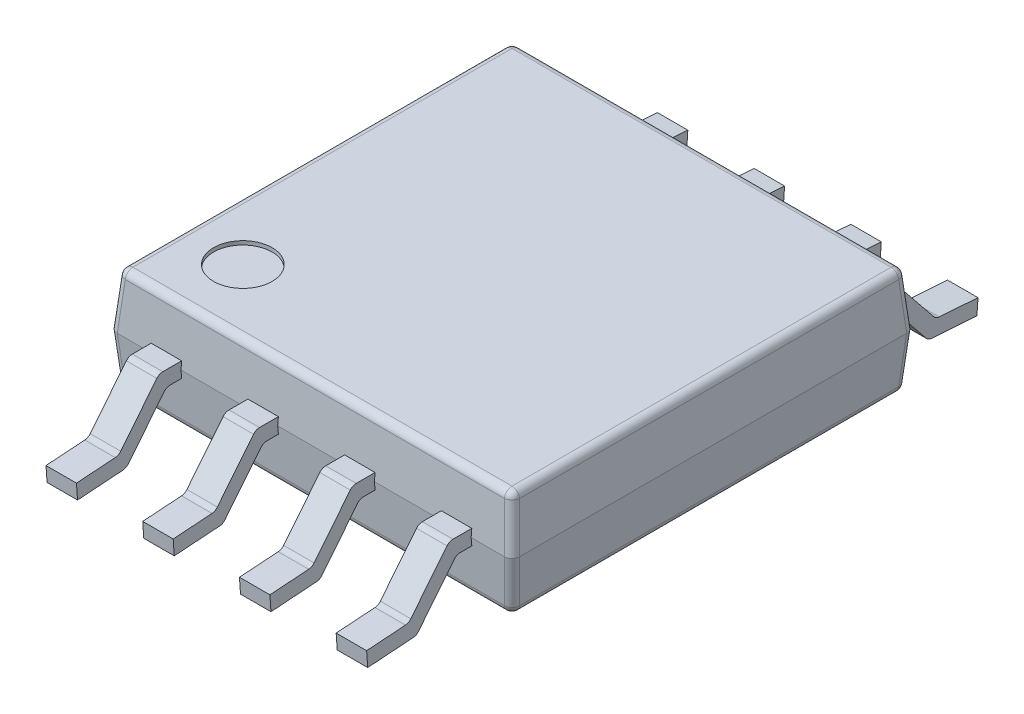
ISO-10303-21;
HEADER;
FILE_DESCRIPTION(('STEP AP214'),'2;1');
FILE_NAME('part.step','',(''),(''),'','','');
FILE_SCHEMA(('AUTOMOTIVE_DESIGN { 1 0 10303 214 1 1 1 1 }'));
ENDSEC;
DATA;
#1=APPLICATION_CONTEXT('core data for automotive mechanical design processes');
#2=APPLICATION_PROTOCOL_DEFINITION('international standard','automotive_design',2000,#1);
#3=PRODUCT_CONTEXT('',#1,'mechanical');
#4=PRODUCT('Part','Part','',(#3));
#5=PRODUCT_RELATED_PRODUCT_CATEGORY('part','',(#4));
#6=PRODUCT_DEFINITION_FORMATION('','',#4);
#7=PRODUCT_DEFINITION_CONTEXT('part definition',#1,'design');
#8=PRODUCT_DEFINITION('design','',#6,#7);
#9=PRODUCT_DEFINITION_SHAPE('','',#8);
#10=(LENGTH_UNIT() NAMED_UNIT(*) SI_UNIT(.MILLI.,.METRE.));
#11=(NAMED_UNIT(*) PLANE_ANGLE_UNIT() SI_UNIT($,.RADIAN.));
#12=(NAMED_UNIT(*) SI_UNIT($,.STERADIAN.) SOLID_ANGLE_UNIT());
#13=UNCERTAINTY_MEASURE_WITH_UNIT(LENGTH_MEASURE(1.E-05),#10,'distance_accuracy_value','');
#14=(GEOMETRIC_REPRESENTATION_CONTEXT(3) GLOBAL_UNCERTAINTY_ASSIGNED_CONTEXT((#13)) GLOBAL_UNIT_ASSIGNED_CONTEXT((#10,
#11,#12)) REPRESENTATION_CONTEXT('',''));
#15=CARTESIAN_POINT('',(0.,0.,0.));
#16=DIRECTION('',(0.,0.,1.));
#17=DIRECTION('',(1.,0.,0.));
#18=AXIS2_PLACEMENT_3D('',#15,#16,#17);
#19=CARTESIAN_POINT('',(-1.797804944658,1.45,1.73628616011));
#20=DIRECTION('',(0.,1.,0.));
#21=DIRECTION('',(1.,0.,0.));
#22=AXIS2_PLACEMENT_3D('',#19,#20,#21);
#23=PLANE('',#22);
#24=CARTESIAN_POINT('',(-1.797804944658,1.45,1.73628616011));
#25=DIRECTION('',(0.,1.,0.));
#26=DIRECTION('',(0.,0.,1.));
#27=AXIS2_PLACEMENT_3D('',#24,#25,#26);
#28=CIRCLE('',#27,0.384387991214);
#29=CARTESIAN_POINT('',(-1.797804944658,1.45,2.120674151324));
#30=VERTEX_POINT('',#29);
#31=EDGE_CURVE('E2193',#30,#30,#28,.T.);
#32=ORIENTED_EDGE('',*,*,#31,.T.);
#33=EDGE_LOOP('',(#32));
#34=FACE_BOUND('',#33,.T.);
#35=ADVANCED_FACE('F17',(#34),#23,.T.);
#36=CARTESIAN_POINT('',(-1.705,0.04475315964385,3.36));
#37=DIRECTION('',(0.,0.626904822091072,0.779095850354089));
#38=DIRECTION('',(1.,0.,0.));
#39=AXIS2_PLACEMENT_3D('',#36,#37,#38);
#40=PLANE('',#39);
#41=DIRECTION('',(0.,0.779095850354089,-0.626904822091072));
#42=VECTOR('',#41,1.);
#43=CARTESIAN_POINT('',(-1.705,0.04475315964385,3.36));
#44=LINE('',#43,#42);
#45=CARTESIAN_POINT('',(-1.705,0.07877310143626,3.332625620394));
#46=VERTEX_POINT('',#45);
#47=CARTESIAN_POINT('',(-1.705,0.662690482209,2.862772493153));
#48=VERTEX_POINT('',#47);
#49=EDGE_CURVE('E1415',#46,#48,#44,.T.);
#50=ORIENTED_EDGE('',*,*,#49,.F.);
#51=DIRECTION('',(-1.,0.,0.));
#52=VECTOR('',#51,1.);
#53=CARTESIAN_POINT('',(-1.705,0.07877310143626,3.332625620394));
#54=LINE('',#53,#52);
#55=CARTESIAN_POINT('',(-2.105,0.07877310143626,3.332625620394));
#56=VERTEX_POINT('',#55);
#57=EDGE_CURVE('E11',#46,#56,#54,.T.);
#58=ORIENTED_EDGE('',*,*,#57,.T.);
#59=DIRECTION('',(0.,0.779095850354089,-0.626904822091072));
#60=VECTOR('',#59,1.);
#61=CARTESIAN_POINT('',(-2.105,0.04475315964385,3.36));
#62=LINE('',#61,#60);
#63=CARTESIAN_POINT('',(-2.105,0.662690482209,2.862772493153));
#64=VERTEX_POINT('',#63);
#65=EDGE_CURVE('E1541',#56,#64,#62,.T.);
#66=ORIENTED_EDGE('',*,*,#65,.T.);
#67=DIRECTION('',(1.,0.,0.));
#68=VECTOR('',#67,1.);
#69=CARTESIAN_POINT('',(-1.705,0.662690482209,2.862772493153));
#70=LINE('',#69,#68);
#71=EDGE_CURVE('E1596',#64,#48,#70,.T.);
#72=ORIENTED_EDGE('',*,*,#71,.T.);
#73=EDGE_LOOP('',(#50,#58,#66,#72));
#74=FACE_BOUND('',#73,.T.);
#75=ADVANCED_FACE('F4464',(#74),#40,.F.);
#76=CARTESIAN_POINT('',(-1.705,0.141463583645,3.41053520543));
#77=DIRECTION('',(-1.,0.,0.));
#78=DIRECTION('',(0.,0.886293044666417,0.463124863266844));
#79=AXIS2_PLACEMENT_3D('',#76,#77,#78);
#80=CYLINDRICAL_SURFACE('',#79,0.1);
#81=CARTESIAN_POINT('',(-1.705,0.141463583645,3.41053520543));
#82=DIRECTION('',(1.,0.,0.));
#83=DIRECTION('',(0.,0.,-1.));
#84=AXIS2_PLACEMENT_3D('',#81,#82,#83);
#85=CIRCLE('',#84,0.1);
#86=CARTESIAN_POINT('',(-1.705,0.04170717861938,3.403559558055));
#87=VERTEX_POINT('',#86);
#88=EDGE_CURVE('E1412',#87,#46,#85,.T.);
#89=ORIENTED_EDGE('',*,*,#88,.F.);
#90=DIRECTION('',(1.,0.,0.));
#91=VECTOR('',#90,1.);
#92=CARTESIAN_POINT('',(-1.705,0.04170717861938,3.403559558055));
#93=LINE('',#92,#91);
#94=CARTESIAN_POINT('',(-2.105,0.04170717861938,3.403559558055));
#95=VERTEX_POINT('',#94);
#96=EDGE_CURVE('E27',#95,#87,#93,.T.);
#97=ORIENTED_EDGE('',*,*,#96,.F.);
#98=CARTESIAN_POINT('',(-2.105,0.141463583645,3.41053520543));
#99=DIRECTION('',(-1.,0.,0.));
#100=DIRECTION('',(0.,0.,-1.));
#101=AXIS2_PLACEMENT_3D('',#98,#99,#100);
#102=CIRCLE('',#101,0.1);
#103=EDGE_CURVE('E1550',#56,#95,#102,.T.);
#104=ORIENTED_EDGE('',*,*,#103,.F.);
#105=ORIENTED_EDGE('',*,*,#57,.F.);
#106=EDGE_LOOP('',(#89,#97,#104,#105));
#107=FACE_BOUND('',#106,.T.);
#108=ADVANCED_FACE('F4469',(#107),#80,.T.);
#109=CARTESIAN_POINT('',(-1.705,0.,4.));
#110=DIRECTION('',(0.,0.997564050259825,0.0697564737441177));
#111=DIRECTION('',(1.,0.,0.));
#112=AXIS2_PLACEMENT_3D('',#109,#110,#111);
#113=PLANE('',#112);
#114=DIRECTION('',(0.,0.0697564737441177,-0.997564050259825));
#115=VECTOR('',#114,1.);
#116=CARTESIAN_POINT('',(-2.105,0.,4.));
#117=LINE('',#116,#115);
#118=CARTESIAN_POINT('',(-2.105,0.,4.));
#119=VERTEX_POINT('',#118);
#120=EDGE_CURVE('E1554',#119,#95,#117,.T.);
#121=ORIENTED_EDGE('',*,*,#120,.T.);
#122=ORIENTED_EDGE('',*,*,#96,.T.);
#123=DIRECTION('',(0.,0.0697564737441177,-0.997564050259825));
#124=VECTOR('',#123,1.);
#125=CARTESIAN_POINT('',(-1.705,0.,4.));
#126=LINE('',#125,#124);
#127=CARTESIAN_POINT('',(-1.705,0.,4.));
#128=VERTEX_POINT('',#127);
#129=EDGE_CURVE('E1410',#128,#87,#126,.T.);
#130=ORIENTED_EDGE('',*,*,#129,.F.);
#131=DIRECTION('',(-1.,0.,0.));
#132=VECTOR('',#131,1.);
#133=CARTESIAN_POINT('',(-1.705,0.,4.));
#134=LINE('',#133,#132);
#135=EDGE_CURVE('E1017',#128,#119,#134,.T.);
#136=ORIENTED_EDGE('',*,*,#135,.T.);
#137=EDGE_LOOP('',(#121,#122,#130,#136));
#138=FACE_BOUND('',#137,.T.);
#139=ADVANCED_FACE('F4847',(#138),#113,.F.);
#140=CARTESIAN_POINT('',(-1.705,0.9,2.928527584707));
#141=DIRECTION('',(0.,-1.,0.));
#142=DIRECTION('',(0.,0.,-1.));
#143=AXIS2_PLACEMENT_3D('',#140,#141,#142);
#144=PLANE('',#143);
#145=DIRECTION('',(0.,0.,1.));
#146=VECTOR('',#145,1.);
#147=CARTESIAN_POINT('',(-2.105,0.9,2.928527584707));
#148=LINE('',#147,#146);
#149=CARTESIAN_POINT('',(-2.105,0.9,2.632751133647));
#150=VERTEX_POINT('',#149);
#151=CARTESIAN_POINT('',(-2.105,0.9,2.880639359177));
#152=VERTEX_POINT('',#151);
#153=EDGE_CURVE('E1597',#150,#152,#148,.T.);
#154=ORIENTED_EDGE('',*,*,#153,.T.);
#155=DIRECTION('',(1.,0.,0.));
#156=VECTOR('',#155,1.);
#157=CARTESIAN_POINT('',(-1.705,0.9,2.880639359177));
#158=LINE('',#157,#156);
#159=CARTESIAN_POINT('',(-1.705,0.9,2.880639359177));
#160=VERTEX_POINT('',#159);
#161=EDGE_CURVE('E1026',#152,#160,#158,.T.);
#162=ORIENTED_EDGE('',*,*,#161,.T.);
#163=DIRECTION('',(0.,0.,1.));
#164=VECTOR('',#163,1.);
#165=CARTESIAN_POINT('',(-1.705,0.9,2.928527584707));
#166=LINE('',#165,#164);
#167=CARTESIAN_POINT('',(-1.705,0.9,2.632751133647));
#168=VERTEX_POINT('',#167);
#169=EDGE_CURVE('E1009',#168,#160,#166,.T.);
#170=ORIENTED_EDGE('',*,*,#169,.F.);
#171=DIRECTION('',(-1.,0.,0.));
#172=VECTOR('',#171,1.);
#173=CARTESIAN_POINT('',(-1.705,0.9,2.632751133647));
#174=LINE('',#173,#172);
#175=EDGE_CURVE('E1465',#168,#150,#174,.T.);
#176=ORIENTED_EDGE('',*,*,#175,.T.);
#177=EDGE_LOOP('',(#154,#162,#170,#176));
#178=FACE_BOUND('',#177,.T.);
#179=ADVANCED_FACE('F4844',(#178),#144,.F.);
#180=CARTESIAN_POINT('',(-1.705,0.8,2.880639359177));
#181=DIRECTION('',(-1.,0.,0.));
#182=DIRECTION('',(0.,-0.901915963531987,-0.431911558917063));
#183=AXIS2_PLACEMENT_3D('',#180,#181,#182);
#184=CYLINDRICAL_SURFACE('',#183,0.1);
#185=CARTESIAN_POINT('',(-1.705,0.8,2.880639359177));
#186=DIRECTION('',(1.,0.,0.));
#187=DIRECTION('',(0.,0.,-1.));
#188=AXIS2_PLACEMENT_3D('',#185,#186,#187);
#189=CIRCLE('',#188,0.1);
#190=CARTESIAN_POINT('',(-1.705,0.862690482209,2.958548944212));
#191=VERTEX_POINT('',#190);
#192=EDGE_CURVE('E1002',#160,#191,#189,.T.);
#193=ORIENTED_EDGE('',*,*,#192,.F.);
#194=ORIENTED_EDGE('',*,*,#161,.F.);
#195=CARTESIAN_POINT('',(-2.105,0.8,2.880639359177));
#196=DIRECTION('',(-1.,0.,0.));
#197=DIRECTION('',(0.,0.,-1.));
#198=AXIS2_PLACEMENT_3D('',#195,#196,#197);
#199=CIRCLE('',#198,0.1);
#200=CARTESIAN_POINT('',(-2.105,0.862690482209,2.958548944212));
#201=VERTEX_POINT('',#200);
#202=EDGE_CURVE('E1601',#201,#152,#199,.T.);
#203=ORIENTED_EDGE('',*,*,#202,.F.);
#204=DIRECTION('',(-1.,0.,0.));
#205=VECTOR('',#204,1.);
#206=CARTESIAN_POINT('',(-1.705,0.862690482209,2.958548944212));
#207=LINE('',#206,#205);
#208=EDGE_CURVE('E970',#191,#201,#207,.T.);
#209=ORIENTED_EDGE('',*,*,#208,.F.);
#210=EDGE_LOOP('',(#193,#194,#203,#209));
#211=FACE_BOUND('',#210,.T.);
#212=ADVANCED_FACE('F4841',(#211),#184,.T.);
#213=CARTESIAN_POINT('',(-1.705,0.238174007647,3.461070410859));
#214=DIRECTION('',(0.,-0.626904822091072,-0.779095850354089));
#215=DIRECTION('',(0.,-0.779095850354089,0.626904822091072));
#216=AXIS2_PLACEMENT_3D('',#213,#214,#215);
#217=PLANE('',#216);
#218=DIRECTION('',(0.,-0.779095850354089,0.626904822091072));
#219=VECTOR('',#218,1.);
#220=CARTESIAN_POINT('',(-2.105,0.238174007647,3.461070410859));
#221=LINE('',#220,#219);
#222=CARTESIAN_POINT('',(-2.105,0.272193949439,3.433696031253));
#223=VERTEX_POINT('',#222);
#224=EDGE_CURVE('E984',#201,#223,#221,.T.);
#225=ORIENTED_EDGE('',*,*,#224,.T.);
#226=DIRECTION('',(1.,0.,0.));
#227=VECTOR('',#226,1.);
#228=CARTESIAN_POINT('',(-1.705,0.272193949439,3.433696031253));
#229=LINE('',#228,#227);
#230=CARTESIAN_POINT('',(-1.705,0.272193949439,3.433696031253));
#231=VERTEX_POINT('',#230);
#232=EDGE_CURVE('E977',#223,#231,#229,.T.);
#233=ORIENTED_EDGE('',*,*,#232,.T.);
#234=DIRECTION('',(0.,-0.779095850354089,0.626904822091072));
#235=VECTOR('',#234,1.);
#236=CARTESIAN_POINT('',(-1.705,0.238174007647,3.461070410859));
#237=LINE('',#236,#235);
#238=EDGE_CURVE('E981',#191,#231,#237,.T.);
#239=ORIENTED_EDGE('',*,*,#238,.F.);
#240=ORIENTED_EDGE('',*,*,#208,.T.);
#241=EDGE_LOOP('',(#225,#233,#239,#240));
#242=FACE_BOUND('',#241,.T.);
#243=ADVANCED_FACE('F979',(#242),#217,.F.);
#244=CARTESIAN_POINT('',(-1.705,0.334884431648,3.511605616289));
#245=DIRECTION('',(1.,0.,0.));
#246=DIRECTION('',(0.,0.886293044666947,0.463124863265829));
#247=AXIS2_PLACEMENT_3D('',#244,#245,#246);
#248=CYLINDRICAL_SURFACE('',#247,0.1);
#249=CARTESIAN_POINT('',(-1.705,0.334884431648,3.511605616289));
#250=DIRECTION('',(-1.,0.,0.));
#251=DIRECTION('',(0.,0.,-1.));
#252=AXIS2_PLACEMENT_3D('',#249,#250,#251);
#253=CIRCLE('',#252,0.1);
#254=CARTESIAN_POINT('',(-1.705,0.235128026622,3.504629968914));
#255=VERTEX_POINT('',#254);
#256=EDGE_CURVE('E992',#231,#255,#253,.T.);
#257=ORIENTED_EDGE('',*,*,#256,.F.);
#258=ORIENTED_EDGE('',*,*,#232,.F.);
#259=CARTESIAN_POINT('',(-2.105,0.334884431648,3.511605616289));
#260=DIRECTION('',(1.,0.,0.));
#261=DIRECTION('',(0.,0.,-1.));
#262=AXIS2_PLACEMENT_3D('',#259,#260,#261);
#263=CIRCLE('',#262,0.1);
#264=CARTESIAN_POINT('',(-2.105,0.235128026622,3.504629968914));
#265=VERTEX_POINT('',#264);
#266=EDGE_CURVE('E1580',#265,#223,#263,.T.);
#267=ORIENTED_EDGE('',*,*,#266,.F.);
#268=DIRECTION('',(-1.,0.,0.));
#269=VECTOR('',#268,1.);
#270=CARTESIAN_POINT('',(-2.105,0.235128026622,3.504629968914));
#271=LINE('',#270,#269);
#272=EDGE_CURVE('E989',#255,#265,#271,.T.);
#273=ORIENTED_EDGE('',*,*,#272,.F.);
#274=EDGE_LOOP('',(#257,#258,#267,#273));
#275=FACE_BOUND('',#274,.T.);
#276=ADVANCED_FACE('F993',(#275),#248,.F.);
#277=CARTESIAN_POINT('',(-1.705,0.199512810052,4.013951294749));
#278=DIRECTION('',(0.,-0.997564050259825,-0.0697564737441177));
#279=DIRECTION('',(0.,0.0697564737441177,-0.997564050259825));
#280=AXIS2_PLACEMENT_3D('',#277,#278,#279);
#281=PLANE('',#280);
#282=DIRECTION('',(0.,-0.0697564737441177,0.997564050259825));
#283=VECTOR('',#282,1.);
#284=CARTESIAN_POINT('',(-1.705,0.199512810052,4.013951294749));
#285=LINE('',#284,#283);
#286=CARTESIAN_POINT('',(-1.705,0.199512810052,4.013951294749));
#287=VERTEX_POINT('',#286);
#288=EDGE_CURVE('E997',#255,#287,#285,.T.);
#289=ORIENTED_EDGE('',*,*,#288,.F.);
#290=ORIENTED_EDGE('',*,*,#272,.T.);
#291=DIRECTION('',(0.,-0.0697564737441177,0.997564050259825));
#292=VECTOR('',#291,1.);
#293=CARTESIAN_POINT('',(-2.105,0.199512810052,4.013951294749));
#294=LINE('',#293,#292);
#295=CARTESIAN_POINT('',(-2.105,0.199512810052,4.013951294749));
#296=VERTEX_POINT('',#295);
#297=EDGE_CURVE('E1577',#265,#296,#294,.T.);
#298=ORIENTED_EDGE('',*,*,#297,.T.);
#299=DIRECTION('',(-1.,0.,0.));
#300=VECTOR('',#299,1.);
#301=CARTESIAN_POINT('',(-1.705,0.199512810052,4.013951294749));
#302=LINE('',#301,#300);
#303=EDGE_CURVE('E42',#287,#296,#302,.T.);
#304=ORIENTED_EDGE('',*,*,#303,.F.);
#305=EDGE_LOOP('',(#289,#290,#298,#304));
#306=FACE_BOUND('',#305,.T.);
#307=ADVANCED_FACE('F4833',(#306),#281,.F.);
#308=CARTESIAN_POINT('',(-1.705,0.199512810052,4.013951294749));
#309=DIRECTION('',(0.,0.0697564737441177,-0.997564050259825));
#310=DIRECTION('',(-1.,0.,0.));
#311=AXIS2_PLACEMENT_3D('',#308,#309,#310);
#312=PLANE('',#311);
#313=DIRECTION('',(0.,-0.997564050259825,-0.0697564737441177));
#314=VECTOR('',#313,1.);
#315=CARTESIAN_POINT('',(-2.105,0.199512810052,4.013951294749));
#316=LINE('',#315,#314);
#317=EDGE_CURVE('E1566',#296,#119,#316,.T.);
#318=ORIENTED_EDGE('',*,*,#317,.T.);
#319=ORIENTED_EDGE('',*,*,#135,.F.);
#320=DIRECTION('',(0.,-0.997564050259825,-0.0697564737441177));
#321=VECTOR('',#320,1.);
#322=CARTESIAN_POINT('',(-1.705,0.199512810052,4.013951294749));
#323=LINE('',#322,#321);
#324=EDGE_CURVE('E1016',#287,#128,#323,.T.);
#325=ORIENTED_EDGE('',*,*,#324,.F.);
#326=ORIENTED_EDGE('',*,*,#303,.T.);
#327=EDGE_LOOP('',(#318,#319,#325,#326));
#328=FACE_BOUND('',#327,.T.);
#329=ADVANCED_FACE('F4830',(#328),#312,.F.);
#330=CARTESIAN_POINT('',(-1.705,0.,0.));
#331=DIRECTION('',(1.,0.,0.));
#332=DIRECTION('',(0.,1.,0.));
#333=AXIS2_PLACEMENT_3D('',#330,#331,#332);
#334=PLANE('',#333);
#335=ORIENTED_EDGE('',*,*,#129,.T.);
#336=ORIENTED_EDGE('',*,*,#88,.T.);
#337=ORIENTED_EDGE('',*,*,#49,.T.);
#338=CARTESIAN_POINT('',(-1.705,0.6,2.784862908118));
#339=DIRECTION('',(-1.,0.,0.));
#340=DIRECTION('',(0.,0.,-1.));
#341=AXIS2_PLACEMENT_3D('',#338,#339,#340);
#342=CIRCLE('',#341,0.1);
#343=CARTESIAN_POINT('',(-1.705,0.7,2.784862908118));
#344=VERTEX_POINT('',#343);
#345=EDGE_CURVE('E1593',#48,#344,#342,.T.);
#346=ORIENTED_EDGE('',*,*,#345,.T.);
#347=DIRECTION('',(0.,0.,-1.));
#348=VECTOR('',#347,1.);
#349=CARTESIAN_POINT('',(-1.705,0.7,2.832751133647));
#350=LINE('',#349,#348);
#351=CARTESIAN_POINT('',(-1.705,0.7,2.632751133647));
#352=VERTEX_POINT('',#351);
#353=EDGE_CURVE('E1613',#344,#352,#350,.T.);
#354=ORIENTED_EDGE('',*,*,#353,.T.);
#355=DIRECTION('',(0.,0.996194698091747,0.0871557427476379));
#356=VECTOR('',#355,1.);
#357=CARTESIAN_POINT('',(-1.705,0.8,2.6415));
#358=LINE('',#357,#356);
#359=CARTESIAN_POINT('',(-1.705,0.8,2.6415));
#360=VERTEX_POINT('',#359);
#361=EDGE_CURVE('E1065',#352,#360,#358,.T.);
#362=ORIENTED_EDGE('',*,*,#361,.T.);
#363=DIRECTION('',(0.,-0.996194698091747,0.0871557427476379));
#364=VECTOR('',#363,1.);
#365=CARTESIAN_POINT('',(-1.705,0.8,2.6415));
#366=LINE('',#365,#364);
#367=EDGE_CURVE('E1460',#168,#360,#366,.T.);
#368=ORIENTED_EDGE('',*,*,#367,.F.);
#369=ORIENTED_EDGE('',*,*,#169,.T.);
#370=ORIENTED_EDGE('',*,*,#192,.T.);
#371=ORIENTED_EDGE('',*,*,#238,.T.);
#372=ORIENTED_EDGE('',*,*,#256,.T.);
#373=ORIENTED_EDGE('',*,*,#288,.T.);
#374=ORIENTED_EDGE('',*,*,#324,.T.);
#375=EDGE_LOOP('',(#335,#336,#337,#346,#354,#362,#368,#369,#370,#371,#372,#373,#374));
#376=FACE_BOUND('',#375,.T.);
#377=ADVANCED_FACE('F1000',(#376),#334,.T.);
#378=CARTESIAN_POINT('',(-0.435,0.199512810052,-4.013951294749));
#379=DIRECTION('',(0.,0.997564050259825,-0.0697564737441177));
#380=DIRECTION('',(-1.,0.,0.));
#381=AXIS2_PLACEMENT_3D('',#378,#379,#380);
#382=PLANE('',#381);
#383=DIRECTION('',(0.,-0.0697564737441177,-0.997564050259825));
#384=VECTOR('',#383,1.);
#385=CARTESIAN_POINT('',(-0.835,0.199512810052,-4.013951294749));
#386=LINE('',#385,#384);
#387=CARTESIAN_POINT('',(-0.835,0.235128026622,-3.504629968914));
#388=VERTEX_POINT('',#387);
#389=CARTESIAN_POINT('',(-0.835,0.199512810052,-4.013951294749));
#390=VERTEX_POINT('',#389);
#391=EDGE_CURVE('E2022',#388,#390,#386,.T.);
#392=ORIENTED_EDGE('',*,*,#391,.F.);
#393=DIRECTION('',(1.,0.,0.));
#394=VECTOR('',#393,1.);
#395=CARTESIAN_POINT('',(-0.435,0.235128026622,-3.504629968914));
#396=LINE('',#395,#394);
#397=CARTESIAN_POINT('',(-0.435,0.235128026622,-3.504629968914));
#398=VERTEX_POINT('',#397);
#399=EDGE_CURVE('E1213',#388,#398,#396,.T.);
#400=ORIENTED_EDGE('',*,*,#399,.T.);
#401=DIRECTION('',(0.,-0.0697564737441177,-0.997564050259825));
#402=VECTOR('',#401,1.);
#403=CARTESIAN_POINT('',(-0.435,0.199512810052,-4.013951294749));
#404=LINE('',#403,#402);
#405=CARTESIAN_POINT('',(-0.435,0.199512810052,-4.013951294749));
#406=VERTEX_POINT('',#405);
#407=EDGE_CURVE('E1389',#398,#406,#404,.T.);
#408=ORIENTED_EDGE('',*,*,#407,.T.);
#409=DIRECTION('',(-1.,0.,0.));
#410=VECTOR('',#409,1.);
#411=CARTESIAN_POINT('',(-0.435,0.199512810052,-4.013951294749));
#412=LINE('',#411,#410);
#413=EDGE_CURVE('E1991',#406,#390,#412,.T.);
#414=ORIENTED_EDGE('',*,*,#413,.T.);
#415=EDGE_LOOP('',(#392,#400,#408,#414));
#416=FACE_BOUND('',#415,.T.);
#417=ADVANCED_FACE('F4823',(#416),#382,.T.);
#418=CARTESIAN_POINT('',(-0.435,0.334884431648,-3.511605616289));
#419=DIRECTION('',(1.,0.,0.));
#420=DIRECTION('',(0.,0.886293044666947,-0.46312486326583));
#421=AXIS2_PLACEMENT_3D('',#418,#419,#420);
#422=CYLINDRICAL_SURFACE('',#421,0.1);
#423=CARTESIAN_POINT('',(-0.435,0.334884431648,-3.511605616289));
#424=DIRECTION('',(-1.,0.,0.));
#425=DIRECTION('',(0.,0.,-1.));
#426=AXIS2_PLACEMENT_3D('',#423,#424,#425);
#427=CIRCLE('',#426,0.1);
#428=CARTESIAN_POINT('',(-0.435,0.272193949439,-3.433696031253));
#429=VERTEX_POINT('',#428);
#430=EDGE_CURVE('E1392',#398,#429,#427,.T.);
#431=ORIENTED_EDGE('',*,*,#430,.F.);
#432=ORIENTED_EDGE('',*,*,#399,.F.);
#433=CARTESIAN_POINT('',(-0.835,0.334884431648,-3.511605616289));
#434=DIRECTION('',(1.,0.,0.));
#435=DIRECTION('',(0.,0.,-1.));
#436=AXIS2_PLACEMENT_3D('',#433,#434,#435);
#437=CIRCLE('',#436,0.1);
#438=CARTESIAN_POINT('',(-0.835,0.272193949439,-3.433696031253));
#439=VERTEX_POINT('',#438);
#440=EDGE_CURVE('E2017',#439,#388,#437,.T.);
#441=ORIENTED_EDGE('',*,*,#440,.F.);
#442=DIRECTION('',(-1.,0.,0.));
#443=VECTOR('',#442,1.);
#444=CARTESIAN_POINT('',(-0.835,0.272193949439,-3.433696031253));
#445=LINE('',#444,#443);
#446=EDGE_CURVE('E1210',#429,#439,#445,.T.);
#447=ORIENTED_EDGE('',*,*,#446,.F.);
#448=EDGE_LOOP('',(#431,#432,#441,#447));
#449=FACE_BOUND('',#448,.T.);
#450=ADVANCED_FACE('F4819',(#449),#422,.F.);
#451=CARTESIAN_POINT('',(-0.435,0.238174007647,-3.461070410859));
#452=DIRECTION('',(0.,0.626904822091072,-0.779095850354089));
#453=DIRECTION('',(-1.,0.,0.));
#454=AXIS2_PLACEMENT_3D('',#451,#452,#453);
#455=PLANE('',#454);
#456=DIRECTION('',(0.,-0.779095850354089,-0.626904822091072));
#457=VECTOR('',#456,1.);
#458=CARTESIAN_POINT('',(-0.435,0.238174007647,-3.461070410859));
#459=LINE('',#458,#457);
#460=CARTESIAN_POINT('',(-0.435,0.862690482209,-2.958548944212));
#461=VERTEX_POINT('',#460);
#462=EDGE_CURVE('E1396',#461,#429,#459,.T.);
#463=ORIENTED_EDGE('',*,*,#462,.T.);
#464=ORIENTED_EDGE('',*,*,#446,.T.);
#465=DIRECTION('',(0.,-0.779095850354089,-0.626904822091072));
#466=VECTOR('',#465,1.);
#467=CARTESIAN_POINT('',(-0.835,0.238174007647,-3.461070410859));
#468=LINE('',#467,#466);
#469=CARTESIAN_POINT('',(-0.835,0.862690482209,-2.958548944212));
#470=VERTEX_POINT('',#469);
#471=EDGE_CURVE('E2014',#470,#439,#468,.T.);
#472=ORIENTED_EDGE('',*,*,#471,.F.);
#473=DIRECTION('',(1.,0.,0.));
#474=VECTOR('',#473,1.);
#475=CARTESIAN_POINT('',(-0.435,0.862690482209,-2.958548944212));
#476=LINE('',#475,#474);
#477=EDGE_CURVE('E1214',#470,#461,#476,.T.);
#478=ORIENTED_EDGE('',*,*,#477,.T.);
#479=EDGE_LOOP('',(#463,#464,#472,#478));
#480=FACE_BOUND('',#479,.T.);
#481=ADVANCED_FACE('F4815',(#480),#455,.T.);
#482=CARTESIAN_POINT('',(-0.435,0.8,-2.880639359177));
#483=DIRECTION('',(-1.,0.,0.));
#484=DIRECTION('',(0.,-0.901915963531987,0.431911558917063));
#485=AXIS2_PLACEMENT_3D('',#482,#483,#484);
#486=CYLINDRICAL_SURFACE('',#485,0.1);
#487=CARTESIAN_POINT('',(-0.435,0.8,-2.880639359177));
#488=DIRECTION('',(1.,0.,0.));
#489=DIRECTION('',(0.,0.,-1.));
#490=AXIS2_PLACEMENT_3D('',#487,#488,#489);
#491=CIRCLE('',#490,0.1);
#492=CARTESIAN_POINT('',(-0.435,0.9,-2.880639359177));
#493=VERTEX_POINT('',#492);
#494=EDGE_CURVE('E1400',#461,#493,#491,.T.);
#495=ORIENTED_EDGE('',*,*,#494,.F.);
#496=ORIENTED_EDGE('',*,*,#477,.F.);
#497=CARTESIAN_POINT('',(-0.835,0.8,-2.880639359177));
#498=DIRECTION('',(-1.,0.,0.));
#499=DIRECTION('',(0.,0.,-1.));
#500=AXIS2_PLACEMENT_3D('',#497,#498,#499);
#501=CIRCLE('',#500,0.1);
#502=CARTESIAN_POINT('',(-0.835,0.9,-2.880639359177));
#503=VERTEX_POINT('',#502);
#504=EDGE_CURVE('E2010',#503,#470,#501,.T.);
#505=ORIENTED_EDGE('',*,*,#504,.F.);
#506=DIRECTION('',(-1.,0.,0.));
#507=VECTOR('',#506,1.);
#508=CARTESIAN_POINT('',(-0.435,0.9,-2.880639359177));
#509=LINE('',#508,#507);
#510=EDGE_CURVE('E1405',#493,#503,#509,.T.);
#511=ORIENTED_EDGE('',*,*,#510,.F.);
#512=EDGE_LOOP('',(#495,#496,#505,#511));
#513=FACE_BOUND('',#512,.T.);
#514=ADVANCED_FACE('F4812',(#513),#486,.T.);
#515=CARTESIAN_POINT('',(-0.435,0.9,-2.928527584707));
#516=DIRECTION('',(0.,1.,0.));
#517=DIRECTION('',(0.,0.,-1.));
#518=AXIS2_PLACEMENT_3D('',#515,#516,#517);
#519=PLANE('',#518);
#520=DIRECTION('',(0.,0.,-1.));
#521=VECTOR('',#520,1.);
#522=CARTESIAN_POINT('',(-0.435,0.9,-2.928527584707));
#523=LINE('',#522,#521);
#524=CARTESIAN_POINT('',(-0.435,0.9,-2.632751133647));
#525=VERTEX_POINT('',#524);
#526=EDGE_CURVE('E1401',#525,#493,#523,.T.);
#527=ORIENTED_EDGE('',*,*,#526,.T.);
#528=ORIENTED_EDGE('',*,*,#510,.T.);
#529=DIRECTION('',(0.,0.,-1.));
#530=VECTOR('',#529,1.);
#531=CARTESIAN_POINT('',(-0.835,0.9,-2.928527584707));
#532=LINE('',#531,#530);
#533=CARTESIAN_POINT('',(-0.835,0.9,-2.632751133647));
#534=VERTEX_POINT('',#533);
#535=EDGE_CURVE('E2006',#534,#503,#532,.T.);
#536=ORIENTED_EDGE('',*,*,#535,.F.);
#537=DIRECTION('',(-1.,0.,0.));
#538=VECTOR('',#537,1.);
#539=CARTESIAN_POINT('',(-0.435,0.9,-2.632751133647));
#540=LINE('',#539,#538);
#541=EDGE_CURVE('E1978',#525,#534,#540,.T.);
#542=ORIENTED_EDGE('',*,*,#541,.F.);
#543=EDGE_LOOP('',(#527,#528,#536,#542));
#544=FACE_BOUND('',#543,.T.);
#545=ADVANCED_FACE('F2502',(#544),#519,.T.);
#546=CARTESIAN_POINT('',(-0.435,0.,0.));
#547=DIRECTION('',(1.,0.,0.));
#548=DIRECTION('',(0.,1.,0.));
#549=AXIS2_PLACEMENT_3D('',#546,#547,#548);
#550=PLANE('',#549);
#551=DIRECTION('',(0.,0.779095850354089,0.626904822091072));
#552=VECTOR('',#551,1.);
#553=CARTESIAN_POINT('',(-0.435,0.04475315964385,-3.36));
#554=LINE('',#553,#552);
#555=CARTESIAN_POINT('',(-0.435,0.07877310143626,-3.332625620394));
#556=VERTEX_POINT('',#555);
#557=CARTESIAN_POINT('',(-0.435,0.662690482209,-2.862772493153));
#558=VERTEX_POINT('',#557);
#559=EDGE_CURVE('E2051',#556,#558,#554,.T.);
#560=ORIENTED_EDGE('',*,*,#559,.F.);
#561=CARTESIAN_POINT('',(-0.435,0.141463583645,-3.41053520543));
#562=DIRECTION('',(1.,0.,0.));
#563=DIRECTION('',(0.,0.,-1.));
#564=AXIS2_PLACEMENT_3D('',#561,#562,#563);
#565=CIRCLE('',#564,0.1);
#566=CARTESIAN_POINT('',(-0.435,0.04170717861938,-3.403559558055));
#567=VERTEX_POINT('',#566);
#568=EDGE_CURVE('E2044',#556,#567,#565,.T.);
#569=ORIENTED_EDGE('',*,*,#568,.T.);
#570=DIRECTION('',(0.,0.0697564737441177,0.997564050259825));
#571=VECTOR('',#570,1.);
#572=CARTESIAN_POINT('',(-0.435,0.,-4.));
#573=LINE('',#572,#571);
#574=CARTESIAN_POINT('',(-0.435,0.,-4.));
#575=VERTEX_POINT('',#574);
#576=EDGE_CURVE('E2037',#575,#567,#573,.T.);
#577=ORIENTED_EDGE('',*,*,#576,.F.);
#578=DIRECTION('',(0.,-0.997564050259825,0.0697564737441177));
#579=VECTOR('',#578,1.);
#580=CARTESIAN_POINT('',(-0.435,0.199512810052,-4.013951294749));
#581=LINE('',#580,#579);
#582=EDGE_CURVE('E1994',#406,#575,#581,.T.);
#583=ORIENTED_EDGE('',*,*,#582,.F.);
#584=ORIENTED_EDGE('',*,*,#407,.F.);
#585=ORIENTED_EDGE('',*,*,#430,.T.);
#586=ORIENTED_EDGE('',*,*,#462,.F.);
#587=ORIENTED_EDGE('',*,*,#494,.T.);
#588=ORIENTED_EDGE('',*,*,#526,.F.);
#589=DIRECTION('',(0.,0.996194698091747,0.0871557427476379));
#590=VECTOR('',#589,1.);
#591=CARTESIAN_POINT('',(-0.435,0.8,-2.6415));
#592=LINE('',#591,#590);
#593=CARTESIAN_POINT('',(-0.435,0.8,-2.6415));
#594=VERTEX_POINT('',#593);
#595=EDGE_CURVE('E1974',#594,#525,#592,.T.);
#596=ORIENTED_EDGE('',*,*,#595,.F.);
#597=DIRECTION('',(0.,-0.996194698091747,0.0871557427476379));
#598=VECTOR('',#597,1.);
#599=CARTESIAN_POINT('',(-0.435,0.8,-2.6415));
#600=LINE('',#599,#598);
#601=CARTESIAN_POINT('',(-0.435,0.7,-2.632751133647));
#602=VERTEX_POINT('',#601);
#603=EDGE_CURVE('E2078',#594,#602,#600,.T.);
#604=ORIENTED_EDGE('',*,*,#603,.T.);
#605=DIRECTION('',(0.,0.,1.));
#606=VECTOR('',#605,1.);
#607=CARTESIAN_POINT('',(-0.435,0.7,-2.832751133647));
#608=LINE('',#607,#606);
#609=CARTESIAN_POINT('',(-0.435,0.7,-2.784862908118));
#610=VERTEX_POINT('',#609);
#611=EDGE_CURVE('E2065',#610,#602,#608,.T.);
#612=ORIENTED_EDGE('',*,*,#611,.F.);
#613=CARTESIAN_POINT('',(-0.435,0.6,-2.784862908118));
#614=DIRECTION('',(-1.,0.,0.));
#615=DIRECTION('',(0.,0.,-1.));
#616=AXIS2_PLACEMENT_3D('',#613,#614,#615);
#617=CIRCLE('',#616,0.1);
#618=EDGE_CURVE('E2058',#610,#558,#617,.T.);
#619=ORIENTED_EDGE('',*,*,#618,.T.);
#620=EDGE_LOOP('',(#560,#569,#577,#583,#584,#585,#586,#587,#588,#596,#604,#612,#619));
#621=FACE_BOUND('',#620,.T.);
#622=ADVANCED_FACE('F2496',(#621),#550,.T.);
#623=CARTESIAN_POINT('',(0.835,0.7,-2.832751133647));
#624=DIRECTION('',(0.,-1.,0.));
#625=DIRECTION('',(0.,0.,-1.));
#626=AXIS2_PLACEMENT_3D('',#623,#624,#625);
#627=PLANE('',#626);
#628=DIRECTION('',(0.,0.,1.));
#629=VECTOR('',#628,1.);
#630=CARTESIAN_POINT('',(0.435,0.7,-2.832751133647));
#631=LINE('',#630,#629);
#632=CARTESIAN_POINT('',(0.435,0.7,-2.784862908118));
#633=VERTEX_POINT('',#632);
#634=CARTESIAN_POINT('',(0.435,0.7,-2.632751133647));
#635=VERTEX_POINT('',#634);
#636=EDGE_CURVE('E1386',#633,#635,#631,.T.);
#637=ORIENTED_EDGE('',*,*,#636,.F.);
#638=DIRECTION('',(1.,0.,0.));
#639=VECTOR('',#638,1.);
#640=CARTESIAN_POINT('',(0.835,0.7,-2.784862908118));
#641=LINE('',#640,#639);
#642=CARTESIAN_POINT('',(0.835,0.7,-2.784862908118));
#643=VERTEX_POINT('',#642);
#644=EDGE_CURVE('E1330',#633,#643,#641,.T.);
#645=ORIENTED_EDGE('',*,*,#644,.T.);
#646=DIRECTION('',(0.,0.,1.));
#647=VECTOR('',#646,1.);
#648=CARTESIAN_POINT('',(0.835,0.7,-2.832751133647));
#649=LINE('',#648,#647);
#650=CARTESIAN_POINT('',(0.835,0.7,-2.632751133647));
#651=VERTEX_POINT('',#650);
#652=EDGE_CURVE('E1323',#643,#651,#649,.T.);
#653=ORIENTED_EDGE('',*,*,#652,.T.);
#654=DIRECTION('',(-1.,0.,0.));
#655=VECTOR('',#654,1.);
#656=CARTESIAN_POINT('',(0.835,0.7,-2.632751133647));
#657=LINE('',#656,#655);
#658=EDGE_CURVE('E2083',#651,#635,#657,.T.);
#659=ORIENTED_EDGE('',*,*,#658,.T.);
#660=EDGE_LOOP('',(#637,#645,#653,#659));
#661=FACE_BOUND('',#660,.T.);
#662=ADVANCED_FACE('F4802',(#661),#627,.T.);
#663=CARTESIAN_POINT('',(0.435,0.,0.));
#664=DIRECTION('',(1.,0.,0.));
#665=DIRECTION('',(0.,1.,0.));
#666=AXIS2_PLACEMENT_3D('',#663,#664,#665);
#667=PLANE('',#666);
#668=DIRECTION('',(0.,0.0697564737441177,0.997564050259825));
#669=VECTOR('',#668,1.);
#670=CARTESIAN_POINT('',(0.435,0.,-4.));
#671=LINE('',#670,#669);
#672=CARTESIAN_POINT('',(0.435,0.,-4.));
#673=VERTEX_POINT('',#672);
#674=CARTESIAN_POINT('',(0.435,0.04170717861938,-3.403559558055));
#675=VERTEX_POINT('',#674);
#676=EDGE_CURVE('E1293',#673,#675,#671,.T.);
#677=ORIENTED_EDGE('',*,*,#676,.T.);
#678=CARTESIAN_POINT('',(0.435,0.141463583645,-3.41053520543));
#679=DIRECTION('',(-1.,0.,0.));
#680=DIRECTION('',(0.,0.,-1.));
#681=AXIS2_PLACEMENT_3D('',#678,#679,#680);
#682=CIRCLE('',#681,0.1);
#683=CARTESIAN_POINT('',(0.435,0.07877310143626,-3.332625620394));
#684=VERTEX_POINT('',#683);
#685=EDGE_CURVE('E1294',#675,#684,#682,.T.);
#686=ORIENTED_EDGE('',*,*,#685,.T.);
#687=DIRECTION('',(0.,0.779095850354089,0.626904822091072));
#688=VECTOR('',#687,1.);
#689=CARTESIAN_POINT('',(0.435,0.04475315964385,-3.36));
#690=LINE('',#689,#688);
#691=CARTESIAN_POINT('',(0.435,0.662690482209,-2.862772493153));
#692=VERTEX_POINT('',#691);
#693=EDGE_CURVE('E1336',#684,#692,#690,.T.);
#694=ORIENTED_EDGE('',*,*,#693,.T.);
#695=CARTESIAN_POINT('',(0.435,0.6,-2.784862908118));
#696=DIRECTION('',(1.,0.,0.));
#697=DIRECTION('',(0.,0.,-1.));
#698=AXIS2_PLACEMENT_3D('',#695,#696,#697);
#699=CIRCLE('',#698,0.1);
#700=EDGE_CURVE('E1331',#692,#633,#699,.T.);
#701=ORIENTED_EDGE('',*,*,#700,.T.);
#702=ORIENTED_EDGE('',*,*,#636,.T.);
#703=DIRECTION('',(0.,-0.996194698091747,0.0871557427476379));
#704=VECTOR('',#703,1.);
#705=CARTESIAN_POINT('',(0.435,0.8,-2.6415));
#706=LINE('',#705,#704);
#707=CARTESIAN_POINT('',(0.435,0.8,-2.6415));
#708=VERTEX_POINT('',#707);
#709=EDGE_CURVE('E2079',#708,#635,#706,.T.);
#710=ORIENTED_EDGE('',*,*,#709,.F.);
#711=DIRECTION('',(0.,0.996194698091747,0.0871557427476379));
#712=VECTOR('',#711,1.);
#713=CARTESIAN_POINT('',(0.435,0.8,-2.6415));
#714=LINE('',#713,#712);
#715=CARTESIAN_POINT('',(0.435,0.9,-2.632751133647));
#716=VERTEX_POINT('',#715);
#717=EDGE_CURVE('E1966',#708,#716,#714,.T.);
#718=ORIENTED_EDGE('',*,*,#717,.T.);
#719=DIRECTION('',(0.,0.,-1.));
#720=VECTOR('',#719,1.);
#721=CARTESIAN_POINT('',(0.435,0.9,-2.928527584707));
#722=LINE('',#721,#720);
#723=CARTESIAN_POINT('',(0.435,0.9,-2.880639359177));
#724=VERTEX_POINT('',#723);
#725=EDGE_CURVE('E1383',#716,#724,#722,.T.);
#726=ORIENTED_EDGE('',*,*,#725,.T.);
#727=CARTESIAN_POINT('',(0.435,0.8,-2.880639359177));
#728=DIRECTION('',(-1.,0.,0.));
#729=DIRECTION('',(0.,0.,-1.));
#730=AXIS2_PLACEMENT_3D('',#727,#728,#729);
#731=CIRCLE('',#730,0.1);
#732=CARTESIAN_POINT('',(0.435,0.862690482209,-2.958548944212));
#733=VERTEX_POINT('',#732);
#734=EDGE_CURVE('E1376',#724,#733,#731,.T.);
#735=ORIENTED_EDGE('',*,*,#734,.T.);
#736=DIRECTION('',(0.,-0.779095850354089,-0.626904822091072));
#737=VECTOR('',#736,1.);
#738=CARTESIAN_POINT('',(0.435,0.238174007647,-3.461070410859));
#739=LINE('',#738,#737);
#740=CARTESIAN_POINT('',(0.435,0.272193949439,-3.433696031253));
#741=VERTEX_POINT('',#740);
#742=EDGE_CURVE('E1370',#733,#741,#739,.T.);
#743=ORIENTED_EDGE('',*,*,#742,.T.);
#744=CARTESIAN_POINT('',(0.435,0.334884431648,-3.511605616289));
#745=DIRECTION('',(1.,0.,0.));
#746=DIRECTION('',(0.,0.,-1.));
#747=AXIS2_PLACEMENT_3D('',#744,#745,#746);
#748=CIRCLE('',#747,0.1);
#749=CARTESIAN_POINT('',(0.435,0.235128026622,-3.504629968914));
#750=VERTEX_POINT('',#749);
#751=EDGE_CURVE('E1363',#741,#750,#748,.T.);
#752=ORIENTED_EDGE('',*,*,#751,.T.);
#753=DIRECTION('',(0.,-0.0697564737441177,-0.997564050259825));
#754=VECTOR('',#753,1.);
#755=CARTESIAN_POINT('',(0.435,0.199512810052,-4.013951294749));
#756=LINE('',#755,#754);
#757=CARTESIAN_POINT('',(0.435,0.199512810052,-4.013951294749));
#758=VERTEX_POINT('',#757);
#759=EDGE_CURVE('E1357',#750,#758,#756,.T.);
#760=ORIENTED_EDGE('',*,*,#759,.T.);
#761=DIRECTION('',(0.,-0.997564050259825,0.0697564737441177));
#762=VECTOR('',#761,1.);
#763=CARTESIAN_POINT('',(0.435,0.199512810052,-4.013951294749));
#764=LINE('',#763,#762);
#765=EDGE_CURVE('E1350',#758,#673,#764,.T.);
#766=ORIENTED_EDGE('',*,*,#765,.T.);
#767=EDGE_LOOP('',(#677,#686,#694,#701,#702,#710,#718,#726,#735,#743,#752,#760,#766));
#768=FACE_BOUND('',#767,.T.);
#769=ADVANCED_FACE('F2491',(#768),#667,.F.);
#770=CARTESIAN_POINT('',(0.835,0.9,-2.928527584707));
#771=DIRECTION('',(0.,1.,0.));
#772=DIRECTION('',(0.,0.,-1.));
#773=AXIS2_PLACEMENT_3D('',#770,#771,#772);
#774=PLANE('',#773);
#775=DIRECTION('',(0.,0.,-1.));
#776=VECTOR('',#775,1.);
#777=CARTESIAN_POINT('',(0.835,0.9,-2.928527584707));
#778=LINE('',#777,#776);
#779=CARTESIAN_POINT('',(0.835,0.9,-2.632751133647));
#780=VERTEX_POINT('',#779);
#781=CARTESIAN_POINT('',(0.835,0.9,-2.880639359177));
#782=VERTEX_POINT('',#781);
#783=EDGE_CURVE('E1322',#780,#782,#778,.T.);
#784=ORIENTED_EDGE('',*,*,#783,.T.);
#785=DIRECTION('',(-1.,0.,0.));
#786=VECTOR('',#785,1.);
#787=CARTESIAN_POINT('',(0.835,0.9,-2.880639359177));
#788=LINE('',#787,#786);
#789=EDGE_CURVE('E1379',#782,#724,#788,.T.);
#790=ORIENTED_EDGE('',*,*,#789,.T.);
#791=ORIENTED_EDGE('',*,*,#725,.F.);
#792=DIRECTION('',(-1.,0.,0.));
#793=VECTOR('',#792,1.);
#794=CARTESIAN_POINT('',(0.835,0.9,-2.632751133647));
#795=LINE('',#794,#793);
#796=EDGE_CURVE('E1962',#780,#716,#795,.T.);
#797=ORIENTED_EDGE('',*,*,#796,.F.);
#798=EDGE_LOOP('',(#784,#790,#791,#797));
#799=FACE_BOUND('',#798,.T.);
#800=ADVANCED_FACE('F2488',(#799),#774,.T.);
#801=CARTESIAN_POINT('',(0.835,0.8,-2.880639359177));
#802=DIRECTION('',(-1.,0.,0.));
#803=DIRECTION('',(0.,-0.901915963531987,0.431911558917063));
#804=AXIS2_PLACEMENT_3D('',#801,#802,#803);
#805=CYLINDRICAL_SURFACE('',#804,0.1);
#806=CARTESIAN_POINT('',(0.835,0.8,-2.880639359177));
#807=DIRECTION('',(1.,0.,0.));
#808=DIRECTION('',(0.,0.,-1.));
#809=AXIS2_PLACEMENT_3D('',#806,#807,#808);
#810=CIRCLE('',#809,0.1);
#811=CARTESIAN_POINT('',(0.835,0.862690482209,-2.958548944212));
#812=VERTEX_POINT('',#811);
#813=EDGE_CURVE('E1318',#812,#782,#810,.T.);
#814=ORIENTED_EDGE('',*,*,#813,.F.);
#815=DIRECTION('',(1.,0.,0.));
#816=VECTOR('',#815,1.);
#817=CARTESIAN_POINT('',(0.835,0.862690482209,-2.958548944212));
#818=LINE('',#817,#816);
#819=EDGE_CURVE('E1373',#733,#812,#818,.T.);
#820=ORIENTED_EDGE('',*,*,#819,.F.);
#821=ORIENTED_EDGE('',*,*,#734,.F.);
#822=ORIENTED_EDGE('',*,*,#789,.F.);
#823=EDGE_LOOP('',(#814,#820,#821,#822));
#824=FACE_BOUND('',#823,.T.);
#825=ADVANCED_FACE('F4792',(#824),#805,.T.);
#826=CARTESIAN_POINT('',(0.835,0.238174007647,-3.461070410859));
#827=DIRECTION('',(0.,0.626904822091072,-0.779095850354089));
#828=DIRECTION('',(-1.,0.,0.));
#829=AXIS2_PLACEMENT_3D('',#826,#827,#828);
#830=PLANE('',#829);
#831=DIRECTION('',(0.,-0.779095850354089,-0.626904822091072));
#832=VECTOR('',#831,1.);
#833=CARTESIAN_POINT('',(0.835,0.238174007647,-3.461070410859));
#834=LINE('',#833,#832);
#835=CARTESIAN_POINT('',(0.835,0.272193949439,-3.433696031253));
#836=VERTEX_POINT('',#835);
#837=EDGE_CURVE('E1314',#812,#836,#834,.T.);
#838=ORIENTED_EDGE('',*,*,#837,.T.);
#839=DIRECTION('',(-1.,0.,0.));
#840=VECTOR('',#839,1.);
#841=CARTESIAN_POINT('',(0.435,0.272193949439,-3.433696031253));
#842=LINE('',#841,#840);
#843=EDGE_CURVE('E1366',#836,#741,#842,.T.);
#844=ORIENTED_EDGE('',*,*,#843,.T.);
#845=ORIENTED_EDGE('',*,*,#742,.F.);
#846=ORIENTED_EDGE('',*,*,#819,.T.);
#847=EDGE_LOOP('',(#838,#844,#845,#846));
#848=FACE_BOUND('',#847,.T.);
#849=ADVANCED_FACE('F4687',(#848),#830,.T.);
#850=CARTESIAN_POINT('',(0.835,0.334884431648,-3.511605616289));
#851=DIRECTION('',(1.,0.,0.));
#852=DIRECTION('',(0.,0.886293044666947,-0.46312486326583));
#853=AXIS2_PLACEMENT_3D('',#850,#851,#852);
#854=CYLINDRICAL_SURFACE('',#853,0.1);
#855=CARTESIAN_POINT('',(0.835,0.334884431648,-3.511605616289));
#856=DIRECTION('',(-1.,0.,0.));
#857=DIRECTION('',(0.,0.,-1.));
#858=AXIS2_PLACEMENT_3D('',#855,#856,#857);
#859=CIRCLE('',#858,0.1);
#860=CARTESIAN_POINT('',(0.835,0.235128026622,-3.504629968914));
#861=VERTEX_POINT('',#860);
#862=EDGE_CURVE('E1310',#861,#836,#859,.T.);
#863=ORIENTED_EDGE('',*,*,#862,.F.);
#864=DIRECTION('',(1.,0.,0.));
#865=VECTOR('',#864,1.);
#866=CARTESIAN_POINT('',(0.835,0.235128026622,-3.504629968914));
#867=LINE('',#866,#865);
#868=EDGE_CURVE('E1360',#750,#861,#867,.T.);
#869=ORIENTED_EDGE('',*,*,#868,.F.);
#870=ORIENTED_EDGE('',*,*,#751,.F.);
#871=ORIENTED_EDGE('',*,*,#843,.F.);
#872=EDGE_LOOP('',(#863,#869,#870,#871));
#873=FACE_BOUND('',#872,.T.);
#874=ADVANCED_FACE('F4521',(#873),#854,.F.);
#875=CARTESIAN_POINT('',(0.835,0.199512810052,-4.013951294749));
#876=DIRECTION('',(0.,0.997564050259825,-0.0697564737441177));
#877=DIRECTION('',(-1.,0.,0.));
#878=AXIS2_PLACEMENT_3D('',#875,#876,#877);
#879=PLANE('',#878);
#880=ORIENTED_EDGE('',*,*,#759,.F.);
#881=ORIENTED_EDGE('',*,*,#868,.T.);
#882=DIRECTION('',(0.,-0.0697564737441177,-0.997564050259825));
#883=VECTOR('',#882,1.);
#884=CARTESIAN_POINT('',(0.835,0.199512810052,-4.013951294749));
#885=LINE('',#884,#883);
#886=CARTESIAN_POINT('',(0.835,0.199512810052,-4.013951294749));
#887=VERTEX_POINT('',#886);
#888=EDGE_CURVE('E1306',#861,#887,#885,.T.);
#889=ORIENTED_EDGE('',*,*,#888,.T.);
#890=DIRECTION('',(-1.,0.,0.));
#891=VECTOR('',#890,1.);
#892=CARTESIAN_POINT('',(0.835,0.199512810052,-4.013951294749));
#893=LINE('',#892,#891);
#894=EDGE_CURVE('E1353',#887,#758,#893,.T.);
#895=ORIENTED_EDGE('',*,*,#894,.T.);
#896=EDGE_LOOP('',(#880,#881,#889,#895));
#897=FACE_BOUND('',#896,.T.);
#898=ADVANCED_FACE('F4517',(#897),#879,.T.);
#899=CARTESIAN_POINT('',(0.835,0.199512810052,-4.013951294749));
#900=DIRECTION('',(0.,-0.0697564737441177,-0.997564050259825));
#901=DIRECTION('',(0.,-0.997564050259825,0.0697564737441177));
#902=AXIS2_PLACEMENT_3D('',#899,#900,#901);
#903=PLANE('',#902);
#904=ORIENTED_EDGE('',*,*,#765,.F.);
#905=ORIENTED_EDGE('',*,*,#894,.F.);
#906=DIRECTION('',(0.,-0.997564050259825,0.0697564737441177));
#907=VECTOR('',#906,1.);
#908=CARTESIAN_POINT('',(0.835,0.199512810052,-4.013951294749));
#909=LINE('',#908,#907);
#910=CARTESIAN_POINT('',(0.835,0.,-4.));
#911=VERTEX_POINT('',#910);
#912=EDGE_CURVE('E1302',#887,#911,#909,.T.);
#913=ORIENTED_EDGE('',*,*,#912,.T.);
#914=DIRECTION('',(-1.,0.,0.));
#915=VECTOR('',#914,1.);
#916=CARTESIAN_POINT('',(0.835,0.,-4.));
#917=LINE('',#916,#915);
#918=EDGE_CURVE('E1346',#911,#673,#917,.T.);
#919=ORIENTED_EDGE('',*,*,#918,.T.);
#920=EDGE_LOOP('',(#904,#905,#913,#919));
#921=FACE_BOUND('',#920,.T.);
#922=ADVANCED_FACE('F4520',(#921),#903,.T.);
#923=CARTESIAN_POINT('',(0.835,0.,-4.));
#924=DIRECTION('',(0.,-0.997564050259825,0.0697564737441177));
#925=DIRECTION('',(-1.,0.,0.));
#926=AXIS2_PLACEMENT_3D('',#923,#924,#925);
#927=PLANE('',#926);
#928=DIRECTION('',(0.,0.0697564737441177,0.997564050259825));
#929=VECTOR('',#928,1.);
#930=CARTESIAN_POINT('',(0.835,0.,-4.));
#931=LINE('',#930,#929);
#932=CARTESIAN_POINT('',(0.835,0.04170717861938,-3.403559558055));
#933=VERTEX_POINT('',#932);
#934=EDGE_CURVE('E1298',#911,#933,#931,.T.);
#935=ORIENTED_EDGE('',*,*,#934,.T.);
#936=DIRECTION('',(-1.,0.,0.));
#937=VECTOR('',#936,1.);
#938=CARTESIAN_POINT('',(0.835,0.04170717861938,-3.403559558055));
#939=LINE('',#938,#937);
#940=EDGE_CURVE('E1289',#933,#675,#939,.T.);
#941=ORIENTED_EDGE('',*,*,#940,.T.);
#942=ORIENTED_EDGE('',*,*,#676,.F.);
#943=ORIENTED_EDGE('',*,*,#918,.F.);
#944=EDGE_LOOP('',(#935,#941,#942,#943));
#945=FACE_BOUND('',#944,.T.);
#946=ADVANCED_FACE('F4543',(#945),#927,.T.);
#947=CARTESIAN_POINT('',(0.835,0.141463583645,-3.41053520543));
#948=DIRECTION('',(-1.,0.,0.));
#949=DIRECTION('',(0.,0.886293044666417,-0.463124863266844));
#950=AXIS2_PLACEMENT_3D('',#947,#948,#949);
#951=CYLINDRICAL_SURFACE('',#950,0.1);
#952=CARTESIAN_POINT('',(0.835,0.141463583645,-3.41053520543));
#953=DIRECTION('',(1.,0.,0.));
#954=DIRECTION('',(0.,0.,-1.));
#955=AXIS2_PLACEMENT_3D('',#952,#953,#954);
#956=CIRCLE('',#955,0.1);
#957=CARTESIAN_POINT('',(0.835,0.07877310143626,-3.332625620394));
#958=VERTEX_POINT('',#957);
#959=EDGE_CURVE('E1288',#958,#933,#956,.T.);
#960=ORIENTED_EDGE('',*,*,#959,.F.);
#961=DIRECTION('',(1.,0.,0.));
#962=VECTOR('',#961,1.);
#963=CARTESIAN_POINT('',(0.835,0.07877310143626,-3.332625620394));
#964=LINE('',#963,#962);
#965=EDGE_CURVE('E1339',#684,#958,#964,.T.);
#966=ORIENTED_EDGE('',*,*,#965,.F.);
#967=ORIENTED_EDGE('',*,*,#685,.F.);
#968=ORIENTED_EDGE('',*,*,#940,.F.);
#969=EDGE_LOOP('',(#960,#966,#967,#968));
#970=FACE_BOUND('',#969,.T.);
#971=ADVANCED_FACE('F4725',(#970),#951,.T.);
#972=CARTESIAN_POINT('',(0.835,0.04475315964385,-3.36));
#973=DIRECTION('',(0.,-0.626904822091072,0.779095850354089));
#974=DIRECTION('',(-1.,0.,0.));
#975=AXIS2_PLACEMENT_3D('',#972,#973,#974);
#976=PLANE('',#975);
#977=ORIENTED_EDGE('',*,*,#693,.F.);
#978=ORIENTED_EDGE('',*,*,#965,.T.);
#979=DIRECTION('',(0.,0.779095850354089,0.626904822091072));
#980=VECTOR('',#979,1.);
#981=CARTESIAN_POINT('',(0.835,0.04475315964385,-3.36));
#982=LINE('',#981,#980);
#983=CARTESIAN_POINT('',(0.835,0.662690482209,-2.862772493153));
#984=VERTEX_POINT('',#983);
#985=EDGE_CURVE('E1284',#958,#984,#982,.T.);
#986=ORIENTED_EDGE('',*,*,#985,.T.);
#987=DIRECTION('',(-1.,0.,0.));
#988=VECTOR('',#987,1.);
#989=CARTESIAN_POINT('',(0.435,0.662690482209,-2.862772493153));
#990=LINE('',#989,#988);
#991=EDGE_CURVE('E1335',#984,#692,#990,.T.);
#992=ORIENTED_EDGE('',*,*,#991,.T.);
#993=EDGE_LOOP('',(#977,#978,#986,#992));
#994=FACE_BOUND('',#993,.T.);
#995=ADVANCED_FACE('F4728',(#994),#976,.T.);
#996=CARTESIAN_POINT('',(0.835,0.6,-2.784862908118));
#997=DIRECTION('',(1.,0.,0.));
#998=DIRECTION('',(0.,-0.901915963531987,0.431911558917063));
#999=AXIS2_PLACEMENT_3D('',#996,#997,#998);
#1000=CYLINDRICAL_SURFACE('',#999,0.1);
#1001=CARTESIAN_POINT('',(0.835,0.6,-2.784862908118));
#1002=DIRECTION('',(-1.,0.,0.));
#1003=DIRECTION('',(0.,0.,-1.));
#1004=AXIS2_PLACEMENT_3D('',#1001,#1002,#1003);
#1005=CIRCLE('',#1004,0.1);
#1006=EDGE_CURVE('E1326',#643,#984,#1005,.T.);
#1007=ORIENTED_EDGE('',*,*,#1006,.F.);
#1008=ORIENTED_EDGE('',*,*,#644,.F.);
#1009=ORIENTED_EDGE('',*,*,#700,.F.);
#1010=ORIENTED_EDGE('',*,*,#991,.F.);
#1011=EDGE_LOOP('',(#1007,#1008,#1009,#1010));
#1012=FACE_BOUND('',#1011,.T.);
#1013=ADVANCED_FACE('F4774',(#1012),#1000,.F.);
#1014=CARTESIAN_POINT('',(0.835,0.,0.));
#1015=DIRECTION('',(1.,0.,0.));
#1016=DIRECTION('',(0.,1.,0.));
#1017=AXIS2_PLACEMENT_3D('',#1014,#1015,#1016);
#1018=PLANE('',#1017);
#1019=ORIENTED_EDGE('',*,*,#985,.F.);
#1020=ORIENTED_EDGE('',*,*,#959,.T.);
#1021=ORIENTED_EDGE('',*,*,#934,.F.);
#1022=ORIENTED_EDGE('',*,*,#912,.F.);
#1023=ORIENTED_EDGE('',*,*,#888,.F.);
#1024=ORIENTED_EDGE('',*,*,#862,.T.);
#1025=ORIENTED_EDGE('',*,*,#837,.F.);
#1026=ORIENTED_EDGE('',*,*,#813,.T.);
#1027=ORIENTED_EDGE('',*,*,#783,.F.);
#1028=DIRECTION('',(0.,0.996194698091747,0.0871557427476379));
#1029=VECTOR('',#1028,1.);
#1030=CARTESIAN_POINT('',(0.835,0.8,-2.6415));
#1031=LINE('',#1030,#1029);
#1032=CARTESIAN_POINT('',(0.835,0.8,-2.6415));
#1033=VERTEX_POINT('',#1032);
#1034=EDGE_CURVE('E1958',#1033,#780,#1031,.T.);
#1035=ORIENTED_EDGE('',*,*,#1034,.F.);
#1036=DIRECTION('',(0.,-0.996194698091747,0.0871557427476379));
#1037=VECTOR('',#1036,1.);
#1038=CARTESIAN_POINT('',(0.835,0.8,-2.6415));
#1039=LINE('',#1038,#1037);
#1040=EDGE_CURVE('E2087',#1033,#651,#1039,.T.);
#1041=ORIENTED_EDGE('',*,*,#1040,.T.);
#1042=ORIENTED_EDGE('',*,*,#652,.F.);
#1043=ORIENTED_EDGE('',*,*,#1006,.T.);
#1044=EDGE_LOOP('',(#1019,#1020,#1021,#1022,#1023,#1024,#1025,#1026,#1027,#1035,#1041,#1042,#1043));
#1045=FACE_BOUND('',#1044,.T.);
#1046=ADVANCED_FACE('F2483',(#1045),#1018,.T.);
#1047=CARTESIAN_POINT('',(2.105,0.7,-2.832751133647));
#1048=DIRECTION('',(0.,-1.,0.));
#1049=DIRECTION('',(0.,0.,-1.));
#1050=AXIS2_PLACEMENT_3D('',#1047,#1048,#1049);
#1051=PLANE('',#1050);
#1052=DIRECTION('',(0.,0.,1.));
#1053=VECTOR('',#1052,1.);
#1054=CARTESIAN_POINT('',(1.705,0.7,-2.832751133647));
#1055=LINE('',#1054,#1053);
#1056=CARTESIAN_POINT('',(1.705,0.7,-2.784862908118));
#1057=VERTEX_POINT('',#1056);
#1058=CARTESIAN_POINT('',(1.705,0.7,-2.632751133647));
#1059=VERTEX_POINT('',#1058);
#1060=EDGE_CURVE('E1281',#1057,#1059,#1055,.T.);
#1061=ORIENTED_EDGE('',*,*,#1060,.F.);
#1062=DIRECTION('',(1.,0.,0.));
#1063=VECTOR('',#1062,1.);
#1064=CARTESIAN_POINT('',(2.105,0.7,-2.784862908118));
#1065=LINE('',#1064,#1063);
#1066=CARTESIAN_POINT('',(2.105,0.7,-2.784862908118));
#1067=VERTEX_POINT('',#1066);
#1068=EDGE_CURVE('E1230',#1057,#1067,#1065,.T.);
#1069=ORIENTED_EDGE('',*,*,#1068,.T.);
#1070=DIRECTION('',(0.,0.,1.));
#1071=VECTOR('',#1070,1.);
#1072=CARTESIAN_POINT('',(2.105,0.7,-2.832751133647));
#1073=LINE('',#1072,#1071);
#1074=CARTESIAN_POINT('',(2.105,0.7,-2.632751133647));
#1075=VERTEX_POINT('',#1074);
#1076=EDGE_CURVE('E1226',#1067,#1075,#1073,.T.);
#1077=ORIENTED_EDGE('',*,*,#1076,.T.);
#1078=DIRECTION('',(-1.,0.,0.));
#1079=VECTOR('',#1078,1.);
#1080=CARTESIAN_POINT('',(2.105,0.7,-2.632751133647));
#1081=LINE('',#1080,#1079);
#1082=EDGE_CURVE('E2095',#1075,#1059,#1081,.T.);
#1083=ORIENTED_EDGE('',*,*,#1082,.T.);
#1084=EDGE_LOOP('',(#1061,#1069,#1077,#1083));
#1085=FACE_BOUND('',#1084,.T.);
#1086=ADVANCED_FACE('F2474',(#1085),#1051,.T.);
#1087=CARTESIAN_POINT('',(1.705,0.,0.));
#1088=DIRECTION('',(1.,0.,0.));
#1089=DIRECTION('',(0.,1.,0.));
#1090=AXIS2_PLACEMENT_3D('',#1087,#1088,#1089);
#1091=PLANE('',#1090);
#1092=DIRECTION('',(0.,0.0697564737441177,0.997564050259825));
#1093=VECTOR('',#1092,1.);
#1094=CARTESIAN_POINT('',(1.705,0.,-4.));
#1095=LINE('',#1094,#1093);
#1096=CARTESIAN_POINT('',(1.705,0.,-4.));
#1097=VERTEX_POINT('',#1096);
#1098=CARTESIAN_POINT('',(1.705,0.04170717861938,-3.403559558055));
#1099=VERTEX_POINT('',#1098);
#1100=EDGE_CURVE('E1256',#1097,#1099,#1095,.T.);
#1101=ORIENTED_EDGE('',*,*,#1100,.T.);
#1102=CARTESIAN_POINT('',(1.705,0.141463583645,-3.41053520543));
#1103=DIRECTION('',(-1.,0.,0.));
#1104=DIRECTION('',(0.,0.,-1.));
#1105=AXIS2_PLACEMENT_3D('',#1102,#1103,#1104);
#1106=CIRCLE('',#1105,0.1);
#1107=CARTESIAN_POINT('',(1.705,0.07877310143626,-3.332625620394));
#1108=VERTEX_POINT('',#1107);
#1109=EDGE_CURVE('E1249',#1099,#1108,#1106,.T.);
#1110=ORIENTED_EDGE('',*,*,#1109,.T.);
#1111=DIRECTION('',(0.,0.779095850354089,0.626904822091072));
#1112=VECTOR('',#1111,1.);
#1113=CARTESIAN_POINT('',(1.705,0.04475315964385,-3.36));
#1114=LINE('',#1113,#1112);
#1115=CARTESIAN_POINT('',(1.705,0.662690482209,-2.862772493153));
#1116=VERTEX_POINT('',#1115);
#1117=EDGE_CURVE('E1238',#1108,#1116,#1114,.T.);
#1118=ORIENTED_EDGE('',*,*,#1117,.T.);
#1119=CARTESIAN_POINT('',(1.705,0.6,-2.784862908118));
#1120=DIRECTION('',(1.,0.,0.));
#1121=DIRECTION('',(0.,0.,-1.));
#1122=AXIS2_PLACEMENT_3D('',#1119,#1120,#1121);
#1123=CIRCLE('',#1122,0.1);
#1124=EDGE_CURVE('E1233',#1116,#1057,#1123,.T.);
#1125=ORIENTED_EDGE('',*,*,#1124,.T.);
#1126=ORIENTED_EDGE('',*,*,#1060,.T.);
#1127=DIRECTION('',(0.,-0.996194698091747,0.0871557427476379));
#1128=VECTOR('',#1127,1.);
#1129=CARTESIAN_POINT('',(1.705,0.8,-2.6415));
#1130=LINE('',#1129,#1128);
#1131=CARTESIAN_POINT('',(1.705,0.8,-2.6415));
#1132=VERTEX_POINT('',#1131);
#1133=EDGE_CURVE('E2091',#1132,#1059,#1130,.T.);
#1134=ORIENTED_EDGE('',*,*,#1133,.F.);
#1135=DIRECTION('',(0.,0.996194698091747,0.0871557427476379));
#1136=VECTOR('',#1135,1.);
#1137=CARTESIAN_POINT('',(1.705,0.8,-2.6415));
#1138=LINE('',#1137,#1136);
#1139=CARTESIAN_POINT('',(1.705,0.9,-2.632751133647));
#1140=VERTEX_POINT('',#1139);
#1141=EDGE_CURVE('E1950',#1132,#1140,#1138,.T.);
#1142=ORIENTED_EDGE('',*,*,#1141,.T.);
#1143=DIRECTION('',(0.,0.,-1.));
#1144=VECTOR('',#1143,1.);
#1145=CARTESIAN_POINT('',(1.705,0.9,-2.928527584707));
#1146=LINE('',#1145,#1144);
#1147=CARTESIAN_POINT('',(1.705,0.9,-2.880639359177));
#1148=VERTEX_POINT('',#1147);
#1149=EDGE_CURVE('E1278',#1140,#1148,#1146,.T.);
#1150=ORIENTED_EDGE('',*,*,#1149,.T.);
#1151=CARTESIAN_POINT('',(1.705,0.8,-2.880639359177));
#1152=DIRECTION('',(-1.,0.,0.));
#1153=DIRECTION('',(0.,0.,-1.));
#1154=AXIS2_PLACEMENT_3D('',#1151,#1152,#1153);
#1155=CIRCLE('',#1154,0.1);
#1156=CARTESIAN_POINT('',(1.705,0.862690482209,-2.958548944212));
#1157=VERTEX_POINT('',#1156);
#1158=EDGE_CURVE('E1274',#1148,#1157,#1155,.T.);
#1159=ORIENTED_EDGE('',*,*,#1158,.T.);
#1160=DIRECTION('',(0.,-0.779095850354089,-0.626904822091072));
#1161=VECTOR('',#1160,1.);
#1162=CARTESIAN_POINT('',(1.705,0.238174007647,-3.461070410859));
#1163=LINE('',#1162,#1161);
#1164=CARTESIAN_POINT('',(1.705,0.272193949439,-3.433696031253));
#1165=VERTEX_POINT('',#1164);
#1166=EDGE_CURVE('E1246',#1157,#1165,#1163,.T.);
#1167=ORIENTED_EDGE('',*,*,#1166,.T.);
#1168=CARTESIAN_POINT('',(1.705,0.334884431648,-3.511605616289));
#1169=DIRECTION('',(1.,0.,0.));
#1170=DIRECTION('',(0.,0.,-1.));
#1171=AXIS2_PLACEMENT_3D('',#1168,#1169,#1170);
#1172=CIRCLE('',#1171,0.1);
#1173=CARTESIAN_POINT('',(1.705,0.235128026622,-3.504629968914));
#1174=VERTEX_POINT('',#1173);
#1175=EDGE_CURVE('E1164',#1165,#1174,#1172,.T.);
#1176=ORIENTED_EDGE('',*,*,#1175,.T.);
#1177=DIRECTION('',(0.,-0.0697564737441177,-0.997564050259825));
#1178=VECTOR('',#1177,1.);
#1179=CARTESIAN_POINT('',(1.705,0.199512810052,-4.013951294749));
#1180=LINE('',#1179,#1178);
#1181=CARTESIAN_POINT('',(1.705,0.199512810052,-4.013951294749));
#1182=VERTEX_POINT('',#1181);
#1183=EDGE_CURVE('E1165',#1174,#1182,#1180,.T.);
#1184=ORIENTED_EDGE('',*,*,#1183,.T.);
#1185=DIRECTION('',(0.,-0.997564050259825,0.0697564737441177));
#1186=VECTOR('',#1185,1.);
#1187=CARTESIAN_POINT('',(1.705,0.199512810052,-4.013951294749));
#1188=LINE('',#1187,#1186);
#1189=EDGE_CURVE('E1166',#1182,#1097,#1188,.T.);
#1190=ORIENTED_EDGE('',*,*,#1189,.T.);
#1191=EDGE_LOOP('',(#1101,#1110,#1118,#1125,#1126,#1134,#1142,#1150,#1159,#1167,#1176,#1184,#1190));
#1192=FACE_BOUND('',#1191,.T.);
#1193=ADVANCED_FACE('F2428',(#1192),#1091,.F.);
#1194=CARTESIAN_POINT('',(2.105,0.9,-2.928527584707));
#1195=DIRECTION('',(0.,1.,0.));
#1196=DIRECTION('',(0.,0.,-1.));
#1197=AXIS2_PLACEMENT_3D('',#1194,#1195,#1196);
#1198=PLANE('',#1197);
#1199=DIRECTION('',(0.,0.,-1.));
#1200=VECTOR('',#1199,1.);
#1201=CARTESIAN_POINT('',(2.105,0.9,-2.928527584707));
#1202=LINE('',#1201,#1200);
#1203=CARTESIAN_POINT('',(2.105,0.9,-2.632751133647));
#1204=VERTEX_POINT('',#1203);
#1205=CARTESIAN_POINT('',(2.105,0.9,-2.880639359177));
#1206=VERTEX_POINT('',#1205);
#1207=EDGE_CURVE('E1222',#1204,#1206,#1202,.T.);
#1208=ORIENTED_EDGE('',*,*,#1207,.T.);
#1209=DIRECTION('',(-1.,0.,0.));
#1210=VECTOR('',#1209,1.);
#1211=CARTESIAN_POINT('',(2.105,0.9,-2.880639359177));
#1212=LINE('',#1211,#1210);
#1213=EDGE_CURVE('E1277',#1206,#1148,#1212,.T.);
#1214=ORIENTED_EDGE('',*,*,#1213,.T.);
#1215=ORIENTED_EDGE('',*,*,#1149,.F.);
#1216=DIRECTION('',(-1.,0.,0.));
#1217=VECTOR('',#1216,1.);
#1218=CARTESIAN_POINT('',(2.105,0.9,-2.632751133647));
#1219=LINE('',#1218,#1217);
#1220=EDGE_CURVE('E1946',#1204,#1140,#1219,.T.);
#1221=ORIENTED_EDGE('',*,*,#1220,.F.);
#1222=EDGE_LOOP('',(#1208,#1214,#1215,#1221));
#1223=FACE_BOUND('',#1222,.T.);
#1224=ADVANCED_FACE('F2420',(#1223),#1198,.T.);
#1225=CARTESIAN_POINT('',(2.105,0.8,-2.880639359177));
#1226=DIRECTION('',(-1.,0.,0.));
#1227=DIRECTION('',(0.,-0.901915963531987,0.431911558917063));
#1228=AXIS2_PLACEMENT_3D('',#1225,#1226,#1227);
#1229=CYLINDRICAL_SURFACE('',#1228,0.1);
#1230=CARTESIAN_POINT('',(2.105,0.8,-2.880639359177));
#1231=DIRECTION('',(1.,0.,0.));
#1232=DIRECTION('',(0.,0.,-1.));
#1233=AXIS2_PLACEMENT_3D('',#1230,#1231,#1232);
#1234=CIRCLE('',#1233,0.1);
#1235=CARTESIAN_POINT('',(2.105,0.862690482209,-2.958548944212));
#1236=VERTEX_POINT('',#1235);
#1237=EDGE_CURVE('E1218',#1236,#1206,#1234,.T.);
#1238=ORIENTED_EDGE('',*,*,#1237,.F.);
#1239=DIRECTION('',(1.,0.,0.));
#1240=VECTOR('',#1239,1.);
#1241=CARTESIAN_POINT('',(2.105,0.862690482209,-2.958548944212));
#1242=LINE('',#1241,#1240);
#1243=EDGE_CURVE('E1271',#1157,#1236,#1242,.T.);
#1244=ORIENTED_EDGE('',*,*,#1243,.F.);
#1245=ORIENTED_EDGE('',*,*,#1158,.F.);
#1246=ORIENTED_EDGE('',*,*,#1213,.F.);
#1247=EDGE_LOOP('',(#1238,#1244,#1245,#1246));
#1248=FACE_BOUND('',#1247,.T.);
#1249=ADVANCED_FACE('F2425',(#1248),#1229,.T.);
#1250=CARTESIAN_POINT('',(2.105,0.238174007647,-3.461070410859));
#1251=DIRECTION('',(0.,0.626904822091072,-0.779095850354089));
#1252=DIRECTION('',(-1.,0.,0.));
#1253=AXIS2_PLACEMENT_3D('',#1250,#1251,#1252);
#1254=PLANE('',#1253);
#1255=DIRECTION('',(0.,-0.779095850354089,-0.626904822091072));
#1256=VECTOR('',#1255,1.);
#1257=CARTESIAN_POINT('',(2.105,0.238174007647,-3.461070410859));
#1258=LINE('',#1257,#1256);
#1259=CARTESIAN_POINT('',(2.105,0.272193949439,-3.433696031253));
#1260=VERTEX_POINT('',#1259);
#1261=EDGE_CURVE('E1209',#1236,#1260,#1258,.T.);
#1262=ORIENTED_EDGE('',*,*,#1261,.T.);
#1263=DIRECTION('',(-1.,0.,0.));
#1264=VECTOR('',#1263,1.);
#1265=CARTESIAN_POINT('',(1.705,0.272193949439,-3.433696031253));
#1266=LINE('',#1265,#1264);
#1267=EDGE_CURVE('E1242',#1260,#1165,#1266,.T.);
#1268=ORIENTED_EDGE('',*,*,#1267,.T.);
#1269=ORIENTED_EDGE('',*,*,#1166,.F.);
#1270=ORIENTED_EDGE('',*,*,#1243,.T.);
#1271=EDGE_LOOP('',(#1262,#1268,#1269,#1270));
#1272=FACE_BOUND('',#1271,.T.);
#1273=ADVANCED_FACE('F2444',(#1272),#1254,.T.);
#1274=CARTESIAN_POINT('',(2.105,0.334884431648,-3.511605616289));
#1275=DIRECTION('',(1.,0.,0.));
#1276=DIRECTION('',(0.,0.886293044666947,-0.46312486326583));
#1277=AXIS2_PLACEMENT_3D('',#1274,#1275,#1276);
#1278=CYLINDRICAL_SURFACE('',#1277,0.1);
#1279=CARTESIAN_POINT('',(2.105,0.334884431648,-3.511605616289));
#1280=DIRECTION('',(-1.,0.,0.));
#1281=DIRECTION('',(0.,0.,-1.));
#1282=AXIS2_PLACEMENT_3D('',#1279,#1280,#1281);
#1283=CIRCLE('',#1282,0.1);
#1284=CARTESIAN_POINT('',(2.105,0.235128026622,-3.504629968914));
#1285=VERTEX_POINT('',#1284);
#1286=EDGE_CURVE('E1205',#1285,#1260,#1283,.T.);
#1287=ORIENTED_EDGE('',*,*,#1286,.F.);
#1288=DIRECTION('',(1.,0.,0.));
#1289=VECTOR('',#1288,1.);
#1290=CARTESIAN_POINT('',(2.105,0.235128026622,-3.504629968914));
#1291=LINE('',#1290,#1289);
#1292=EDGE_CURVE('E1161',#1174,#1285,#1291,.T.);
#1293=ORIENTED_EDGE('',*,*,#1292,.F.);
#1294=ORIENTED_EDGE('',*,*,#1175,.F.);
#1295=ORIENTED_EDGE('',*,*,#1267,.F.);
#1296=EDGE_LOOP('',(#1287,#1293,#1294,#1295));
#1297=FACE_BOUND('',#1296,.T.);
#1298=ADVANCED_FACE('F2448',(#1297),#1278,.F.);
#1299=CARTESIAN_POINT('',(2.105,0.199512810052,-4.013951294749));
#1300=DIRECTION('',(0.,0.997564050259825,-0.0697564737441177));
#1301=DIRECTION('',(-1.,0.,0.));
#1302=AXIS2_PLACEMENT_3D('',#1299,#1300,#1301);
#1303=PLANE('',#1302);
#1304=ORIENTED_EDGE('',*,*,#1183,.F.);
#1305=ORIENTED_EDGE('',*,*,#1292,.T.);
#1306=DIRECTION('',(0.,-0.0697564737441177,-0.997564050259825));
#1307=VECTOR('',#1306,1.);
#1308=CARTESIAN_POINT('',(2.105,0.199512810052,-4.013951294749));
#1309=LINE('',#1308,#1307);
#1310=CARTESIAN_POINT('',(2.105,0.199512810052,-4.013951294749));
#1311=VERTEX_POINT('',#1310);
#1312=EDGE_CURVE('E1201',#1285,#1311,#1309,.T.);
#1313=ORIENTED_EDGE('',*,*,#1312,.T.);
#1314=DIRECTION('',(-1.,0.,0.));
#1315=VECTOR('',#1314,1.);
#1316=CARTESIAN_POINT('',(2.105,0.199512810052,-4.013951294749));
#1317=LINE('',#1316,#1315);
#1318=EDGE_CURVE('E1169',#1311,#1182,#1317,.T.);
#1319=ORIENTED_EDGE('',*,*,#1318,.T.);
#1320=EDGE_LOOP('',(#1304,#1305,#1313,#1319));
#1321=FACE_BOUND('',#1320,.T.);
#1322=ADVANCED_FACE('F2452',(#1321),#1303,.T.);
#1323=CARTESIAN_POINT('',(2.105,0.199512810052,-4.013951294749));
#1324=DIRECTION('',(0.,-0.0697564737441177,-0.997564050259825));
#1325=DIRECTION('',(0.,-0.997564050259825,0.0697564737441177));
#1326=AXIS2_PLACEMENT_3D('',#1323,#1324,#1325);
#1327=PLANE('',#1326);
#1328=ORIENTED_EDGE('',*,*,#1189,.F.);
#1329=ORIENTED_EDGE('',*,*,#1318,.F.);
#1330=DIRECTION('',(0.,-0.997564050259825,0.0697564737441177));
#1331=VECTOR('',#1330,1.);
#1332=CARTESIAN_POINT('',(2.105,0.199512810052,-4.013951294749));
#1333=LINE('',#1332,#1331);
#1334=CARTESIAN_POINT('',(2.105,0.,-4.));
#1335=VERTEX_POINT('',#1334);
#1336=EDGE_CURVE('E1199',#1311,#1335,#1333,.T.);
#1337=ORIENTED_EDGE('',*,*,#1336,.T.);
#1338=DIRECTION('',(-1.,0.,0.));
#1339=VECTOR('',#1338,1.);
#1340=CARTESIAN_POINT('',(2.105,0.,-4.));
#1341=LINE('',#1340,#1339);
#1342=EDGE_CURVE('E1170',#1335,#1097,#1341,.T.);
#1343=ORIENTED_EDGE('',*,*,#1342,.T.);
#1344=EDGE_LOOP('',(#1328,#1329,#1337,#1343));
#1345=FACE_BOUND('',#1344,.T.);
#1346=ADVANCED_FACE('F2455',(#1345),#1327,.T.);
#1347=CARTESIAN_POINT('',(2.105,0.,-4.));
#1348=DIRECTION('',(0.,-0.997564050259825,0.0697564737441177));
#1349=DIRECTION('',(-1.,0.,0.));
#1350=AXIS2_PLACEMENT_3D('',#1347,#1348,#1349);
#1351=PLANE('',#1350);
#1352=DIRECTION('',(0.,0.0697564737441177,0.997564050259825));
#1353=VECTOR('',#1352,1.);
#1354=CARTESIAN_POINT('',(2.105,0.,-4.));
#1355=LINE('',#1354,#1353);
#1356=CARTESIAN_POINT('',(2.105,0.04170717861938,-3.403559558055));
#1357=VERTEX_POINT('',#1356);
#1358=EDGE_CURVE('E1195',#1335,#1357,#1355,.T.);
#1359=ORIENTED_EDGE('',*,*,#1358,.T.);
#1360=DIRECTION('',(-1.,0.,0.));
#1361=VECTOR('',#1360,1.);
#1362=CARTESIAN_POINT('',(2.105,0.04170717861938,-3.403559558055));
#1363=LINE('',#1362,#1361);
#1364=EDGE_CURVE('E1252',#1357,#1099,#1363,.T.);
#1365=ORIENTED_EDGE('',*,*,#1364,.T.);
#1366=ORIENTED_EDGE('',*,*,#1100,.F.);
#1367=ORIENTED_EDGE('',*,*,#1342,.F.);
#1368=EDGE_LOOP('',(#1359,#1365,#1366,#1367));
#1369=FACE_BOUND('',#1368,.T.);
#1370=ADVANCED_FACE('F2459',(#1369),#1351,.T.);
#1371=CARTESIAN_POINT('',(2.105,0.141463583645,-3.41053520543));
#1372=DIRECTION('',(-1.,0.,0.));
#1373=DIRECTION('',(0.,0.886293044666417,-0.463124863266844));
#1374=AXIS2_PLACEMENT_3D('',#1371,#1372,#1373);
#1375=CYLINDRICAL_SURFACE('',#1374,0.1);
#1376=CARTESIAN_POINT('',(2.105,0.141463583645,-3.41053520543));
#1377=DIRECTION('',(1.,0.,0.));
#1378=DIRECTION('',(0.,0.,-1.));
#1379=AXIS2_PLACEMENT_3D('',#1376,#1377,#1378);
#1380=CIRCLE('',#1379,0.1);
#1381=CARTESIAN_POINT('',(2.105,0.07877310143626,-3.332625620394));
#1382=VERTEX_POINT('',#1381);
#1383=EDGE_CURVE('E1200',#1382,#1357,#1380,.T.);
#1384=ORIENTED_EDGE('',*,*,#1383,.F.);
#1385=DIRECTION('',(1.,0.,0.));
#1386=VECTOR('',#1385,1.);
#1387=CARTESIAN_POINT('',(2.105,0.07877310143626,-3.332625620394));
#1388=LINE('',#1387,#1386);
#1389=EDGE_CURVE('E1241',#1108,#1382,#1388,.T.);
#1390=ORIENTED_EDGE('',*,*,#1389,.F.);
#1391=ORIENTED_EDGE('',*,*,#1109,.F.);
#1392=ORIENTED_EDGE('',*,*,#1364,.F.);
#1393=EDGE_LOOP('',(#1384,#1390,#1391,#1392));
#1394=FACE_BOUND('',#1393,.T.);
#1395=ADVANCED_FACE('F2465',(#1394),#1375,.T.);
#1396=CARTESIAN_POINT('',(2.105,0.04475315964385,-3.36));
#1397=DIRECTION('',(0.,-0.626904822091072,0.779095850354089));
#1398=DIRECTION('',(-1.,0.,0.));
#1399=AXIS2_PLACEMENT_3D('',#1396,#1397,#1398);
#1400=PLANE('',#1399);
#1401=ORIENTED_EDGE('',*,*,#1117,.F.);
#1402=ORIENTED_EDGE('',*,*,#1389,.T.);
#1403=DIRECTION('',(0.,0.779095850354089,0.626904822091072));
#1404=VECTOR('',#1403,1.);
#1405=CARTESIAN_POINT('',(2.105,0.04475315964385,-3.36));
#1406=LINE('',#1405,#1404);
#1407=CARTESIAN_POINT('',(2.105,0.662690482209,-2.862772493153));
#1408=VERTEX_POINT('',#1407);
#1409=EDGE_CURVE('E1194',#1382,#1408,#1406,.T.);
#1410=ORIENTED_EDGE('',*,*,#1409,.T.);
#1411=DIRECTION('',(-1.,0.,0.));
#1412=VECTOR('',#1411,1.);
#1413=CARTESIAN_POINT('',(1.705,0.662690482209,-2.862772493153));
#1414=LINE('',#1413,#1412);
#1415=EDGE_CURVE('E1234',#1408,#1116,#1414,.T.);
#1416=ORIENTED_EDGE('',*,*,#1415,.T.);
#1417=EDGE_LOOP('',(#1401,#1402,#1410,#1416));
#1418=FACE_BOUND('',#1417,.T.);
#1419=ADVANCED_FACE('F2467',(#1418),#1400,.T.);
#1420=CARTESIAN_POINT('',(2.105,0.6,-2.784862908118));
#1421=DIRECTION('',(1.,0.,0.));
#1422=DIRECTION('',(0.,-0.901915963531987,0.431911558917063));
#1423=AXIS2_PLACEMENT_3D('',#1420,#1421,#1422);
#1424=CYLINDRICAL_SURFACE('',#1423,0.1);
#1425=CARTESIAN_POINT('',(2.105,0.6,-2.784862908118));
#1426=DIRECTION('',(-1.,0.,0.));
#1427=DIRECTION('',(0.,0.,-1.));
#1428=AXIS2_PLACEMENT_3D('',#1425,#1426,#1427);
#1429=CIRCLE('',#1428,0.1);
#1430=EDGE_CURVE('E1229',#1067,#1408,#1429,.T.);
#1431=ORIENTED_EDGE('',*,*,#1430,.F.);
#1432=ORIENTED_EDGE('',*,*,#1068,.F.);
#1433=ORIENTED_EDGE('',*,*,#1124,.F.);
#1434=ORIENTED_EDGE('',*,*,#1415,.F.);
#1435=EDGE_LOOP('',(#1431,#1432,#1433,#1434));
#1436=FACE_BOUND('',#1435,.T.);
#1437=ADVANCED_FACE('F2472',(#1436),#1424,.F.);
#1438=CARTESIAN_POINT('',(2.105,0.,0.));
#1439=DIRECTION('',(1.,0.,0.));
#1440=DIRECTION('',(0.,1.,0.));
#1441=AXIS2_PLACEMENT_3D('',#1438,#1439,#1440);
#1442=PLANE('',#1441);
#1443=ORIENTED_EDGE('',*,*,#1409,.F.);
#1444=ORIENTED_EDGE('',*,*,#1383,.T.);
#1445=ORIENTED_EDGE('',*,*,#1358,.F.);
#1446=ORIENTED_EDGE('',*,*,#1336,.F.);
#1447=ORIENTED_EDGE('',*,*,#1312,.F.);
#1448=ORIENTED_EDGE('',*,*,#1286,.T.);
#1449=ORIENTED_EDGE('',*,*,#1261,.F.);
#1450=ORIENTED_EDGE('',*,*,#1237,.T.);
#1451=ORIENTED_EDGE('',*,*,#1207,.F.);
#1452=DIRECTION('',(0.,0.996194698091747,0.0871557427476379));
#1453=VECTOR('',#1452,1.);
#1454=CARTESIAN_POINT('',(2.105,0.8,-2.6415));
#1455=LINE('',#1454,#1453);
#1456=CARTESIAN_POINT('',(2.105,0.8,-2.6415));
#1457=VERTEX_POINT('',#1456);
#1458=EDGE_CURVE('E1041',#1457,#1204,#1455,.T.);
#1459=ORIENTED_EDGE('',*,*,#1458,.F.);
#1460=DIRECTION('',(0.,-0.996194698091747,0.0871557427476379));
#1461=VECTOR('',#1460,1.);
#1462=CARTESIAN_POINT('',(2.105,0.8,-2.6415));
#1463=LINE('',#1462,#1461);
#1464=EDGE_CURVE('E1036',#1457,#1075,#1463,.T.);
#1465=ORIENTED_EDGE('',*,*,#1464,.T.);
#1466=ORIENTED_EDGE('',*,*,#1076,.F.);
#1467=ORIENTED_EDGE('',*,*,#1430,.T.);
#1468=EDGE_LOOP('',(#1443,#1444,#1445,#1446,#1447,#1448,#1449,#1450,#1451,#1459,#1465,#1466,#1467));
#1469=FACE_BOUND('',#1468,.T.);
#1470=ADVANCED_FACE('F2437',(#1469),#1442,.T.);
#1471=CARTESIAN_POINT('',(-2.48862481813,1.4,0.));
#1472=DIRECTION('',(0.,0.,1.));
#1473=DIRECTION('',(0.675590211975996,-0.737277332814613,0.));
#1474=AXIS2_PLACEMENT_3D('',#1471,#1472,#1473);
#1475=CYLINDRICAL_SURFACE('',#1474,0.1);
#1476=CARTESIAN_POINT('',(-2.48862481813,1.4,-2.48862481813));
#1477=DIRECTION('',(0.,0.,1.));
#1478=DIRECTION('',(0.,1.,0.));
#1479=AXIS2_PLACEMENT_3D('',#1476,#1477,#1478);
#1480=CIRCLE('',#1479,0.1);
#1481=CARTESIAN_POINT('',(-2.48862481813,1.5,-2.48862481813));
#1482=VERTEX_POINT('',#1481);
#1483=CARTESIAN_POINT('',(-2.588244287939,1.408715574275,-2.48862481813));
#1484=VERTEX_POINT('',#1483);
#1485=EDGE_CURVE('E1096',#1482,#1484,#1480,.T.);
#1486=ORIENTED_EDGE('',*,*,#1485,.T.);
#1487=DIRECTION('',(0.,0.,-1.));
#1488=VECTOR('',#1487,1.);
#1489=CARTESIAN_POINT('',(-2.588244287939,1.408715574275,-2.580257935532));
#1490=LINE('',#1489,#1488);
#1491=CARTESIAN_POINT('',(-2.588244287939,1.408715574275,2.48862481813));
#1492=VERTEX_POINT('',#1491);
#1493=EDGE_CURVE('E1080',#1492,#1484,#1490,.T.);
#1494=ORIENTED_EDGE('',*,*,#1493,.F.);
#1495=CARTESIAN_POINT('',(-2.48862481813,1.4,2.48862481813));
#1496=DIRECTION('',(0.,0.,1.));
#1497=DIRECTION('',(1.,0.,0.));
#1498=AXIS2_PLACEMENT_3D('',#1495,#1496,#1497);
#1499=CIRCLE('',#1498,0.1);
#1500=CARTESIAN_POINT('',(-2.48862481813,1.5,2.48862481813));
#1501=VERTEX_POINT('',#1500);
#1502=EDGE_CURVE('E2562',#1501,#1492,#1499,.T.);
#1503=ORIENTED_EDGE('',*,*,#1502,.F.);
#1504=DIRECTION('',(0.,0.,1.));
#1505=VECTOR('',#1504,1.);
#1506=CARTESIAN_POINT('',(-2.48862481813,1.5,2.580257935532));
#1507=LINE('',#1506,#1505);
#1508=EDGE_CURVE('E2222',#1482,#1501,#1507,.T.);
#1509=ORIENTED_EDGE('',*,*,#1508,.F.);
#1510=EDGE_LOOP('',(#1486,#1494,#1503,#1509));
#1511=FACE_BOUND('',#1510,.T.);
#1512=ADVANCED_FACE('F4442',(#1511),#1475,.T.);
#1513=CARTESIAN_POINT('',(-2.502803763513,1.237933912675,-2.502803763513));
#1514=DIRECTION('',(-0.0868265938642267,-0.992432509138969,-0.0868265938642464));
#1515=DIRECTION('',(0.701755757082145,-0.122791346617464,0.701755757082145));
#1516=AXIS2_PLACEMENT_3D('',#1513,#1514,#1515);
#1517=CYLINDRICAL_SURFACE('',#1516,0.1);
#1518=DIRECTION('',(-0.0868265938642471,-0.992432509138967,-0.0868265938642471));
#1519=VECTOR('',#1518,1.);
#1520=CARTESIAN_POINT('',(-2.602423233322,1.24664948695,-2.502803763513));
#1521=LINE('',#1520,#1519);
#1522=CARTESIAN_POINT('',(-2.64149999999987,0.799999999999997,-2.54188053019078));
#1523=VERTEX_POINT('',#1522);
#1524=EDGE_CURVE('E1093',#1484,#1523,#1521,.T.);
#1525=ORIENTED_EDGE('',*,*,#1524,.F.);
#1526=CARTESIAN_POINT('',(-2.48862481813,1.4,-2.48862481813));
#1527=DIRECTION('',(-0.0868265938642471,-0.992432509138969,-0.0868265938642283));
#1528=DIRECTION('',(0.,-0.0871557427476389,0.996194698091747));
#1529=AXIS2_PLACEMENT_3D('',#1526,#1527,#1528);
#1530=CIRCLE('',#1529,0.1);
#1531=CARTESIAN_POINT('',(-2.48862481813,1.408715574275,-2.588244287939));
#1532=VERTEX_POINT('',#1531);
#1533=EDGE_CURVE('E2567',#1484,#1532,#1530,.T.);
#1534=ORIENTED_EDGE('',*,*,#1533,.T.);
#1535=DIRECTION('',(0.0868265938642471,0.992432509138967,0.0868265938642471));
#1536=VECTOR('',#1535,1.);
#1537=CARTESIAN_POINT('',(-2.502803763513,1.24664948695,-2.602423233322));
#1538=LINE('',#1537,#1536);
#1539=CARTESIAN_POINT('',(-2.54188053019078,0.799999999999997,-2.64149999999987));
#1540=VERTEX_POINT('',#1539);
#1541=EDGE_CURVE('E1046',#1540,#1532,#1538,.T.);
#1542=ORIENTED_EDGE('',*,*,#1541,.F.);
#1543=CARTESIAN_POINT('',(-2.54111801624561,0.799999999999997,-2.54111801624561));
#1544=DIRECTION('',(0.,1.,0.));
#1545=DIRECTION('',(-0.707106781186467,0.,-0.707106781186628));
#1546=AXIS2_PLACEMENT_3D('',#1543,#1544,#1545);
#1547=ELLIPSE('',#1546,0.100762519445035,0.1);
#1548=EDGE_CURVE('E1100',#1523,#1540,#1547,.F.);
#1549=ORIENTED_EDGE('',*,*,#1548,.F.);
#1550=EDGE_LOOP('',(#1525,#1534,#1542,#1549));
#1551=FACE_BOUND('',#1550,.T.);
#1552=ADVANCED_FACE('F4523',(#1551),#1517,.T.);
#1553=CARTESIAN_POINT('',(-2.6415,0.8,2.6415));
#1554=DIRECTION('',(-0.996194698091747,0.0871557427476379,0.));
#1555=DIRECTION('',(0.,0.,1.));
#1556=AXIS2_PLACEMENT_3D('',#1553,#1554,#1555);
#1557=PLANE('',#1556);
#1558=ORIENTED_EDGE('',*,*,#1493,.T.);
#1559=ORIENTED_EDGE('',*,*,#1524,.T.);
#1560=DIRECTION('',(0.,0.,1.));
#1561=VECTOR('',#1560,1.);
#1562=CARTESIAN_POINT('',(-2.6415,0.8,2.6415));
#1563=LINE('',#1562,#1561);
#1564=CARTESIAN_POINT('',(-2.64149999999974,0.800000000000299,2.54188053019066));
#1565=VERTEX_POINT('',#1564);
#1566=EDGE_CURVE('E1088',#1523,#1565,#1563,.T.);
#1567=ORIENTED_EDGE('',*,*,#1566,.T.);
#1568=DIRECTION('',(0.0868265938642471,0.992432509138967,-0.0868265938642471));
#1569=VECTOR('',#1568,1.);
#1570=CARTESIAN_POINT('',(-2.642251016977,0.791415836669,2.542631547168));
#1571=LINE('',#1570,#1569);
#1572=EDGE_CURVE('E1076',#1565,#1492,#1571,.T.);
#1573=ORIENTED_EDGE('',*,*,#1572,.T.);
#1574=EDGE_LOOP('',(#1558,#1559,#1567,#1573));
#1575=FACE_BOUND('',#1574,.T.);
#1576=ADVANCED_FACE('F4447',(#1575),#1557,.T.);
#1577=CARTESIAN_POINT('',(-2.502803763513,1.237933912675,2.502803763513));
#1578=DIRECTION('',(-0.0868265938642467,-0.992432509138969,0.086826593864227));
#1579=DIRECTION('',(0.701755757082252,-0.122791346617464,-0.701755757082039));
#1580=AXIS2_PLACEMENT_3D('',#1577,#1578,#1579);
#1581=CYLINDRICAL_SURFACE('',#1580,0.1);
#1582=DIRECTION('',(-0.0868265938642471,-0.992432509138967,0.0868265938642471));
#1583=VECTOR('',#1582,1.);
#1584=CARTESIAN_POINT('',(-2.502803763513,1.24664948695,2.602423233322));
#1585=LINE('',#1584,#1583);
#1586=CARTESIAN_POINT('',(-2.48862481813,1.408715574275,2.588244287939));
#1587=VERTEX_POINT('',#1586);
#1588=CARTESIAN_POINT('',(-2.54188053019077,0.800000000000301,2.64149999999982));
#1589=VERTEX_POINT('',#1588);
#1590=EDGE_CURVE('E1071',#1587,#1589,#1585,.T.);
#1591=ORIENTED_EDGE('',*,*,#1590,.F.);
#1592=CARTESIAN_POINT('',(-2.48862481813,1.4,2.48862481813));
#1593=DIRECTION('',(-0.0868265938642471,-0.992432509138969,0.0868265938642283));
#1594=DIRECTION('',(0.,0.0871557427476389,0.996194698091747));
#1595=AXIS2_PLACEMENT_3D('',#1592,#1593,#1594);
#1596=CIRCLE('',#1595,0.1);
#1597=EDGE_CURVE('E2563',#1587,#1492,#1596,.T.);
#1598=ORIENTED_EDGE('',*,*,#1597,.T.);
#1599=ORIENTED_EDGE('',*,*,#1572,.F.);
#1600=CARTESIAN_POINT('',(-2.54111801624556,0.800000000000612,2.54111801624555));
#1601=DIRECTION('',(0.,1.,0.));
#1602=DIRECTION('',(-0.707106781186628,0.,0.707106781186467));
#1603=AXIS2_PLACEMENT_3D('',#1600,#1601,#1602);
#1604=ELLIPSE('',#1603,0.100762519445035,0.1);
#1605=EDGE_CURVE('E1086',#1589,#1565,#1604,.F.);
#1606=ORIENTED_EDGE('',*,*,#1605,.F.);
#1607=EDGE_LOOP('',(#1591,#1598,#1599,#1606));
#1608=FACE_BOUND('',#1607,.T.);
#1609=ADVANCED_FACE('F2635',(#1608),#1581,.T.);
#1610=CARTESIAN_POINT('',(-2.48862481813,0.2,2.6415));
#1611=DIRECTION('',(0.,0.,-1.));
#1612=DIRECTION('',(0.675590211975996,0.737277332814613,0.));
#1613=AXIS2_PLACEMENT_3D('',#1610,#1611,#1612);
#1614=CYLINDRICAL_SURFACE('',#1613,0.1);
#1615=CARTESIAN_POINT('',(-2.48862481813,0.2,-2.48862481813));
#1616=DIRECTION('',(0.,0.,1.));
#1617=DIRECTION('',(-1.,0.,0.));
#1618=AXIS2_PLACEMENT_3D('',#1615,#1616,#1617);
#1619=CIRCLE('',#1618,0.1);
#1620=CARTESIAN_POINT('',(-2.588244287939,0.191284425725,-2.48862481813));
#1621=VERTEX_POINT('',#1620);
#1622=CARTESIAN_POINT('',(-2.48862481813,0.1,-2.48862481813));
#1623=VERTEX_POINT('',#1622);
#1624=EDGE_CURVE('E1081',#1621,#1623,#1619,.T.);
#1625=ORIENTED_EDGE('',*,*,#1624,.T.);
#1626=DIRECTION('',(0.,0.,-1.));
#1627=VECTOR('',#1626,1.);
#1628=CARTESIAN_POINT('',(-2.48862481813,0.1,-2.580257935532));
#1629=LINE('',#1628,#1627);
#1630=CARTESIAN_POINT('',(-2.48862481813,0.1,2.48862481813));
#1631=VERTEX_POINT('',#1630);
#1632=EDGE_CURVE('E1181',#1631,#1623,#1629,.T.);
#1633=ORIENTED_EDGE('',*,*,#1632,.F.);
#1634=CARTESIAN_POINT('',(-2.48862481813,0.2,2.48862481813));
#1635=DIRECTION('',(0.,0.,1.));
#1636=DIRECTION('',(0.,-1.,0.));
#1637=AXIS2_PLACEMENT_3D('',#1634,#1635,#1636);
#1638=CIRCLE('',#1637,0.1);
#1639=CARTESIAN_POINT('',(-2.588244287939,0.191284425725,2.48862481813));
#1640=VERTEX_POINT('',#1639);
#1641=EDGE_CURVE('E2306',#1640,#1631,#1638,.T.);
#1642=ORIENTED_EDGE('',*,*,#1641,.F.);
#1643=DIRECTION('',(0.,0.,1.));
#1644=VECTOR('',#1643,1.);
#1645=CARTESIAN_POINT('',(-2.588244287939,0.191284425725,2.580257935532));
#1646=LINE('',#1645,#1644);
#1647=EDGE_CURVE('E1087',#1621,#1640,#1646,.T.);
#1648=ORIENTED_EDGE('',*,*,#1647,.F.);
#1649=EDGE_LOOP('',(#1625,#1633,#1642,#1648));
#1650=FACE_BOUND('',#1649,.T.);
#1651=ADVANCED_FACE('F4490',(#1650),#1614,.T.);
#1652=CARTESIAN_POINT('',(2.542631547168,0.782700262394,-2.542631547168));
#1653=DIRECTION('',(0.0868265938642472,-0.992432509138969,-0.0868265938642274));
#1654=DIRECTION('',(-0.701755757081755,-0.122791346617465,0.701755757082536));
#1655=AXIS2_PLACEMENT_3D('',#1652,#1653,#1654);
#1656=CYLINDRICAL_SURFACE('',#1655,0.1);
#1657=DIRECTION('',(0.0868265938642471,-0.992432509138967,-0.0868265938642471));
#1658=VECTOR('',#1657,1.);
#1659=CARTESIAN_POINT('',(2.542631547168,0.791415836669,-2.642251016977));
#1660=LINE('',#1659,#1658);
#1661=CARTESIAN_POINT('',(2.48862481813,1.408715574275,-2.588244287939));
#1662=VERTEX_POINT('',#1661);
#1663=CARTESIAN_POINT('',(2.54188053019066,0.7999999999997,-2.64149999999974));
#1664=VERTEX_POINT('',#1663);
#1665=EDGE_CURVE('E1042',#1662,#1664,#1660,.T.);
#1666=ORIENTED_EDGE('',*,*,#1665,.F.);
#1667=CARTESIAN_POINT('',(2.48862481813,1.4,-2.48862481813));
#1668=DIRECTION('',(0.0868265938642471,-0.992432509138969,-0.0868265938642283));
#1669=DIRECTION('',(0.,-0.0871557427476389,0.996194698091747));
#1670=AXIS2_PLACEMENT_3D('',#1667,#1668,#1669);
#1671=CIRCLE('',#1670,0.1);
#1672=CARTESIAN_POINT('',(2.588244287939,1.408715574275,-2.48862481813));
#1673=VERTEX_POINT('',#1672);
#1674=EDGE_CURVE('E2305',#1662,#1673,#1671,.T.);
#1675=ORIENTED_EDGE('',*,*,#1674,.T.);
#1676=DIRECTION('',(-0.0868265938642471,0.992432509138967,0.0868265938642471));
#1677=VECTOR('',#1676,1.);
#1678=CARTESIAN_POINT('',(2.602423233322,1.24664948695,-2.502803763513));
#1679=LINE('',#1678,#1677);
#1680=CARTESIAN_POINT('',(2.64149999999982,0.799999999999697,-2.54188053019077));
#1681=VERTEX_POINT('',#1680);
#1682=EDGE_CURVE('E1047',#1681,#1673,#1679,.T.);
#1683=ORIENTED_EDGE('',*,*,#1682,.F.);
#1684=CARTESIAN_POINT('',(2.54111801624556,0.799999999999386,-2.54111801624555));
#1685=DIRECTION('',(0.,1.,0.));
#1686=DIRECTION('',(0.707106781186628,0.,-0.707106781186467));
#1687=AXIS2_PLACEMENT_3D('',#1684,#1685,#1686);
#1688=ELLIPSE('',#1687,0.100762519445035,0.1);
#1689=EDGE_CURVE('E1133',#1664,#1681,#1688,.F.);
#1690=ORIENTED_EDGE('',*,*,#1689,.F.);
#1691=EDGE_LOOP('',(#1666,#1675,#1683,#1690));
#1692=FACE_BOUND('',#1691,.T.);
#1693=ADVANCED_FACE('F2364',(#1692),#1656,.T.);
#1694=CARTESIAN_POINT('',(2.502803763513,0.362066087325,-2.502803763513));
#1695=DIRECTION('',(0.0868265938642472,0.992432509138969,-0.0868265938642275));
#1696=DIRECTION('',(-0.701755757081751,0.122791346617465,0.70175575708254));
#1697=AXIS2_PLACEMENT_3D('',#1694,#1695,#1696);
#1698=CYLINDRICAL_SURFACE('',#1697,0.1);
#1699=ORIENTED_EDGE('',*,*,#1689,.T.);
#1700=DIRECTION('',(0.0868265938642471,0.992432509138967,-0.0868265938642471));
#1701=VECTOR('',#1700,1.);
#1702=CARTESIAN_POINT('',(2.602423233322,0.35335051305,-2.502803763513));
#1703=LINE('',#1702,#1701);
#1704=CARTESIAN_POINT('',(2.588244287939,0.191284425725,-2.48862481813));
#1705=VERTEX_POINT('',#1704);
#1706=EDGE_CURVE('E1055',#1705,#1681,#1703,.T.);
#1707=ORIENTED_EDGE('',*,*,#1706,.F.);
#1708=CARTESIAN_POINT('',(2.48862481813,0.2,-2.48862481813));
#1709=DIRECTION('',(-0.0868265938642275,-0.992432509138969,0.0868265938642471));
#1710=DIRECTION('',(0.996194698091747,-0.087155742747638,0.));
#1711=AXIS2_PLACEMENT_3D('',#1708,#1709,#1710);
#1712=CIRCLE('',#1711,0.1);
#1713=CARTESIAN_POINT('',(2.48862481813,0.191284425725,-2.588244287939));
#1714=VERTEX_POINT('',#1713);
#1715=EDGE_CURVE('E2396',#1714,#1705,#1712,.T.);
#1716=ORIENTED_EDGE('',*,*,#1715,.F.);
#1717=DIRECTION('',(-0.0868265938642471,-0.992432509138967,0.0868265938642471));
#1718=VECTOR('',#1717,1.);
#1719=CARTESIAN_POINT('',(2.542631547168,0.808584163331,-2.642251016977));
#1720=LINE('',#1719,#1718);
#1721=EDGE_CURVE('E1031',#1664,#1714,#1720,.T.);
#1722=ORIENTED_EDGE('',*,*,#1721,.F.);
#1723=EDGE_LOOP('',(#1699,#1707,#1716,#1722));
#1724=FACE_BOUND('',#1723,.T.);
#1725=ADVANCED_FACE('F4423',(#1724),#1698,.T.);
#1726=CARTESIAN_POINT('',(2.6415,0.2,-2.48862481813));
#1727=DIRECTION('',(1.,0.,0.));
#1728=DIRECTION('',(0.,0.737277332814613,0.675590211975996));
#1729=AXIS2_PLACEMENT_3D('',#1726,#1727,#1728);
#1730=CYLINDRICAL_SURFACE('',#1729,0.1);
#1731=CARTESIAN_POINT('',(-2.48862481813,0.2,-2.48862481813));
#1732=DIRECTION('',(-1.,0.,0.));
#1733=DIRECTION('',(0.,-1.,0.));
#1734=AXIS2_PLACEMENT_3D('',#1731,#1732,#1733);
#1735=CIRCLE('',#1734,0.1);
#1736=CARTESIAN_POINT('',(-2.48862481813,0.191284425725,-2.588244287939));
#1737=VERTEX_POINT('',#1736);
#1738=EDGE_CURVE('E2377',#1737,#1623,#1735,.T.);
#1739=ORIENTED_EDGE('',*,*,#1738,.F.);
#1740=DIRECTION('',(-1.,0.,0.));
#1741=VECTOR('',#1740,1.);
#1742=CARTESIAN_POINT('',(-2.580257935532,0.191284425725,-2.588244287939));
#1743=LINE('',#1742,#1741);
#1744=EDGE_CURVE('E1035',#1714,#1737,#1743,.T.);
#1745=ORIENTED_EDGE('',*,*,#1744,.F.);
#1746=CARTESIAN_POINT('',(2.48862481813,0.2,-2.48862481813));
#1747=DIRECTION('',(1.,0.,0.));
#1748=DIRECTION('',(0.,0.,-1.));
#1749=AXIS2_PLACEMENT_3D('',#1746,#1747,#1748);
#1750=CIRCLE('',#1749,0.1);
#1751=CARTESIAN_POINT('',(2.48862481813,0.1,-2.48862481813));
#1752=VERTEX_POINT('',#1751);
#1753=EDGE_CURVE('E2403',#1752,#1714,#1750,.T.);
#1754=ORIENTED_EDGE('',*,*,#1753,.F.);
#1755=DIRECTION('',(1.,0.,0.));
#1756=VECTOR('',#1755,1.);
#1757=CARTESIAN_POINT('',(2.580257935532,0.1,-2.48862481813));
#1758=LINE('',#1757,#1756);
#1759=EDGE_CURVE('E1136',#1623,#1752,#1758,.T.);
#1760=ORIENTED_EDGE('',*,*,#1759,.F.);
#1761=EDGE_LOOP('',(#1739,#1745,#1754,#1760));
#1762=FACE_BOUND('',#1761,.T.);
#1763=ADVANCED_FACE('F4556',(#1762),#1730,.T.);
#1764=CARTESIAN_POINT('',(0.,0.1,0.));
#1765=DIRECTION('',(0.,1.,0.));
#1766=DIRECTION('',(1.,0.,0.));
#1767=AXIS2_PLACEMENT_3D('',#1764,#1765,#1766);
#1768=PLANE('',#1767);
#1769=DIRECTION('',(0.,0.,1.));
#1770=VECTOR('',#1769,1.);
#1771=CARTESIAN_POINT('',(2.48862481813,0.1,2.580257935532));
#1772=LINE('',#1771,#1770);
#1773=CARTESIAN_POINT('',(2.48862481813,0.1,2.48862481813));
#1774=VERTEX_POINT('',#1773);
#1775=EDGE_CURVE('E1178',#1752,#1774,#1772,.T.);
#1776=ORIENTED_EDGE('',*,*,#1775,.T.);
#1777=DIRECTION('',(-1.,0.,0.));
#1778=VECTOR('',#1777,1.);
#1779=CARTESIAN_POINT('',(-2.580257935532,0.1,2.48862481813));
#1780=LINE('',#1779,#1778);
#1781=EDGE_CURVE('E1174',#1774,#1631,#1780,.T.);
#1782=ORIENTED_EDGE('',*,*,#1781,.T.);
#1783=ORIENTED_EDGE('',*,*,#1632,.T.);
#1784=ORIENTED_EDGE('',*,*,#1759,.T.);
#1785=EDGE_LOOP('',(#1776,#1782,#1783,#1784));
#1786=FACE_BOUND('',#1785,.T.);
#1787=ADVANCED_FACE('F4552',(#1786),#1768,.F.);
#1788=CARTESIAN_POINT('',(2.48862481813,0.2,2.6415));
#1789=DIRECTION('',(0.,0.,1.));
#1790=DIRECTION('',(-0.675590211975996,0.737277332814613,0.));
#1791=AXIS2_PLACEMENT_3D('',#1788,#1789,#1790);
#1792=CYLINDRICAL_SURFACE('',#1791,0.1);
#1793=CARTESIAN_POINT('',(2.48862481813,0.2,-2.48862481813));
#1794=DIRECTION('',(0.,0.,1.));
#1795=DIRECTION('',(0.,1.,0.));
#1796=AXIS2_PLACEMENT_3D('',#1793,#1794,#1795);
#1797=CIRCLE('',#1796,0.1);
#1798=EDGE_CURVE('E2391',#1752,#1705,#1797,.T.);
#1799=ORIENTED_EDGE('',*,*,#1798,.T.);
#1800=DIRECTION('',(0.,0.,-1.));
#1801=VECTOR('',#1800,1.);
#1802=CARTESIAN_POINT('',(2.588244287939,0.191284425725,-2.580257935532));
#1803=LINE('',#1802,#1801);
#1804=CARTESIAN_POINT('',(2.588244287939,0.191284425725,2.48862481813));
#1805=VERTEX_POINT('',#1804);
#1806=EDGE_CURVE('E1059',#1805,#1705,#1803,.T.);
#1807=ORIENTED_EDGE('',*,*,#1806,.F.);
#1808=CARTESIAN_POINT('',(2.48862481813,0.2,2.48862481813));
#1809=DIRECTION('',(0.,0.,1.));
#1810=DIRECTION('',(1.,0.,0.));
#1811=AXIS2_PLACEMENT_3D('',#1808,#1809,#1810);
#1812=CIRCLE('',#1811,0.1);
#1813=EDGE_CURVE('E2395',#1774,#1805,#1812,.T.);
#1814=ORIENTED_EDGE('',*,*,#1813,.F.);
#1815=ORIENTED_EDGE('',*,*,#1775,.F.);
#1816=EDGE_LOOP('',(#1799,#1807,#1814,#1815));
#1817=FACE_BOUND('',#1816,.T.);
#1818=ADVANCED_FACE('F4555',(#1817),#1792,.T.);
#1819=CARTESIAN_POINT('',(2.6415,0.2,2.48862481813));
#1820=DIRECTION('',(-1.,0.,0.));
#1821=DIRECTION('',(0.,0.737277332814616,-0.675590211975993));
#1822=AXIS2_PLACEMENT_3D('',#1819,#1820,#1821);
#1823=CYLINDRICAL_SURFACE('',#1822,0.1);
#1824=CARTESIAN_POINT('',(-2.48862481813,0.2,2.48862481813));
#1825=DIRECTION('',(1.,0.,0.));
#1826=DIRECTION('',(0.,0.,1.));
#1827=AXIS2_PLACEMENT_3D('',#1824,#1825,#1826);
#1828=CIRCLE('',#1827,0.1);
#1829=CARTESIAN_POINT('',(-2.48862481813,0.191284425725,2.588244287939));
#1830=VERTEX_POINT('',#1829);
#1831=EDGE_CURVE('E1139',#1830,#1631,#1828,.T.);
#1832=ORIENTED_EDGE('',*,*,#1831,.T.);
#1833=ORIENTED_EDGE('',*,*,#1781,.F.);
#1834=CARTESIAN_POINT('',(2.48862481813,0.2,2.48862481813));
#1835=DIRECTION('',(-1.,0.,0.));
#1836=DIRECTION('',(0.,1.,0.));
#1837=AXIS2_PLACEMENT_3D('',#1834,#1835,#1836);
#1838=CIRCLE('',#1837,0.1);
#1839=CARTESIAN_POINT('',(2.48862481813,0.191284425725,2.588244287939));
#1840=VERTEX_POINT('',#1839);
#1841=EDGE_CURVE('E2407',#1774,#1840,#1838,.T.);
#1842=ORIENTED_EDGE('',*,*,#1841,.T.);
#1843=DIRECTION('',(1.,0.,0.));
#1844=VECTOR('',#1843,1.);
#1845=CARTESIAN_POINT('',(2.580257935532,0.191284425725,2.588244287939));
#1846=LINE('',#1845,#1844);
#1847=EDGE_CURVE('E1064',#1830,#1840,#1846,.T.);
#1848=ORIENTED_EDGE('',*,*,#1847,.F.);
#1849=EDGE_LOOP('',(#1832,#1833,#1842,#1848));
#1850=FACE_BOUND('',#1849,.T.);
#1851=ADVANCED_FACE('F2646',(#1850),#1823,.T.);
#1852=CARTESIAN_POINT('',(-2.542631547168,0.817299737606,2.542631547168));
#1853=DIRECTION('',(-0.0868265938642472,0.992432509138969,0.0868265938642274));
#1854=DIRECTION('',(0.701755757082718,0.122791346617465,-0.701755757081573));
#1855=AXIS2_PLACEMENT_3D('',#1852,#1853,#1854);
#1856=CYLINDRICAL_SURFACE('',#1855,0.1);
#1857=ORIENTED_EDGE('',*,*,#1605,.T.);
#1858=DIRECTION('',(-0.0868265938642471,0.992432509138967,0.0868265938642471));
#1859=VECTOR('',#1858,1.);
#1860=CARTESIAN_POINT('',(-2.642251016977,0.808584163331,2.542631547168));
#1861=LINE('',#1860,#1859);
#1862=EDGE_CURVE('E1082',#1640,#1565,#1861,.T.);
#1863=ORIENTED_EDGE('',*,*,#1862,.F.);
#1864=CARTESIAN_POINT('',(-2.48862481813,0.2,2.48862481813));
#1865=DIRECTION('',(0.0868265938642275,-0.992432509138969,-0.0868265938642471));
#1866=DIRECTION('',(0.996194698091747,0.087155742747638,0.));
#1867=AXIS2_PLACEMENT_3D('',#1864,#1865,#1866);
#1868=CIRCLE('',#1867,0.1);
#1869=EDGE_CURVE('E2301',#1830,#1640,#1868,.T.);
#1870=ORIENTED_EDGE('',*,*,#1869,.F.);
#1871=DIRECTION('',(0.0868265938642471,-0.992432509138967,-0.0868265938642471));
#1872=VECTOR('',#1871,1.);
#1873=CARTESIAN_POINT('',(-2.502803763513,0.35335051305,2.602423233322));
#1874=LINE('',#1873,#1872);
#1875=EDGE_CURVE('E1060',#1589,#1830,#1874,.T.);
#1876=ORIENTED_EDGE('',*,*,#1875,.F.);
#1877=EDGE_LOOP('',(#1857,#1863,#1870,#1876));
#1878=FACE_BOUND('',#1877,.T.);
#1879=ADVANCED_FACE('F2637',(#1878),#1856,.T.);
#1880=CARTESIAN_POINT('',(-2.6415,0.8,2.6415));
#1881=DIRECTION('',(-0.996194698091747,-0.0871557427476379,0.));
#1882=DIRECTION('',(-0.0871557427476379,0.996194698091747,0.));
#1883=AXIS2_PLACEMENT_3D('',#1880,#1881,#1882);
#1884=PLANE('',#1883);
#1885=ORIENTED_EDGE('',*,*,#1566,.F.);
#1886=DIRECTION('',(0.0868265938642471,-0.992432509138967,0.0868265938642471));
#1887=VECTOR('',#1886,1.);
#1888=CARTESIAN_POINT('',(-2.602423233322,0.35335051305,-2.502803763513));
#1889=LINE('',#1888,#1887);
#1890=EDGE_CURVE('E1092',#1523,#1621,#1889,.T.);
#1891=ORIENTED_EDGE('',*,*,#1890,.T.);
#1892=ORIENTED_EDGE('',*,*,#1647,.T.);
#1893=ORIENTED_EDGE('',*,*,#1862,.T.);
#1894=EDGE_LOOP('',(#1885,#1891,#1892,#1893));
#1895=FACE_BOUND('',#1894,.T.);
#1896=ADVANCED_FACE('F4664',(#1895),#1884,.T.);
#1897=CARTESIAN_POINT('',(-2.502803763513,0.362066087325,-2.502803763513));
#1898=DIRECTION('',(-0.0868265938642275,0.992432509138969,-0.0868265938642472));
#1899=DIRECTION('',(0.701755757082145,0.122791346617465,0.701755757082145));
#1900=AXIS2_PLACEMENT_3D('',#1897,#1898,#1899);
#1901=CYLINDRICAL_SURFACE('',#1900,0.1);
#1902=ORIENTED_EDGE('',*,*,#1548,.T.);
#1903=DIRECTION('',(-0.0868265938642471,0.992432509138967,-0.0868265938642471));
#1904=VECTOR('',#1903,1.);
#1905=CARTESIAN_POINT('',(-2.502803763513,0.35335051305,-2.602423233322));
#1906=LINE('',#1905,#1904);
#1907=EDGE_CURVE('E1101',#1737,#1540,#1906,.T.);
#1908=ORIENTED_EDGE('',*,*,#1907,.F.);
#1909=CARTESIAN_POINT('',(-2.48862481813,0.2,-2.48862481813));
#1910=DIRECTION('',(0.0868265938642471,-0.992432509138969,0.0868265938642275));
#1911=DIRECTION('',(0.,-0.087155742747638,-0.996194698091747));
#1912=AXIS2_PLACEMENT_3D('',#1909,#1910,#1911);
#1913=CIRCLE('',#1912,0.1);
#1914=EDGE_CURVE('E2380',#1621,#1737,#1913,.T.);
#1915=ORIENTED_EDGE('',*,*,#1914,.F.);
#1916=ORIENTED_EDGE('',*,*,#1890,.F.);
#1917=EDGE_LOOP('',(#1902,#1908,#1915,#1916));
#1918=FACE_BOUND('',#1917,.T.);
#1919=ADVANCED_FACE('F4663',(#1918),#1901,.T.);
#1920=CARTESIAN_POINT('',(-2.105,0.,0.));
#1921=DIRECTION('',(1.,0.,0.));
#1922=DIRECTION('',(0.,1.,0.));
#1923=AXIS2_PLACEMENT_3D('',#1920,#1921,#1922);
#1924=PLANE('',#1923);
#1925=DIRECTION('',(0.,0.0697564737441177,0.997564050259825));
#1926=VECTOR('',#1925,1.);
#1927=CARTESIAN_POINT('',(-2.105,0.,-4.));
#1928=LINE('',#1927,#1926);
#1929=CARTESIAN_POINT('',(-2.105,0.,-4.));
#1930=VERTEX_POINT('',#1929);
#1931=CARTESIAN_POINT('',(-2.105,0.04170717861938,-3.403559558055));
#1932=VERTEX_POINT('',#1931);
#1933=EDGE_CURVE('E1662',#1930,#1932,#1928,.T.);
#1934=ORIENTED_EDGE('',*,*,#1933,.T.);
#1935=CARTESIAN_POINT('',(-2.105,0.141463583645,-3.41053520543));
#1936=DIRECTION('',(-1.,0.,0.));
#1937=DIRECTION('',(0.,0.,-1.));
#1938=AXIS2_PLACEMENT_3D('',#1935,#1936,#1937);
#1939=CIRCLE('',#1938,0.1);
#1940=CARTESIAN_POINT('',(-2.105,0.07877310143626,-3.332625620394));
#1941=VERTEX_POINT('',#1940);
#1942=EDGE_CURVE('E1663',#1932,#1941,#1939,.T.);
#1943=ORIENTED_EDGE('',*,*,#1942,.T.);
#1944=DIRECTION('',(0.,0.779095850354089,0.626904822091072));
#1945=VECTOR('',#1944,1.);
#1946=CARTESIAN_POINT('',(-2.105,0.04475315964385,-3.36));
#1947=LINE('',#1946,#1945);
#1948=CARTESIAN_POINT('',(-2.105,0.662690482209,-2.862772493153));
#1949=VERTEX_POINT('',#1948);
#1950=EDGE_CURVE('E2156',#1941,#1949,#1947,.T.);
#1951=ORIENTED_EDGE('',*,*,#1950,.T.);
#1952=CARTESIAN_POINT('',(-2.105,0.6,-2.784862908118));
#1953=DIRECTION('',(1.,0.,0.));
#1954=DIRECTION('',(0.,0.,-1.));
#1955=AXIS2_PLACEMENT_3D('',#1952,#1953,#1954);
#1956=CIRCLE('',#1955,0.1);
#1957=CARTESIAN_POINT('',(-2.105,0.7,-2.784862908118));
#1958=VERTEX_POINT('',#1957);
#1959=EDGE_CURVE('E2149',#1949,#1958,#1956,.T.);
#1960=ORIENTED_EDGE('',*,*,#1959,.T.);
#1961=DIRECTION('',(0.,0.,1.));
#1962=VECTOR('',#1961,1.);
#1963=CARTESIAN_POINT('',(-2.105,0.7,-2.832751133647));
#1964=LINE('',#1963,#1962);
#1965=CARTESIAN_POINT('',(-2.105,0.7,-2.632751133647));
#1966=VERTEX_POINT('',#1965);
#1967=EDGE_CURVE('E2112',#1958,#1966,#1964,.T.);
#1968=ORIENTED_EDGE('',*,*,#1967,.T.);
#1969=DIRECTION('',(0.,-0.996194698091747,0.0871557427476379));
#1970=VECTOR('',#1969,1.);
#1971=CARTESIAN_POINT('',(-2.105,0.8,-2.6415));
#1972=LINE('',#1971,#1970);
#1973=CARTESIAN_POINT('',(-2.105,0.8,-2.6415));
#1974=VERTEX_POINT('',#1973);
#1975=EDGE_CURVE('E1105',#1974,#1966,#1972,.T.);
#1976=ORIENTED_EDGE('',*,*,#1975,.F.);
#1977=DIRECTION('',(0.,0.996194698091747,0.0871557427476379));
#1978=VECTOR('',#1977,1.);
#1979=CARTESIAN_POINT('',(-2.105,0.8,-2.6415));
#1980=LINE('',#1979,#1978);
#1981=CARTESIAN_POINT('',(-2.105,0.9,-2.632751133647));
#1982=VERTEX_POINT('',#1981);
#1983=EDGE_CURVE('E1113',#1974,#1982,#1980,.T.);
#1984=ORIENTED_EDGE('',*,*,#1983,.T.);
#1985=DIRECTION('',(0.,0.,-1.));
#1986=VECTOR('',#1985,1.);
#1987=CARTESIAN_POINT('',(-2.105,0.9,-2.928527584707));
#1988=LINE('',#1987,#1986);
#1989=CARTESIAN_POINT('',(-2.105,0.9,-2.880639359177));
#1990=VERTEX_POINT('',#1989);
#1991=EDGE_CURVE('E1141',#1982,#1990,#1988,.T.);
#1992=ORIENTED_EDGE('',*,*,#1991,.T.);
#1993=CARTESIAN_POINT('',(-2.105,0.8,-2.880639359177));
#1994=DIRECTION('',(-1.,0.,0.));
#1995=DIRECTION('',(0.,0.,-1.));
#1996=AXIS2_PLACEMENT_3D('',#1993,#1994,#1995);
#1997=CIRCLE('',#1996,0.1);
#1998=CARTESIAN_POINT('',(-2.105,0.862690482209,-2.958548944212));
#1999=VERTEX_POINT('',#1998);
#2000=EDGE_CURVE('E1157',#1990,#1999,#1997,.T.);
#2001=ORIENTED_EDGE('',*,*,#2000,.T.);
#2002=DIRECTION('',(0.,-0.779095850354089,-0.626904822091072));
#2003=VECTOR('',#2002,1.);
#2004=CARTESIAN_POINT('',(-2.105,0.238174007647,-3.461070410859));
#2005=LINE('',#2004,#2003);
#2006=CARTESIAN_POINT('',(-2.105,0.272193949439,-3.433696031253));
#2007=VERTEX_POINT('',#2006);
#2008=EDGE_CURVE('E1435',#1999,#2007,#2005,.T.);
#2009=ORIENTED_EDGE('',*,*,#2008,.T.);
#2010=CARTESIAN_POINT('',(-2.105,0.334884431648,-3.511605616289));
#2011=DIRECTION('',(1.,0.,0.));
#2012=DIRECTION('',(0.,0.,-1.));
#2013=AXIS2_PLACEMENT_3D('',#2010,#2011,#2012);
#2014=CIRCLE('',#2013,0.1);
#2015=CARTESIAN_POINT('',(-2.105,0.235128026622,-3.504629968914));
#2016=VERTEX_POINT('',#2015);
#2017=EDGE_CURVE('E1431',#2007,#2016,#2014,.T.);
#2018=ORIENTED_EDGE('',*,*,#2017,.T.);
#2019=DIRECTION('',(0.,-0.0697564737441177,-0.997564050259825));
#2020=VECTOR('',#2019,1.);
#2021=CARTESIAN_POINT('',(-2.105,0.199512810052,-4.013951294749));
#2022=LINE('',#2021,#2020);
#2023=CARTESIAN_POINT('',(-2.105,0.199512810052,-4.013951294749));
#2024=VERTEX_POINT('',#2023);
#2025=EDGE_CURVE('E1429',#2016,#2024,#2022,.T.);
#2026=ORIENTED_EDGE('',*,*,#2025,.T.);
#2027=DIRECTION('',(0.,-0.997564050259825,0.0697564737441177));
#2028=VECTOR('',#2027,1.);
#2029=CARTESIAN_POINT('',(-2.105,0.199512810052,-4.013951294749));
#2030=LINE('',#2029,#2028);
#2031=EDGE_CURVE('E2169',#2024,#1930,#2030,.T.);
#2032=ORIENTED_EDGE('',*,*,#2031,.T.);
#2033=EDGE_LOOP('',(#1934,#1943,#1951,#1960,#1968,#1976,#1984,#1992,#2001,#2009,#2018,#2026,#2032));
#2034=FACE_BOUND('',#2033,.T.);
#2035=ADVANCED_FACE('F4660',(#2034),#1924,.F.);
#2036=CARTESIAN_POINT('',(-1.705,0.9,-2.928527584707));
#2037=DIRECTION('',(0.,1.,0.));
#2038=DIRECTION('',(0.,0.,-1.));
#2039=AXIS2_PLACEMENT_3D('',#2036,#2037,#2038);
#2040=PLANE('',#2039);
#2041=DIRECTION('',(0.,0.,-1.));
#2042=VECTOR('',#2041,1.);
#2043=CARTESIAN_POINT('',(-1.705,0.9,-2.928527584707));
#2044=LINE('',#2043,#2042);
#2045=CARTESIAN_POINT('',(-1.705,0.9,-2.632751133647));
#2046=VERTEX_POINT('',#2045);
#2047=CARTESIAN_POINT('',(-1.705,0.9,-2.880639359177));
#2048=VERTEX_POINT('',#2047);
#2049=EDGE_CURVE('E1750',#2046,#2048,#2044,.T.);
#2050=ORIENTED_EDGE('',*,*,#2049,.T.);
#2051=DIRECTION('',(-1.,0.,0.));
#2052=VECTOR('',#2051,1.);
#2053=CARTESIAN_POINT('',(-1.705,0.9,-2.880639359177));
#2054=LINE('',#2053,#2052);
#2055=EDGE_CURVE('E1149',#2048,#1990,#2054,.T.);
#2056=ORIENTED_EDGE('',*,*,#2055,.T.);
#2057=ORIENTED_EDGE('',*,*,#1991,.F.);
#2058=DIRECTION('',(-1.,0.,0.));
#2059=VECTOR('',#2058,1.);
#2060=CARTESIAN_POINT('',(-1.705,0.9,-2.632751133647));
#2061=LINE('',#2060,#2059);
#2062=EDGE_CURVE('E1528',#2046,#1982,#2061,.T.);
#2063=ORIENTED_EDGE('',*,*,#2062,.F.);
#2064=EDGE_LOOP('',(#2050,#2056,#2057,#2063));
#2065=FACE_BOUND('',#2064,.T.);
#2066=ADVANCED_FACE('F4511',(#2065),#2040,.T.);
#2067=CARTESIAN_POINT('',(-1.705,0.8,-2.880639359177));
#2068=DIRECTION('',(-1.,0.,0.));
#2069=DIRECTION('',(0.,-0.901915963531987,0.431911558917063));
#2070=AXIS2_PLACEMENT_3D('',#2067,#2068,#2069);
#2071=CYLINDRICAL_SURFACE('',#2070,0.1);
#2072=CARTESIAN_POINT('',(-1.705,0.8,-2.880639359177));
#2073=DIRECTION('',(1.,0.,0.));
#2074=DIRECTION('',(0.,0.,-1.));
#2075=AXIS2_PLACEMENT_3D('',#2072,#2073,#2074);
#2076=CIRCLE('',#2075,0.1);
#2077=CARTESIAN_POINT('',(-1.705,0.862690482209,-2.958548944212));
#2078=VERTEX_POINT('',#2077);
#2079=EDGE_CURVE('E1746',#2078,#2048,#2076,.T.);
#2080=ORIENTED_EDGE('',*,*,#2079,.F.);
#2081=DIRECTION('',(1.,0.,0.));
#2082=VECTOR('',#2081,1.);
#2083=CARTESIAN_POINT('',(-1.705,0.862690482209,-2.958548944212));
#2084=LINE('',#2083,#2082);
#2085=EDGE_CURVE('E1437',#1999,#2078,#2084,.T.);
#2086=ORIENTED_EDGE('',*,*,#2085,.F.);
#2087=ORIENTED_EDGE('',*,*,#2000,.F.);
#2088=ORIENTED_EDGE('',*,*,#2055,.F.);
#2089=EDGE_LOOP('',(#2080,#2086,#2087,#2088));
#2090=FACE_BOUND('',#2089,.T.);
#2091=ADVANCED_FACE('F4507',(#2090),#2071,.T.);
#2092=CARTESIAN_POINT('',(-1.705,0.238174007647,-3.461070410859));
#2093=DIRECTION('',(0.,0.626904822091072,-0.779095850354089));
#2094=DIRECTION('',(-1.,0.,0.));
#2095=AXIS2_PLACEMENT_3D('',#2092,#2093,#2094);
#2096=PLANE('',#2095);
#2097=DIRECTION('',(0.,-0.779095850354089,-0.626904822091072));
#2098=VECTOR('',#2097,1.);
#2099=CARTESIAN_POINT('',(-1.705,0.238174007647,-3.461070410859));
#2100=LINE('',#2099,#2098);
#2101=CARTESIAN_POINT('',(-1.705,0.272193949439,-3.433696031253));
#2102=VERTEX_POINT('',#2101);
#2103=EDGE_CURVE('E1683',#2078,#2102,#2100,.T.);
#2104=ORIENTED_EDGE('',*,*,#2103,.T.);
#2105=DIRECTION('',(-1.,0.,0.));
#2106=VECTOR('',#2105,1.);
#2107=CARTESIAN_POINT('',(-2.105,0.272193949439,-3.433696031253));
#2108=LINE('',#2107,#2106);
#2109=EDGE_CURVE('E1433',#2102,#2007,#2108,.T.);
#2110=ORIENTED_EDGE('',*,*,#2109,.T.);
#2111=ORIENTED_EDGE('',*,*,#2008,.F.);
#2112=ORIENTED_EDGE('',*,*,#2085,.T.);
#2113=EDGE_LOOP('',(#2104,#2110,#2111,#2112));
#2114=FACE_BOUND('',#2113,.T.);
#2115=ADVANCED_FACE('F4510',(#2114),#2096,.T.);
#2116=CARTESIAN_POINT('',(-1.705,0.334884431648,-3.511605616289));
#2117=DIRECTION('',(1.,0.,0.));
#2118=DIRECTION('',(0.,0.886293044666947,-0.46312486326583));
#2119=AXIS2_PLACEMENT_3D('',#2116,#2117,#2118);
#2120=CYLINDRICAL_SURFACE('',#2119,0.1);
#2121=CARTESIAN_POINT('',(-1.705,0.334884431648,-3.511605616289));
#2122=DIRECTION('',(-1.,0.,0.));
#2123=DIRECTION('',(0.,0.,-1.));
#2124=AXIS2_PLACEMENT_3D('',#2121,#2122,#2123);
#2125=CIRCLE('',#2124,0.1);
#2126=CARTESIAN_POINT('',(-1.705,0.235128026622,-3.504629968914));
#2127=VERTEX_POINT('',#2126);
#2128=EDGE_CURVE('E1679',#2127,#2102,#2125,.T.);
#2129=ORIENTED_EDGE('',*,*,#2128,.F.);
#2130=DIRECTION('',(1.,0.,0.));
#2131=VECTOR('',#2130,1.);
#2132=CARTESIAN_POINT('',(-1.705,0.235128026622,-3.504629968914));
#2133=LINE('',#2132,#2131);
#2134=EDGE_CURVE('E1434',#2016,#2127,#2133,.T.);
#2135=ORIENTED_EDGE('',*,*,#2134,.F.);
#2136=ORIENTED_EDGE('',*,*,#2017,.F.);
#2137=ORIENTED_EDGE('',*,*,#2109,.F.);
#2138=EDGE_LOOP('',(#2129,#2135,#2136,#2137));
#2139=FACE_BOUND('',#2138,.T.);
#2140=ADVANCED_FACE('F4608',(#2139),#2120,.F.);
#2141=CARTESIAN_POINT('',(-1.705,0.199512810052,-4.013951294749));
#2142=DIRECTION('',(0.,0.997564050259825,-0.0697564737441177));
#2143=DIRECTION('',(-1.,0.,0.));
#2144=AXIS2_PLACEMENT_3D('',#2141,#2142,#2143);
#2145=PLANE('',#2144);
#2146=ORIENTED_EDGE('',*,*,#2025,.F.);
#2147=ORIENTED_EDGE('',*,*,#2134,.T.);
#2148=DIRECTION('',(0.,-0.0697564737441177,-0.997564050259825));
#2149=VECTOR('',#2148,1.);
#2150=CARTESIAN_POINT('',(-1.705,0.199512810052,-4.013951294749));
#2151=LINE('',#2150,#2149);
#2152=CARTESIAN_POINT('',(-1.705,0.199512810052,-4.013951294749));
#2153=VERTEX_POINT('',#2152);
#2154=EDGE_CURVE('E1684',#2127,#2153,#2151,.T.);
#2155=ORIENTED_EDGE('',*,*,#2154,.T.);
#2156=DIRECTION('',(-1.,0.,0.));
#2157=VECTOR('',#2156,1.);
#2158=CARTESIAN_POINT('',(-1.705,0.199512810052,-4.013951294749));
#2159=LINE('',#2158,#2157);
#2160=EDGE_CURVE('E2170',#2153,#2024,#2159,.T.);
#2161=ORIENTED_EDGE('',*,*,#2160,.T.);
#2162=EDGE_LOOP('',(#2146,#2147,#2155,#2161));
#2163=FACE_BOUND('',#2162,.T.);
#2164=ADVANCED_FACE('F4611',(#2163),#2145,.T.);
#2165=CARTESIAN_POINT('',(-1.705,0.199512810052,-4.013951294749));
#2166=DIRECTION('',(0.,-0.0697564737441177,-0.997564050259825));
#2167=DIRECTION('',(0.,-0.997564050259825,0.0697564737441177));
#2168=AXIS2_PLACEMENT_3D('',#2165,#2166,#2167);
#2169=PLANE('',#2168);
#2170=ORIENTED_EDGE('',*,*,#2031,.F.);
#2171=ORIENTED_EDGE('',*,*,#2160,.F.);
#2172=DIRECTION('',(0.,-0.997564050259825,0.0697564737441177));
#2173=VECTOR('',#2172,1.);
#2174=CARTESIAN_POINT('',(-1.705,0.199512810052,-4.013951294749));
#2175=LINE('',#2174,#2173);
#2176=CARTESIAN_POINT('',(-1.705,0.,-4.));
#2177=VERTEX_POINT('',#2176);
#2178=EDGE_CURVE('E2128',#2153,#2177,#2175,.T.);
#2179=ORIENTED_EDGE('',*,*,#2178,.T.);
#2180=DIRECTION('',(-1.,0.,0.));
#2181=VECTOR('',#2180,1.);
#2182=CARTESIAN_POINT('',(-1.705,0.,-4.));
#2183=LINE('',#2182,#2181);
#2184=EDGE_CURVE('E2166',#2177,#1930,#2183,.T.);
#2185=ORIENTED_EDGE('',*,*,#2184,.T.);
#2186=EDGE_LOOP('',(#2170,#2171,#2179,#2185));
#2187=FACE_BOUND('',#2186,.T.);
#2188=ADVANCED_FACE('F4708',(#2187),#2169,.T.);
#2189=CARTESIAN_POINT('',(-1.705,0.,-4.));
#2190=DIRECTION('',(0.,-0.997564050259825,0.0697564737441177));
#2191=DIRECTION('',(-1.,0.,0.));
#2192=AXIS2_PLACEMENT_3D('',#2189,#2190,#2191);
#2193=PLANE('',#2192);
#2194=DIRECTION('',(0.,0.0697564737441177,0.997564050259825));
#2195=VECTOR('',#2194,1.);
#2196=CARTESIAN_POINT('',(-1.705,0.,-4.));
#2197=LINE('',#2196,#2195);
#2198=CARTESIAN_POINT('',(-1.705,0.04170717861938,-3.403559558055));
#2199=VERTEX_POINT('',#2198);
#2200=EDGE_CURVE('E1906',#2177,#2199,#2197,.T.);
#2201=ORIENTED_EDGE('',*,*,#2200,.T.);
#2202=DIRECTION('',(-1.,0.,0.));
#2203=VECTOR('',#2202,1.);
#2204=CARTESIAN_POINT('',(-1.705,0.04170717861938,-3.403559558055));
#2205=LINE('',#2204,#2203);
#2206=EDGE_CURVE('E1658',#2199,#1932,#2205,.T.);
#2207=ORIENTED_EDGE('',*,*,#2206,.T.);
#2208=ORIENTED_EDGE('',*,*,#1933,.F.);
#2209=ORIENTED_EDGE('',*,*,#2184,.F.);
#2210=EDGE_LOOP('',(#2201,#2207,#2208,#2209));
#2211=FACE_BOUND('',#2210,.T.);
#2212=ADVANCED_FACE('F4742',(#2211),#2193,.T.);
#2213=CARTESIAN_POINT('',(-1.705,0.141463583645,-3.41053520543));
#2214=DIRECTION('',(-1.,0.,0.));
#2215=DIRECTION('',(0.,0.886293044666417,-0.463124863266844));
#2216=AXIS2_PLACEMENT_3D('',#2213,#2214,#2215);
#2217=CYLINDRICAL_SURFACE('',#2216,0.1);
#2218=CARTESIAN_POINT('',(-1.705,0.141463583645,-3.41053520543));
#2219=DIRECTION('',(1.,0.,0.));
#2220=DIRECTION('',(0.,0.,-1.));
#2221=AXIS2_PLACEMENT_3D('',#2218,#2219,#2220);
#2222=CIRCLE('',#2221,0.1);
#2223=CARTESIAN_POINT('',(-1.705,0.07877310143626,-3.332625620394));
#2224=VERTEX_POINT('',#2223);
#2225=EDGE_CURVE('E1902',#2224,#2199,#2222,.T.);
#2226=ORIENTED_EDGE('',*,*,#2225,.F.);
#2227=DIRECTION('',(1.,0.,0.));
#2228=VECTOR('',#2227,1.);
#2229=CARTESIAN_POINT('',(-1.705,0.07877310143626,-3.332625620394));
#2230=LINE('',#2229,#2228);
#2231=EDGE_CURVE('E2159',#1941,#2224,#2230,.T.);
#2232=ORIENTED_EDGE('',*,*,#2231,.F.);
#2233=ORIENTED_EDGE('',*,*,#1942,.F.);
#2234=ORIENTED_EDGE('',*,*,#2206,.F.);
#2235=EDGE_LOOP('',(#2226,#2232,#2233,#2234));
#2236=FACE_BOUND('',#2235,.T.);
#2237=ADVANCED_FACE('F4738',(#2236),#2217,.T.);
#2238=CARTESIAN_POINT('',(-1.705,0.04475315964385,-3.36));
#2239=DIRECTION('',(0.,-0.626904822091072,0.779095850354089));
#2240=DIRECTION('',(-1.,0.,0.));
#2241=AXIS2_PLACEMENT_3D('',#2238,#2239,#2240);
#2242=PLANE('',#2241);
#2243=ORIENTED_EDGE('',*,*,#1950,.F.);
#2244=ORIENTED_EDGE('',*,*,#2231,.T.);
#2245=DIRECTION('',(0.,0.779095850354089,0.626904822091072));
#2246=VECTOR('',#2245,1.);
#2247=CARTESIAN_POINT('',(-1.705,0.04475315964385,-3.36));
#2248=LINE('',#2247,#2246);
#2249=CARTESIAN_POINT('',(-1.705,0.662690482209,-2.862772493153));
#2250=VERTEX_POINT('',#2249);
#2251=EDGE_CURVE('E1907',#2224,#2250,#2248,.T.);
#2252=ORIENTED_EDGE('',*,*,#2251,.T.);
#2253=DIRECTION('',(-1.,0.,0.));
#2254=VECTOR('',#2253,1.);
#2255=CARTESIAN_POINT('',(-2.105,0.662690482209,-2.862772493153));
#2256=LINE('',#2255,#2254);
#2257=EDGE_CURVE('E2152',#2250,#1949,#2256,.T.);
#2258=ORIENTED_EDGE('',*,*,#2257,.T.);
#2259=EDGE_LOOP('',(#2243,#2244,#2252,#2258));
#2260=FACE_BOUND('',#2259,.T.);
#2261=ADVANCED_FACE('F4732',(#2260),#2242,.T.);
#2262=CARTESIAN_POINT('',(-1.705,0.6,-2.784862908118));
#2263=DIRECTION('',(1.,0.,0.));
#2264=DIRECTION('',(0.,-0.901915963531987,0.431911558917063));
#2265=AXIS2_PLACEMENT_3D('',#2262,#2263,#2264);
#2266=CYLINDRICAL_SURFACE('',#2265,0.1);
#2267=CARTESIAN_POINT('',(-1.705,0.6,-2.784862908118));
#2268=DIRECTION('',(-1.,0.,0.));
#2269=DIRECTION('',(0.,0.,-1.));
#2270=AXIS2_PLACEMENT_3D('',#2267,#2268,#2269);
#2271=CIRCLE('',#2270,0.1);
#2272=CARTESIAN_POINT('',(-1.705,0.7,-2.784862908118));
#2273=VERTEX_POINT('',#2272);
#2274=EDGE_CURVE('E2143',#2273,#2250,#2271,.T.);
#2275=ORIENTED_EDGE('',*,*,#2274,.F.);
#2276=DIRECTION('',(1.,0.,0.));
#2277=VECTOR('',#2276,1.);
#2278=CARTESIAN_POINT('',(-1.705,0.7,-2.784862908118));
#2279=LINE('',#2278,#2277);
#2280=EDGE_CURVE('E2115',#1958,#2273,#2279,.T.);
#2281=ORIENTED_EDGE('',*,*,#2280,.F.);
#2282=ORIENTED_EDGE('',*,*,#1959,.F.);
#2283=ORIENTED_EDGE('',*,*,#2257,.F.);
#2284=EDGE_LOOP('',(#2275,#2281,#2282,#2283));
#2285=FACE_BOUND('',#2284,.T.);
#2286=ADVANCED_FACE('F4565',(#2285),#2266,.F.);
#2287=CARTESIAN_POINT('',(-1.705,0.,0.));
#2288=DIRECTION('',(1.,0.,0.));
#2289=DIRECTION('',(0.,1.,0.));
#2290=AXIS2_PLACEMENT_3D('',#2287,#2288,#2289);
#2291=PLANE('',#2290);
#2292=ORIENTED_EDGE('',*,*,#2251,.F.);
#2293=ORIENTED_EDGE('',*,*,#2225,.T.);
#2294=ORIENTED_EDGE('',*,*,#2200,.F.);
#2295=ORIENTED_EDGE('',*,*,#2178,.F.);
#2296=ORIENTED_EDGE('',*,*,#2154,.F.);
#2297=ORIENTED_EDGE('',*,*,#2128,.T.);
#2298=ORIENTED_EDGE('',*,*,#2103,.F.);
#2299=ORIENTED_EDGE('',*,*,#2079,.T.);
#2300=ORIENTED_EDGE('',*,*,#2049,.F.);
#2301=DIRECTION('',(0.,0.996194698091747,0.0871557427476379));
#2302=VECTOR('',#2301,1.);
#2303=CARTESIAN_POINT('',(-1.705,0.8,-2.6415));
#2304=LINE('',#2303,#2302);
#2305=CARTESIAN_POINT('',(-1.705,0.8,-2.6415));
#2306=VERTEX_POINT('',#2305);
#2307=EDGE_CURVE('E1939',#2306,#2046,#2304,.T.);
#2308=ORIENTED_EDGE('',*,*,#2307,.F.);
#2309=DIRECTION('',(0.,-0.996194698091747,0.0871557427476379));
#2310=VECTOR('',#2309,1.);
#2311=CARTESIAN_POINT('',(-1.705,0.8,-2.6415));
#2312=LINE('',#2311,#2310);
#2313=CARTESIAN_POINT('',(-1.705,0.7,-2.632751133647));
#2314=VERTEX_POINT('',#2313);
#2315=EDGE_CURVE('E2072',#2306,#2314,#2312,.T.);
#2316=ORIENTED_EDGE('',*,*,#2315,.T.);
#2317=DIRECTION('',(0.,0.,1.));
#2318=VECTOR('',#2317,1.);
#2319=CARTESIAN_POINT('',(-1.705,0.7,-2.832751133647));
#2320=LINE('',#2319,#2318);
#2321=EDGE_CURVE('E2119',#2273,#2314,#2320,.T.);
#2322=ORIENTED_EDGE('',*,*,#2321,.F.);
#2323=ORIENTED_EDGE('',*,*,#2274,.T.);
#2324=EDGE_LOOP('',(#2292,#2293,#2294,#2295,#2296,#2297,#2298,#2299,#2300,#2308,#2316,#2322,#2323));
#2325=FACE_BOUND('',#2324,.T.);
#2326=ADVANCED_FACE('F4561',(#2325),#2291,.T.);
#2327=CARTESIAN_POINT('',(-1.705,0.7,-2.832751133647));
#2328=DIRECTION('',(0.,-1.,0.));
#2329=DIRECTION('',(0.,0.,-1.));
#2330=AXIS2_PLACEMENT_3D('',#2327,#2328,#2329);
#2331=PLANE('',#2330);
#2332=ORIENTED_EDGE('',*,*,#1967,.F.);
#2333=ORIENTED_EDGE('',*,*,#2280,.T.);
#2334=ORIENTED_EDGE('',*,*,#2321,.T.);
#2335=DIRECTION('',(-1.,0.,0.));
#2336=VECTOR('',#2335,1.);
#2337=CARTESIAN_POINT('',(-1.705,0.7,-2.632751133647));
#2338=LINE('',#2337,#2336);
#2339=EDGE_CURVE('E2108',#2314,#1966,#2338,.T.);
#2340=ORIENTED_EDGE('',*,*,#2339,.T.);
#2341=EDGE_LOOP('',(#2332,#2333,#2334,#2340));
#2342=FACE_BOUND('',#2341,.T.);
#2343=ADVANCED_FACE('F4564',(#2342),#2331,.T.);
#2344=CARTESIAN_POINT('',(2.6415,0.8,-2.6415));
#2345=DIRECTION('',(0.,-0.0871557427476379,-0.996194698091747));
#2346=DIRECTION('',(0.,-0.996194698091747,0.0871557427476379));
#2347=AXIS2_PLACEMENT_3D('',#2344,#2345,#2346);
#2348=PLANE('',#2347);
#2349=ORIENTED_EDGE('',*,*,#2315,.F.);
#2350=DIRECTION('',(-1.,0.,0.));
#2351=VECTOR('',#2350,1.);
#2352=CARTESIAN_POINT('',(2.6415,0.8,-2.6415));
#2353=LINE('',#2352,#2351);
#2354=CARTESIAN_POINT('',(-0.835,0.8,-2.6415));
#2355=VERTEX_POINT('',#2354);
#2356=EDGE_CURVE('E1938',#2355,#2306,#2353,.T.);
#2357=ORIENTED_EDGE('',*,*,#2356,.F.);
#2358=DIRECTION('',(0.,-0.996194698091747,0.0871557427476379));
#2359=VECTOR('',#2358,1.);
#2360=CARTESIAN_POINT('',(-0.835,0.8,-2.6415));
#2361=LINE('',#2360,#2359);
#2362=CARTESIAN_POINT('',(-0.835,0.7,-2.632751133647));
#2363=VERTEX_POINT('',#2362);
#2364=EDGE_CURVE('E1933',#2355,#2363,#2361,.T.);
#2365=ORIENTED_EDGE('',*,*,#2364,.T.);
#2366=DIRECTION('',(-1.,0.,0.));
#2367=VECTOR('',#2366,1.);
#2368=CARTESIAN_POINT('',(-0.435,0.7,-2.632751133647));
#2369=LINE('',#2368,#2367);
#2370=EDGE_CURVE('E2069',#602,#2363,#2369,.T.);
#2371=ORIENTED_EDGE('',*,*,#2370,.F.);
#2372=ORIENTED_EDGE('',*,*,#603,.F.);
#2373=DIRECTION('',(-1.,0.,0.));
#2374=VECTOR('',#2373,1.);
#2375=CARTESIAN_POINT('',(2.6415,0.8,-2.6415));
#2376=LINE('',#2375,#2374);
#2377=EDGE_CURVE('E1970',#708,#594,#2376,.T.);
#2378=ORIENTED_EDGE('',*,*,#2377,.F.);
#2379=ORIENTED_EDGE('',*,*,#709,.T.);
#2380=ORIENTED_EDGE('',*,*,#658,.F.);
#2381=ORIENTED_EDGE('',*,*,#1040,.F.);
#2382=DIRECTION('',(-1.,0.,0.));
#2383=VECTOR('',#2382,1.);
#2384=CARTESIAN_POINT('',(2.6415,0.8,-2.6415));
#2385=LINE('',#2384,#2383);
#2386=EDGE_CURVE('E1954',#1132,#1033,#2385,.T.);
#2387=ORIENTED_EDGE('',*,*,#2386,.F.);
#2388=ORIENTED_EDGE('',*,*,#1133,.T.);
#2389=ORIENTED_EDGE('',*,*,#1082,.F.);
#2390=ORIENTED_EDGE('',*,*,#1464,.F.);
#2391=DIRECTION('',(-1.,0.,0.));
#2392=VECTOR('',#2391,1.);
#2393=CARTESIAN_POINT('',(2.6415,0.8,-2.6415));
#2394=LINE('',#2393,#2392);
#2395=EDGE_CURVE('E1037',#1664,#1457,#2394,.T.);
#2396=ORIENTED_EDGE('',*,*,#2395,.F.);
#2397=ORIENTED_EDGE('',*,*,#1721,.T.);
#2398=ORIENTED_EDGE('',*,*,#1744,.T.);
#2399=ORIENTED_EDGE('',*,*,#1907,.T.);
#2400=DIRECTION('',(-1.,0.,0.));
#2401=VECTOR('',#2400,1.);
#2402=CARTESIAN_POINT('',(2.6415,0.8,-2.6415));
#2403=LINE('',#2402,#2401);
#2404=EDGE_CURVE('E1109',#1974,#1540,#2403,.T.);
#2405=ORIENTED_EDGE('',*,*,#2404,.F.);
#2406=ORIENTED_EDGE('',*,*,#1975,.T.);
#2407=ORIENTED_EDGE('',*,*,#2339,.F.);
#2408=EDGE_LOOP('',(#2349,#2357,#2365,#2371,#2372,#2378,#2379,#2380,#2381,#2387,#2388,#2389,
#2390,#2396,#2397,#2398,#2399,#2405,#2406,#2407));
#2409=FACE_BOUND('',#2408,.T.);
#2410=ADVANCED_FACE('F2476',(#2409),#2348,.T.);
#2411=CARTESIAN_POINT('',(-0.435,0.7,-2.832751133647));
#2412=DIRECTION('',(0.,-1.,0.));
#2413=DIRECTION('',(0.,0.,-1.));
#2414=AXIS2_PLACEMENT_3D('',#2411,#2412,#2413);
#2415=PLANE('',#2414);
#2416=DIRECTION('',(0.,0.,1.));
#2417=VECTOR('',#2416,1.);
#2418=CARTESIAN_POINT('',(-0.835,0.7,-2.832751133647));
#2419=LINE('',#2418,#2417);
#2420=CARTESIAN_POINT('',(-0.835,0.7,-2.784862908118));
#2421=VERTEX_POINT('',#2420);
#2422=EDGE_CURVE('E1929',#2421,#2363,#2419,.T.);
#2423=ORIENTED_EDGE('',*,*,#2422,.F.);
#2424=DIRECTION('',(1.,0.,0.));
#2425=VECTOR('',#2424,1.);
#2426=CARTESIAN_POINT('',(-0.435,0.7,-2.784862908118));
#2427=LINE('',#2426,#2425);
#2428=EDGE_CURVE('E2061',#2421,#610,#2427,.T.);
#2429=ORIENTED_EDGE('',*,*,#2428,.T.);
#2430=ORIENTED_EDGE('',*,*,#611,.T.);
#2431=ORIENTED_EDGE('',*,*,#2370,.T.);
#2432=EDGE_LOOP('',(#2423,#2429,#2430,#2431));
#2433=FACE_BOUND('',#2432,.T.);
#2434=ADVANCED_FACE('F4652',(#2433),#2415,.T.);
#2435=CARTESIAN_POINT('',(-0.435,0.6,-2.784862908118));
#2436=DIRECTION('',(1.,0.,0.));
#2437=DIRECTION('',(0.,-0.901915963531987,0.431911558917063));
#2438=AXIS2_PLACEMENT_3D('',#2435,#2436,#2437);
#2439=CYLINDRICAL_SURFACE('',#2438,0.1);
#2440=ORIENTED_EDGE('',*,*,#618,.F.);
#2441=ORIENTED_EDGE('',*,*,#2428,.F.);
#2442=CARTESIAN_POINT('',(-0.835,0.6,-2.784862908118));
#2443=DIRECTION('',(1.,0.,0.));
#2444=DIRECTION('',(0.,0.,-1.));
#2445=AXIS2_PLACEMENT_3D('',#2442,#2443,#2444);
#2446=CIRCLE('',#2445,0.1);
#2447=CARTESIAN_POINT('',(-0.835,0.662690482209,-2.862772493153));
#2448=VERTEX_POINT('',#2447);
#2449=EDGE_CURVE('E1934',#2448,#2421,#2446,.T.);
#2450=ORIENTED_EDGE('',*,*,#2449,.F.);
#2451=DIRECTION('',(-1.,0.,0.));
#2452=VECTOR('',#2451,1.);
#2453=CARTESIAN_POINT('',(-0.835,0.662690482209,-2.862772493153));
#2454=LINE('',#2453,#2452);
#2455=EDGE_CURVE('E2055',#558,#2448,#2454,.T.);
#2456=ORIENTED_EDGE('',*,*,#2455,.F.);
#2457=EDGE_LOOP('',(#2440,#2441,#2450,#2456));
#2458=FACE_BOUND('',#2457,.T.);
#2459=ADVANCED_FACE('F4678',(#2458),#2439,.F.);
#2460=CARTESIAN_POINT('',(-0.435,0.04475315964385,-3.36));
#2461=DIRECTION('',(0.,-0.626904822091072,0.779095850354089));
#2462=DIRECTION('',(-1.,0.,0.));
#2463=AXIS2_PLACEMENT_3D('',#2460,#2461,#2462);
#2464=PLANE('',#2463);
#2465=DIRECTION('',(0.,0.779095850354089,0.626904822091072));
#2466=VECTOR('',#2465,1.);
#2467=CARTESIAN_POINT('',(-0.835,0.04475315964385,-3.36));
#2468=LINE('',#2467,#2466);
#2469=CARTESIAN_POINT('',(-0.835,0.07877310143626,-3.332625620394));
#2470=VERTEX_POINT('',#2469);
#2471=EDGE_CURVE('E1999',#2470,#2448,#2468,.T.);
#2472=ORIENTED_EDGE('',*,*,#2471,.F.);
#2473=DIRECTION('',(1.,0.,0.));
#2474=VECTOR('',#2473,1.);
#2475=CARTESIAN_POINT('',(-0.435,0.07877310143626,-3.332625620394));
#2476=LINE('',#2475,#2474);
#2477=EDGE_CURVE('E2047',#2470,#556,#2476,.T.);
#2478=ORIENTED_EDGE('',*,*,#2477,.T.);
#2479=ORIENTED_EDGE('',*,*,#559,.T.);
#2480=ORIENTED_EDGE('',*,*,#2455,.T.);
#2481=EDGE_LOOP('',(#2472,#2478,#2479,#2480));
#2482=FACE_BOUND('',#2481,.T.);
#2483=ADVANCED_FACE('F4681',(#2482),#2464,.T.);
#2484=CARTESIAN_POINT('',(-0.435,0.141463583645,-3.41053520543));
#2485=DIRECTION('',(-1.,0.,0.));
#2486=DIRECTION('',(0.,0.886293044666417,-0.463124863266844));
#2487=AXIS2_PLACEMENT_3D('',#2484,#2485,#2486);
#2488=CYLINDRICAL_SURFACE('',#2487,0.1);
#2489=ORIENTED_EDGE('',*,*,#568,.F.);
#2490=ORIENTED_EDGE('',*,*,#2477,.F.);
#2491=CARTESIAN_POINT('',(-0.835,0.141463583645,-3.41053520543));
#2492=DIRECTION('',(-1.,0.,0.));
#2493=DIRECTION('',(0.,0.,-1.));
#2494=AXIS2_PLACEMENT_3D('',#2491,#2492,#2493);
#2495=CIRCLE('',#2494,0.1);
#2496=CARTESIAN_POINT('',(-0.835,0.04170717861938,-3.403559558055));
#2497=VERTEX_POINT('',#2496);
#2498=EDGE_CURVE('E1990',#2497,#2470,#2495,.T.);
#2499=ORIENTED_EDGE('',*,*,#2498,.F.);
#2500=DIRECTION('',(-1.,0.,0.));
#2501=VECTOR('',#2500,1.);
#2502=CARTESIAN_POINT('',(-0.435,0.04170717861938,-3.403559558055));
#2503=LINE('',#2502,#2501);
#2504=EDGE_CURVE('E2041',#567,#2497,#2503,.T.);
#2505=ORIENTED_EDGE('',*,*,#2504,.F.);
#2506=EDGE_LOOP('',(#2489,#2490,#2499,#2505));
#2507=FACE_BOUND('',#2506,.T.);
#2508=ADVANCED_FACE('F4711',(#2507),#2488,.T.);
#2509=CARTESIAN_POINT('',(-0.435,0.,-4.));
#2510=DIRECTION('',(0.,-0.997564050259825,0.0697564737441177));
#2511=DIRECTION('',(-1.,0.,0.));
#2512=AXIS2_PLACEMENT_3D('',#2509,#2510,#2511);
#2513=PLANE('',#2512);
#2514=ORIENTED_EDGE('',*,*,#576,.T.);
#2515=ORIENTED_EDGE('',*,*,#2504,.T.);
#2516=DIRECTION('',(0.,0.0697564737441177,0.997564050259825));
#2517=VECTOR('',#2516,1.);
#2518=CARTESIAN_POINT('',(-0.835,0.,-4.));
#2519=LINE('',#2518,#2517);
#2520=CARTESIAN_POINT('',(-0.835,0.,-4.));
#2521=VERTEX_POINT('',#2520);
#2522=EDGE_CURVE('E1986',#2521,#2497,#2519,.T.);
#2523=ORIENTED_EDGE('',*,*,#2522,.F.);
#2524=DIRECTION('',(-1.,0.,0.));
#2525=VECTOR('',#2524,1.);
#2526=CARTESIAN_POINT('',(-0.435,0.,-4.));
#2527=LINE('',#2526,#2525);
#2528=EDGE_CURVE('E2034',#575,#2521,#2527,.T.);
#2529=ORIENTED_EDGE('',*,*,#2528,.F.);
#2530=EDGE_LOOP('',(#2514,#2515,#2523,#2529));
#2531=FACE_BOUND('',#2530,.T.);
#2532=ADVANCED_FACE('F4704',(#2531),#2513,.T.);
#2533=CARTESIAN_POINT('',(-0.435,0.199512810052,-4.013951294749));
#2534=DIRECTION('',(0.,-0.0697564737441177,-0.997564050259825));
#2535=DIRECTION('',(0.,-0.997564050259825,0.0697564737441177));
#2536=AXIS2_PLACEMENT_3D('',#2533,#2534,#2535);
#2537=PLANE('',#2536);
#2538=DIRECTION('',(0.,-0.997564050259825,0.0697564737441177));
#2539=VECTOR('',#2538,1.);
#2540=CARTESIAN_POINT('',(-0.835,0.199512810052,-4.013951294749));
#2541=LINE('',#2540,#2539);
#2542=EDGE_CURVE('E1995',#390,#2521,#2541,.T.);
#2543=ORIENTED_EDGE('',*,*,#2542,.F.);
#2544=ORIENTED_EDGE('',*,*,#413,.F.);
#2545=ORIENTED_EDGE('',*,*,#582,.T.);
#2546=ORIENTED_EDGE('',*,*,#2528,.T.);
#2547=EDGE_LOOP('',(#2543,#2544,#2545,#2546));
#2548=FACE_BOUND('',#2547,.T.);
#2549=ADVANCED_FACE('F4700',(#2548),#2537,.T.);
#2550=CARTESIAN_POINT('',(-0.835,0.,0.));
#2551=DIRECTION('',(1.,0.,0.));
#2552=DIRECTION('',(0.,1.,0.));
#2553=AXIS2_PLACEMENT_3D('',#2550,#2551,#2552);
#2554=PLANE('',#2553);
#2555=ORIENTED_EDGE('',*,*,#2522,.T.);
#2556=ORIENTED_EDGE('',*,*,#2498,.T.);
#2557=ORIENTED_EDGE('',*,*,#2471,.T.);
#2558=ORIENTED_EDGE('',*,*,#2449,.T.);
#2559=ORIENTED_EDGE('',*,*,#2422,.T.);
#2560=ORIENTED_EDGE('',*,*,#2364,.F.);
#2561=DIRECTION('',(0.,0.996194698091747,0.0871557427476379));
#2562=VECTOR('',#2561,1.);
#2563=CARTESIAN_POINT('',(-0.835,0.8,-2.6415));
#2564=LINE('',#2563,#2562);
#2565=EDGE_CURVE('E1982',#2355,#534,#2564,.T.);
#2566=ORIENTED_EDGE('',*,*,#2565,.T.);
#2567=ORIENTED_EDGE('',*,*,#535,.T.);
#2568=ORIENTED_EDGE('',*,*,#504,.T.);
#2569=ORIENTED_EDGE('',*,*,#471,.T.);
#2570=ORIENTED_EDGE('',*,*,#440,.T.);
#2571=ORIENTED_EDGE('',*,*,#391,.T.);
#2572=ORIENTED_EDGE('',*,*,#2542,.T.);
#2573=EDGE_LOOP('',(#2555,#2556,#2557,#2558,#2559,#2560,#2566,#2567,#2568,#2569,#2570,#2571,#2572));
#2574=FACE_BOUND('',#2573,.T.);
#2575=ADVANCED_FACE('F4697',(#2574),#2554,.F.);
#2576=CARTESIAN_POINT('',(2.6415,0.8,-2.6415));
#2577=DIRECTION('',(0.,0.0871557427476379,-0.996194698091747));
#2578=DIRECTION('',(-1.,0.,0.));
#2579=AXIS2_PLACEMENT_3D('',#2576,#2577,#2578);
#2580=PLANE('',#2579);
#2581=ORIENTED_EDGE('',*,*,#2356,.T.);
#2582=ORIENTED_EDGE('',*,*,#2307,.T.);
#2583=ORIENTED_EDGE('',*,*,#2062,.T.);
#2584=ORIENTED_EDGE('',*,*,#1983,.F.);
#2585=ORIENTED_EDGE('',*,*,#2404,.T.);
#2586=ORIENTED_EDGE('',*,*,#1541,.T.);
#2587=DIRECTION('',(1.,0.,0.));
#2588=VECTOR('',#2587,1.);
#2589=CARTESIAN_POINT('',(2.580257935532,1.408715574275,-2.588244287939));
#2590=LINE('',#2589,#2588);
#2591=EDGE_CURVE('E1116',#1532,#1662,#2590,.T.);
#2592=ORIENTED_EDGE('',*,*,#2591,.T.);
#2593=ORIENTED_EDGE('',*,*,#1665,.T.);
#2594=ORIENTED_EDGE('',*,*,#2395,.T.);
#2595=ORIENTED_EDGE('',*,*,#1458,.T.);
#2596=ORIENTED_EDGE('',*,*,#1220,.T.);
#2597=ORIENTED_EDGE('',*,*,#1141,.F.);
#2598=ORIENTED_EDGE('',*,*,#2386,.T.);
#2599=ORIENTED_EDGE('',*,*,#1034,.T.);
#2600=ORIENTED_EDGE('',*,*,#796,.T.);
#2601=ORIENTED_EDGE('',*,*,#717,.F.);
#2602=ORIENTED_EDGE('',*,*,#2377,.T.);
#2603=ORIENTED_EDGE('',*,*,#595,.T.);
#2604=ORIENTED_EDGE('',*,*,#541,.T.);
#2605=ORIENTED_EDGE('',*,*,#2565,.F.);
#2606=EDGE_LOOP('',(#2581,#2582,#2583,#2584,#2585,#2586,#2592,#2593,#2594,#2595,#2596,#2597,
#2598,#2599,#2600,#2601,#2602,#2603,#2604,#2605));
#2607=FACE_BOUND('',#2606,.T.);
#2608=ADVANCED_FACE('F2432',(#2607),#2580,.T.);
#2609=CARTESIAN_POINT('',(0.,1.4,-2.48862481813));
#2610=DIRECTION('',(-1.,0.,0.));
#2611=DIRECTION('',(0.,-0.737277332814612,0.675590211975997));
#2612=AXIS2_PLACEMENT_3D('',#2609,#2610,#2611);
#2613=CYLINDRICAL_SURFACE('',#2612,0.1);
#2614=CARTESIAN_POINT('',(-2.48862481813,1.4,-2.48862481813));
#2615=DIRECTION('',(-1.,0.,0.));
#2616=DIRECTION('',(0.,0.,1.));
#2617=AXIS2_PLACEMENT_3D('',#2614,#2615,#2616);
#2618=CIRCLE('',#2617,0.1);
#2619=EDGE_CURVE('E2381',#1482,#1532,#2618,.T.);
#2620=ORIENTED_EDGE('',*,*,#2619,.F.);
#2621=DIRECTION('',(-1.,0.,0.));
#2622=VECTOR('',#2621,1.);
#2623=CARTESIAN_POINT('',(-2.580257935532,1.5,-2.48862481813));
#2624=LINE('',#2623,#2622);
#2625=CARTESIAN_POINT('',(2.48862481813,1.5,-2.48862481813));
#2626=VERTEX_POINT('',#2625);
#2627=EDGE_CURVE('E2218',#2626,#1482,#2624,.T.);
#2628=ORIENTED_EDGE('',*,*,#2627,.F.);
#2629=CARTESIAN_POINT('',(2.48862481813,1.4,-2.48862481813));
#2630=DIRECTION('',(1.,0.,0.));
#2631=DIRECTION('',(0.,1.,0.));
#2632=AXIS2_PLACEMENT_3D('',#2629,#2630,#2631);
#2633=CIRCLE('',#2632,0.1);
#2634=EDGE_CURVE('E2319',#1662,#2626,#2633,.T.);
#2635=ORIENTED_EDGE('',*,*,#2634,.F.);
#2636=ORIENTED_EDGE('',*,*,#2591,.F.);
#2637=EDGE_LOOP('',(#2620,#2628,#2635,#2636));
#2638=FACE_BOUND('',#2637,.T.);
#2639=ADVANCED_FACE('F4643',(#2638),#2613,.T.);
#2640=CARTESIAN_POINT('',(2.48862481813,1.4,0.));
#2641=DIRECTION('',(0.,0.,-1.));
#2642=DIRECTION('',(-0.675590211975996,-0.737277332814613,0.));
#2643=AXIS2_PLACEMENT_3D('',#2640,#2641,#2642);
#2644=CYLINDRICAL_SURFACE('',#2643,0.1);
#2645=CARTESIAN_POINT('',(2.48862481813,1.4,-2.48862481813));
#2646=DIRECTION('',(0.,0.,1.));
#2647=DIRECTION('',(-1.,0.,0.));
#2648=AXIS2_PLACEMENT_3D('',#2645,#2646,#2647);
#2649=CIRCLE('',#2648,0.1);
#2650=EDGE_CURVE('E2323',#1673,#2626,#2649,.T.);
#2651=ORIENTED_EDGE('',*,*,#2650,.T.);
#2652=DIRECTION('',(0.,0.,-1.));
#2653=VECTOR('',#2652,1.);
#2654=CARTESIAN_POINT('',(2.48862481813,1.5,-2.580257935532));
#2655=LINE('',#2654,#2653);
#2656=CARTESIAN_POINT('',(2.48862481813,1.5,2.48862481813));
#2657=VERTEX_POINT('',#2656);
#2658=EDGE_CURVE('E2214',#2657,#2626,#2655,.T.);
#2659=ORIENTED_EDGE('',*,*,#2658,.F.);
#2660=CARTESIAN_POINT('',(2.48862481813,1.4,2.48862481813));
#2661=DIRECTION('',(0.,0.,1.));
#2662=DIRECTION('',(0.,-1.,0.));
#2663=AXIS2_PLACEMENT_3D('',#2660,#2661,#2662);
#2664=CIRCLE('',#2663,0.1);
#2665=CARTESIAN_POINT('',(2.588244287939,1.408715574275,2.48862481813));
#2666=VERTEX_POINT('',#2665);
#2667=EDGE_CURVE('E2185',#2666,#2657,#2664,.T.);
#2668=ORIENTED_EDGE('',*,*,#2667,.F.);
#2669=DIRECTION('',(0.,0.,1.));
#2670=VECTOR('',#2669,1.);
#2671=CARTESIAN_POINT('',(2.588244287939,1.408715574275,2.580257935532));
#2672=LINE('',#2671,#2670);
#2673=EDGE_CURVE('E1051',#1673,#2666,#2672,.T.);
#2674=ORIENTED_EDGE('',*,*,#2673,.F.);
#2675=EDGE_LOOP('',(#2651,#2659,#2668,#2674));
#2676=FACE_BOUND('',#2675,.T.);
#2677=ADVANCED_FACE('F2350',(#2676),#2644,.T.);
#2678=CARTESIAN_POINT('',(2.542631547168,0.782700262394,2.542631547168));
#2679=DIRECTION('',(0.0868265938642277,-0.992432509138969,0.0868265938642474));
#2680=DIRECTION('',(-0.701755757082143,-0.122791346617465,-0.701755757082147));
#2681=AXIS2_PLACEMENT_3D('',#2678,#2679,#2680);
#2682=CYLINDRICAL_SURFACE('',#2681,0.1);
#2683=DIRECTION('',(0.0868265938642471,-0.992432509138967,0.0868265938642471));
#2684=VECTOR('',#2683,1.);
#2685=CARTESIAN_POINT('',(2.642251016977,0.791415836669,2.542631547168));
#2686=LINE('',#2685,#2684);
#2687=CARTESIAN_POINT('',(2.64149999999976,0.799999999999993,2.54188053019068));
#2688=VERTEX_POINT('',#2687);
#2689=EDGE_CURVE('E94',#2666,#2688,#2686,.T.);
#2690=ORIENTED_EDGE('',*,*,#2689,.F.);
#2691=CARTESIAN_POINT('',(2.48862481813,1.4,2.48862481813));
#2692=DIRECTION('',(0.0868265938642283,-0.992432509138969,0.0868265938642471));
#2693=DIRECTION('',(-0.996194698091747,-0.0871557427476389,0.));
#2694=AXIS2_PLACEMENT_3D('',#2691,#2692,#2693);
#2695=CIRCLE('',#2694,0.1);
#2696=CARTESIAN_POINT('',(2.48862481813,1.408715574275,2.588244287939));
#2697=VERTEX_POINT('',#2696);
#2698=EDGE_CURVE('E2327',#2666,#2697,#2695,.T.);
#2699=ORIENTED_EDGE('',*,*,#2698,.T.);
#2700=DIRECTION('',(-0.0868265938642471,0.992432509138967,-0.0868265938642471));
#2701=VECTOR('',#2700,1.);
#2702=CARTESIAN_POINT('',(2.542631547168,0.791415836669,2.642251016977));
#2703=LINE('',#2702,#2701);
#2704=CARTESIAN_POINT('',(2.54188053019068,0.800000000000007,2.64149999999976));
#2705=VERTEX_POINT('',#2704);
#2706=EDGE_CURVE('E1075',#2705,#2697,#2703,.T.);
#2707=ORIENTED_EDGE('',*,*,#2706,.F.);
#2708=CARTESIAN_POINT('',(2.5411180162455,0.8,2.5411180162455));
#2709=DIRECTION('',(0.,1.,0.));
#2710=DIRECTION('',(0.707106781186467,0.,0.707106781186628));
#2711=AXIS2_PLACEMENT_3D('',#2708,#2709,#2710);
#2712=ELLIPSE('',#2711,0.100762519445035,0.1);
#2713=EDGE_CURVE('E20',#2688,#2705,#2712,.F.);
#2714=ORIENTED_EDGE('',*,*,#2713,.F.);
#2715=EDGE_LOOP('',(#2690,#2699,#2707,#2714));
#2716=FACE_BOUND('',#2715,.T.);
#2717=ADVANCED_FACE('F2353',(#2716),#2682,.T.);
#2718=CARTESIAN_POINT('',(2.6415,0.8,2.6415));
#2719=DIRECTION('',(0.996194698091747,0.0871557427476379,0.));
#2720=DIRECTION('',(0.,0.,-1.));
#2721=AXIS2_PLACEMENT_3D('',#2718,#2719,#2720);
#2722=PLANE('',#2721);
#2723=DIRECTION('',(0.,0.,-1.));
#2724=VECTOR('',#2723,1.);
#2725=CARTESIAN_POINT('',(2.6415,0.8,2.6415));
#2726=LINE('',#2725,#2724);
#2727=EDGE_CURVE('E1052',#2688,#1681,#2726,.T.);
#2728=ORIENTED_EDGE('',*,*,#2727,.T.);
#2729=ORIENTED_EDGE('',*,*,#1682,.T.);
#2730=ORIENTED_EDGE('',*,*,#2673,.T.);
#2731=ORIENTED_EDGE('',*,*,#2689,.T.);
#2732=EDGE_LOOP('',(#2728,#2729,#2730,#2731));
#2733=FACE_BOUND('',#2732,.T.);
#2734=ADVANCED_FACE('F2355',(#2733),#2722,.T.);
#2735=CARTESIAN_POINT('',(2.6415,0.8,2.6415));
#2736=DIRECTION('',(0.996194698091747,-0.0871557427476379,0.));
#2737=DIRECTION('',(0.,0.,-1.));
#2738=AXIS2_PLACEMENT_3D('',#2735,#2736,#2737);
#2739=PLANE('',#2738);
#2740=ORIENTED_EDGE('',*,*,#1806,.T.);
#2741=ORIENTED_EDGE('',*,*,#1706,.T.);
#2742=ORIENTED_EDGE('',*,*,#2727,.F.);
#2743=DIRECTION('',(-0.0868265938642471,-0.992432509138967,-0.0868265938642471));
#2744=VECTOR('',#2743,1.);
#2745=CARTESIAN_POINT('',(2.642251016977,0.808584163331,2.542631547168));
#2746=LINE('',#2745,#2744);
#2747=EDGE_CURVE('E1117',#2688,#1805,#2746,.T.);
#2748=ORIENTED_EDGE('',*,*,#2747,.T.);
#2749=EDGE_LOOP('',(#2740,#2741,#2742,#2748));
#2750=FACE_BOUND('',#2749,.T.);
#2751=ADVANCED_FACE('F4419',(#2750),#2739,.T.);
#2752=CARTESIAN_POINT('',(2.542631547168,0.817299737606,2.542631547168));
#2753=DIRECTION('',(0.0868265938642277,0.992432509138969,0.0868265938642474));
#2754=DIRECTION('',(-0.701755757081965,0.122791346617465,-0.701755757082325));
#2755=AXIS2_PLACEMENT_3D('',#2752,#2753,#2754);
#2756=CYLINDRICAL_SURFACE('',#2755,0.1);
#2757=ORIENTED_EDGE('',*,*,#2713,.T.);
#2758=DIRECTION('',(0.0868265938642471,0.992432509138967,0.0868265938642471));
#2759=VECTOR('',#2758,1.);
#2760=CARTESIAN_POINT('',(2.542631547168,0.808584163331,2.642251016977));
#2761=LINE('',#2760,#2759);
#2762=EDGE_CURVE('E1121',#1840,#2705,#2761,.T.);
#2763=ORIENTED_EDGE('',*,*,#2762,.F.);
#2764=CARTESIAN_POINT('',(2.48862481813,0.2,2.48862481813));
#2765=DIRECTION('',(-0.0868265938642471,-0.992432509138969,-0.0868265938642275));
#2766=DIRECTION('',(0.,0.087155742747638,-0.996194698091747));
#2767=AXIS2_PLACEMENT_3D('',#2764,#2765,#2766);
#2768=CIRCLE('',#2767,0.1);
#2769=EDGE_CURVE('E2399',#1805,#1840,#2768,.T.);
#2770=ORIENTED_EDGE('',*,*,#2769,.F.);
#2771=ORIENTED_EDGE('',*,*,#2747,.F.);
#2772=EDGE_LOOP('',(#2757,#2763,#2770,#2771));
#2773=FACE_BOUND('',#2772,.T.);
#2774=ADVANCED_FACE('F4416',(#2773),#2756,.T.);
#2775=CARTESIAN_POINT('',(2.105,0.04475315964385,3.36));
#2776=DIRECTION('',(0.,0.626904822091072,0.779095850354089));
#2777=DIRECTION('',(1.,0.,0.));
#2778=AXIS2_PLACEMENT_3D('',#2775,#2776,#2777);
#2779=PLANE('',#2778);
#2780=DIRECTION('',(0.,0.779095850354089,-0.626904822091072));
#2781=VECTOR('',#2780,1.);
#2782=CARTESIAN_POINT('',(2.105,0.04475315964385,3.36));
#2783=LINE('',#2782,#2781);
#2784=CARTESIAN_POINT('',(2.105,0.07877310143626,3.332625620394));
#2785=VERTEX_POINT('',#2784);
#2786=CARTESIAN_POINT('',(2.105,0.662690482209,2.862772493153));
#2787=VERTEX_POINT('',#2786);
#2788=EDGE_CURVE('E1868',#2785,#2787,#2783,.T.);
#2789=ORIENTED_EDGE('',*,*,#2788,.F.);
#2790=DIRECTION('',(-1.,0.,0.));
#2791=VECTOR('',#2790,1.);
#2792=CARTESIAN_POINT('',(2.105,0.07877310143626,3.332625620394));
#2793=LINE('',#2792,#2791);
#2794=CARTESIAN_POINT('',(1.705,0.07877310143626,3.332625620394));
#2795=VERTEX_POINT('',#2794);
#2796=EDGE_CURVE('E1917',#2785,#2795,#2793,.T.);
#2797=ORIENTED_EDGE('',*,*,#2796,.T.);
#2798=DIRECTION('',(0.,0.779095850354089,-0.626904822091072));
#2799=VECTOR('',#2798,1.);
#2800=CARTESIAN_POINT('',(1.705,0.04475315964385,3.36));
#2801=LINE('',#2800,#2799);
#2802=CARTESIAN_POINT('',(1.705,0.662690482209,2.862772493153));
#2803=VERTEX_POINT('',#2802);
#2804=EDGE_CURVE('E1815',#2795,#2803,#2801,.T.);
#2805=ORIENTED_EDGE('',*,*,#2804,.T.);
#2806=DIRECTION('',(1.,0.,0.));
#2807=VECTOR('',#2806,1.);
#2808=CARTESIAN_POINT('',(2.105,0.662690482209,2.862772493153));
#2809=LINE('',#2808,#2807);
#2810=EDGE_CURVE('E1587',#2803,#2787,#2809,.T.);
#2811=ORIENTED_EDGE('',*,*,#2810,.T.);
#2812=EDGE_LOOP('',(#2789,#2797,#2805,#2811));
#2813=FACE_BOUND('',#2812,.T.);
#2814=ADVANCED_FACE('F2266',(#2813),#2779,.F.);
#2815=CARTESIAN_POINT('',(2.105,0.141463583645,3.41053520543));
#2816=DIRECTION('',(-1.,0.,0.));
#2817=DIRECTION('',(0.,0.886293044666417,0.463124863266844));
#2818=AXIS2_PLACEMENT_3D('',#2815,#2816,#2817);
#2819=CYLINDRICAL_SURFACE('',#2818,0.1);
#2820=CARTESIAN_POINT('',(2.105,0.141463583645,3.41053520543));
#2821=DIRECTION('',(1.,0.,0.));
#2822=DIRECTION('',(0.,0.,-1.));
#2823=AXIS2_PLACEMENT_3D('',#2820,#2821,#2822);
#2824=CIRCLE('',#2823,0.1);
#2825=CARTESIAN_POINT('',(2.105,0.04170717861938,3.403559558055));
#2826=VERTEX_POINT('',#2825);
#2827=EDGE_CURVE('E1864',#2826,#2785,#2824,.T.);
#2828=ORIENTED_EDGE('',*,*,#2827,.F.);
#2829=DIRECTION('',(1.,0.,0.));
#2830=VECTOR('',#2829,1.);
#2831=CARTESIAN_POINT('',(2.105,0.04170717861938,3.403559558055));
#2832=LINE('',#2831,#2830);
#2833=CARTESIAN_POINT('',(1.705,0.04170717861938,3.403559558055));
#2834=VERTEX_POINT('',#2833);
#2835=EDGE_CURVE('E1916',#2834,#2826,#2832,.T.);
#2836=ORIENTED_EDGE('',*,*,#2835,.F.);
#2837=CARTESIAN_POINT('',(1.705,0.141463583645,3.41053520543));
#2838=DIRECTION('',(-1.,0.,0.));
#2839=DIRECTION('',(0.,0.,-1.));
#2840=AXIS2_PLACEMENT_3D('',#2837,#2838,#2839);
#2841=CIRCLE('',#2840,0.1);
#2842=EDGE_CURVE('E1819',#2795,#2834,#2841,.T.);
#2843=ORIENTED_EDGE('',*,*,#2842,.F.);
#2844=ORIENTED_EDGE('',*,*,#2796,.F.);
#2845=EDGE_LOOP('',(#2828,#2836,#2843,#2844));
#2846=FACE_BOUND('',#2845,.T.);
#2847=ADVANCED_FACE('F2252',(#2846),#2819,.T.);
#2848=CARTESIAN_POINT('',(2.105,0.,4.));
#2849=DIRECTION('',(0.,0.997564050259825,0.0697564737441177));
#2850=DIRECTION('',(1.,0.,0.));
#2851=AXIS2_PLACEMENT_3D('',#2848,#2849,#2850);
#2852=PLANE('',#2851);
#2853=DIRECTION('',(0.,0.0697564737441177,-0.997564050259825));
#2854=VECTOR('',#2853,1.);
#2855=CARTESIAN_POINT('',(1.705,0.,4.));
#2856=LINE('',#2855,#2854);
#2857=CARTESIAN_POINT('',(1.705,0.,4.));
#2858=VERTEX_POINT('',#2857);
#2859=EDGE_CURVE('E1823',#2858,#2834,#2856,.T.);
#2860=ORIENTED_EDGE('',*,*,#2859,.T.);
#2861=ORIENTED_EDGE('',*,*,#2835,.T.);
#2862=DIRECTION('',(0.,0.0697564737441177,-0.997564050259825));
#2863=VECTOR('',#2862,1.);
#2864=CARTESIAN_POINT('',(2.105,0.,4.));
#2865=LINE('',#2864,#2863);
#2866=CARTESIAN_POINT('',(2.105,0.,4.));
#2867=VERTEX_POINT('',#2866);
#2868=EDGE_CURVE('E1869',#2867,#2826,#2865,.T.);
#2869=ORIENTED_EDGE('',*,*,#2868,.F.);
#2870=DIRECTION('',(-1.,0.,0.));
#2871=VECTOR('',#2870,1.);
#2872=CARTESIAN_POINT('',(2.105,0.,4.));
#2873=LINE('',#2872,#2871);
#2874=EDGE_CURVE('E1555',#2867,#2858,#2873,.T.);
#2875=ORIENTED_EDGE('',*,*,#2874,.T.);
#2876=EDGE_LOOP('',(#2860,#2861,#2869,#2875));
#2877=FACE_BOUND('',#2876,.T.);
#2878=ADVANCED_FACE('F2248',(#2877),#2852,.F.);
#2879=CARTESIAN_POINT('',(2.105,0.9,2.928527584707));
#2880=DIRECTION('',(0.,-1.,0.));
#2881=DIRECTION('',(0.,0.,-1.));
#2882=AXIS2_PLACEMENT_3D('',#2879,#2880,#2881);
#2883=PLANE('',#2882);
#2884=DIRECTION('',(0.,0.,1.));
#2885=VECTOR('',#2884,1.);
#2886=CARTESIAN_POINT('',(1.705,0.9,2.928527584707));
#2887=LINE('',#2886,#2885);
#2888=CARTESIAN_POINT('',(1.705,0.9,2.632751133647));
#2889=VERTEX_POINT('',#2888);
#2890=CARTESIAN_POINT('',(1.705,0.9,2.880639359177));
#2891=VERTEX_POINT('',#2890);
#2892=EDGE_CURVE('E1847',#2889,#2891,#2887,.T.);
#2893=ORIENTED_EDGE('',*,*,#2892,.T.);
#2894=DIRECTION('',(1.,0.,0.));
#2895=VECTOR('',#2894,1.);
#2896=CARTESIAN_POINT('',(2.105,0.9,2.880639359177));
#2897=LINE('',#2896,#2895);
#2898=CARTESIAN_POINT('',(2.105,0.9,2.880639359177));
#2899=VERTEX_POINT('',#2898);
#2900=EDGE_CURVE('E1913',#2891,#2899,#2897,.T.);
#2901=ORIENTED_EDGE('',*,*,#2900,.T.);
#2902=DIRECTION('',(0.,0.,1.));
#2903=VECTOR('',#2902,1.);
#2904=CARTESIAN_POINT('',(2.105,0.9,2.928527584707));
#2905=LINE('',#2904,#2903);
#2906=CARTESIAN_POINT('',(2.105,0.9,2.632751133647));
#2907=VERTEX_POINT('',#2906);
#2908=EDGE_CURVE('E1877',#2907,#2899,#2905,.T.);
#2909=ORIENTED_EDGE('',*,*,#2908,.F.);
#2910=DIRECTION('',(-1.,0.,0.));
#2911=VECTOR('',#2910,1.);
#2912=CARTESIAN_POINT('',(2.105,0.9,2.632751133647));
#2913=LINE('',#2912,#2911);
#2914=EDGE_CURVE('E1511',#2907,#2889,#2913,.T.);
#2915=ORIENTED_EDGE('',*,*,#2914,.T.);
#2916=EDGE_LOOP('',(#2893,#2901,#2909,#2915));
#2917=FACE_BOUND('',#2916,.T.);
#2918=ADVANCED_FACE('F2287',(#2917),#2883,.F.);
#2919=CARTESIAN_POINT('',(2.105,0.8,2.880639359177));
#2920=DIRECTION('',(-1.,0.,0.));
#2921=DIRECTION('',(0.,-0.901915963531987,-0.431911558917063));
#2922=AXIS2_PLACEMENT_3D('',#2919,#2920,#2921);
#2923=CYLINDRICAL_SURFACE('',#2922,0.1);
#2924=CARTESIAN_POINT('',(2.105,0.8,2.880639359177));
#2925=DIRECTION('',(1.,0.,0.));
#2926=DIRECTION('',(0.,0.,-1.));
#2927=AXIS2_PLACEMENT_3D('',#2924,#2925,#2926);
#2928=CIRCLE('',#2927,0.1);
#2929=CARTESIAN_POINT('',(2.105,0.862690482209,2.958548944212));
#2930=VERTEX_POINT('',#2929);
#2931=EDGE_CURVE('E1881',#2899,#2930,#2928,.T.);
#2932=ORIENTED_EDGE('',*,*,#2931,.F.);
#2933=ORIENTED_EDGE('',*,*,#2900,.F.);
#2934=CARTESIAN_POINT('',(1.705,0.8,2.880639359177));
#2935=DIRECTION('',(-1.,0.,0.));
#2936=DIRECTION('',(0.,0.,-1.));
#2937=AXIS2_PLACEMENT_3D('',#2934,#2935,#2936);
#2938=CIRCLE('',#2937,0.1);
#2939=CARTESIAN_POINT('',(1.705,0.862690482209,2.958548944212));
#2940=VERTEX_POINT('',#2939);
#2941=EDGE_CURVE('E1840',#2940,#2891,#2938,.T.);
#2942=ORIENTED_EDGE('',*,*,#2941,.F.);
#2943=DIRECTION('',(-1.,0.,0.));
#2944=VECTOR('',#2943,1.);
#2945=CARTESIAN_POINT('',(2.105,0.862690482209,2.958548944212));
#2946=LINE('',#2945,#2944);
#2947=EDGE_CURVE('E1910',#2930,#2940,#2946,.T.);
#2948=ORIENTED_EDGE('',*,*,#2947,.F.);
#2949=EDGE_LOOP('',(#2932,#2933,#2942,#2948));
#2950=FACE_BOUND('',#2949,.T.);
#2951=ADVANCED_FACE('F4532',(#2950),#2923,.T.);
#2952=CARTESIAN_POINT('',(2.105,0.238174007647,3.461070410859));
#2953=DIRECTION('',(0.,-0.626904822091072,-0.779095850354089));
#2954=DIRECTION('',(0.,-0.779095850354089,0.626904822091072));
#2955=AXIS2_PLACEMENT_3D('',#2952,#2953,#2954);
#2956=PLANE('',#2955);
#2957=DIRECTION('',(0.,-0.779095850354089,0.626904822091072));
#2958=VECTOR('',#2957,1.);
#2959=CARTESIAN_POINT('',(1.705,0.238174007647,3.461070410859));
#2960=LINE('',#2959,#2958);
#2961=CARTESIAN_POINT('',(1.705,0.272193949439,3.433696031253));
#2962=VERTEX_POINT('',#2961);
#2963=EDGE_CURVE('E1642',#2940,#2962,#2960,.T.);
#2964=ORIENTED_EDGE('',*,*,#2963,.T.);
#2965=DIRECTION('',(1.,0.,0.));
#2966=VECTOR('',#2965,1.);
#2967=CARTESIAN_POINT('',(2.105,0.272193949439,3.433696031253));
#2968=LINE('',#2967,#2966);
#2969=CARTESIAN_POINT('',(2.105,0.272193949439,3.433696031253));
#2970=VERTEX_POINT('',#2969);
#2971=EDGE_CURVE('E1831',#2962,#2970,#2968,.T.);
#2972=ORIENTED_EDGE('',*,*,#2971,.T.);
#2973=DIRECTION('',(0.,-0.779095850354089,0.626904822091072));
#2974=VECTOR('',#2973,1.);
#2975=CARTESIAN_POINT('',(2.105,0.238174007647,3.461070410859));
#2976=LINE('',#2975,#2974);
#2977=EDGE_CURVE('E1885',#2930,#2970,#2976,.T.);
#2978=ORIENTED_EDGE('',*,*,#2977,.F.);
#2979=ORIENTED_EDGE('',*,*,#2947,.T.);
#2980=EDGE_LOOP('',(#2964,#2972,#2978,#2979));
#2981=FACE_BOUND('',#2980,.T.);
#2982=ADVANCED_FACE('F4658',(#2981),#2956,.F.);
#2983=CARTESIAN_POINT('',(2.105,0.334884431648,3.511605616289));
#2984=DIRECTION('',(1.,0.,0.));
#2985=DIRECTION('',(0.,0.886293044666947,0.463124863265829));
#2986=AXIS2_PLACEMENT_3D('',#2983,#2984,#2985);
#2987=CYLINDRICAL_SURFACE('',#2986,0.1);
#2988=CARTESIAN_POINT('',(2.105,0.334884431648,3.511605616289));
#2989=DIRECTION('',(-1.,0.,0.));
#2990=DIRECTION('',(0.,0.,-1.));
#2991=AXIS2_PLACEMENT_3D('',#2988,#2989,#2990);
#2992=CIRCLE('',#2991,0.1);
#2993=CARTESIAN_POINT('',(2.105,0.235128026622,3.504629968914));
#2994=VERTEX_POINT('',#2993);
#2995=EDGE_CURVE('E1889',#2970,#2994,#2992,.T.);
#2996=ORIENTED_EDGE('',*,*,#2995,.F.);
#2997=ORIENTED_EDGE('',*,*,#2971,.F.);
#2998=CARTESIAN_POINT('',(1.705,0.334884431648,3.511605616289));
#2999=DIRECTION('',(1.,0.,0.));
#3000=DIRECTION('',(0.,0.,-1.));
#3001=AXIS2_PLACEMENT_3D('',#2998,#2999,#3000);
#3002=CIRCLE('',#3001,0.1);
#3003=CARTESIAN_POINT('',(1.705,0.235128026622,3.504629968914));
#3004=VERTEX_POINT('',#3003);
#3005=EDGE_CURVE('E1638',#3004,#2962,#3002,.T.);
#3006=ORIENTED_EDGE('',*,*,#3005,.F.);
#3007=DIRECTION('',(-1.,0.,0.));
#3008=VECTOR('',#3007,1.);
#3009=CARTESIAN_POINT('',(1.705,0.235128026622,3.504629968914));
#3010=LINE('',#3009,#3008);
#3011=EDGE_CURVE('E1828',#2994,#3004,#3010,.T.);
#3012=ORIENTED_EDGE('',*,*,#3011,.F.);
#3013=EDGE_LOOP('',(#2996,#2997,#3006,#3012));
#3014=FACE_BOUND('',#3013,.T.);
#3015=ADVANCED_FACE('F4655',(#3014),#2987,.F.);
#3016=CARTESIAN_POINT('',(2.105,0.199512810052,4.013951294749));
#3017=DIRECTION('',(0.,-0.997564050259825,-0.0697564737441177));
#3018=DIRECTION('',(0.,0.0697564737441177,-0.997564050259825));
#3019=AXIS2_PLACEMENT_3D('',#3016,#3017,#3018);
#3020=PLANE('',#3019);
#3021=DIRECTION('',(0.,-0.0697564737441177,0.997564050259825));
#3022=VECTOR('',#3021,1.);
#3023=CARTESIAN_POINT('',(2.105,0.199512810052,4.013951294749));
#3024=LINE('',#3023,#3022);
#3025=CARTESIAN_POINT('',(2.105,0.199512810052,4.013951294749));
#3026=VERTEX_POINT('',#3025);
#3027=EDGE_CURVE('E1893',#2994,#3026,#3024,.T.);
#3028=ORIENTED_EDGE('',*,*,#3027,.F.);
#3029=ORIENTED_EDGE('',*,*,#3011,.T.);
#3030=DIRECTION('',(0.,-0.0697564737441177,0.997564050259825));
#3031=VECTOR('',#3030,1.);
#3032=CARTESIAN_POINT('',(1.705,0.199512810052,4.013951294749));
#3033=LINE('',#3032,#3031);
#3034=CARTESIAN_POINT('',(1.705,0.199512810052,4.013951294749));
#3035=VERTEX_POINT('',#3034);
#3036=EDGE_CURVE('E1643',#3004,#3035,#3033,.T.);
#3037=ORIENTED_EDGE('',*,*,#3036,.T.);
#3038=DIRECTION('',(-1.,0.,0.));
#3039=VECTOR('',#3038,1.);
#3040=CARTESIAN_POINT('',(2.105,0.199512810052,4.013951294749));
#3041=LINE('',#3040,#3039);
#3042=EDGE_CURVE('E110',#3026,#3035,#3041,.T.);
#3043=ORIENTED_EDGE('',*,*,#3042,.F.);
#3044=EDGE_LOOP('',(#3028,#3029,#3037,#3043));
#3045=FACE_BOUND('',#3044,.T.);
#3046=ADVANCED_FACE('F4625',(#3045),#3020,.F.);
#3047=CARTESIAN_POINT('',(2.105,0.199512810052,4.013951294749));
#3048=DIRECTION('',(0.,0.0697564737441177,-0.997564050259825));
#3049=DIRECTION('',(-1.,0.,0.));
#3050=AXIS2_PLACEMENT_3D('',#3047,#3048,#3049);
#3051=PLANE('',#3050);
#3052=DIRECTION('',(0.,-0.997564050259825,-0.0697564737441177));
#3053=VECTOR('',#3052,1.);
#3054=CARTESIAN_POINT('',(1.705,0.199512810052,4.013951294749));
#3055=LINE('',#3054,#3053);
#3056=EDGE_CURVE('E1827',#3035,#2858,#3055,.T.);
#3057=ORIENTED_EDGE('',*,*,#3056,.T.);
#3058=ORIENTED_EDGE('',*,*,#2874,.F.);
#3059=DIRECTION('',(0.,-0.997564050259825,-0.0697564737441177));
#3060=VECTOR('',#3059,1.);
#3061=CARTESIAN_POINT('',(2.105,0.199512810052,4.013951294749));
#3062=LINE('',#3061,#3060);
#3063=EDGE_CURVE('E1558',#3026,#2867,#3062,.T.);
#3064=ORIENTED_EDGE('',*,*,#3063,.F.);
#3065=ORIENTED_EDGE('',*,*,#3042,.T.);
#3066=EDGE_LOOP('',(#3057,#3058,#3064,#3065));
#3067=FACE_BOUND('',#3066,.T.);
#3068=ADVANCED_FACE('F2257',(#3067),#3051,.F.);
#3069=CARTESIAN_POINT('',(2.105,0.,0.));
#3070=DIRECTION('',(1.,0.,0.));
#3071=DIRECTION('',(0.,1.,0.));
#3072=AXIS2_PLACEMENT_3D('',#3069,#3070,#3071);
#3073=PLANE('',#3072);
#3074=ORIENTED_EDGE('',*,*,#2868,.T.);
#3075=ORIENTED_EDGE('',*,*,#2827,.T.);
#3076=ORIENTED_EDGE('',*,*,#2788,.T.);
#3077=CARTESIAN_POINT('',(2.105,0.6,2.784862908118));
#3078=DIRECTION('',(-1.,0.,0.));
#3079=DIRECTION('',(0.,0.,-1.));
#3080=AXIS2_PLACEMENT_3D('',#3077,#3078,#3079);
#3081=CIRCLE('',#3080,0.1);
#3082=CARTESIAN_POINT('',(2.105,0.7,2.784862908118));
#3083=VERTEX_POINT('',#3082);
#3084=EDGE_CURVE('E1592',#2787,#3083,#3081,.T.);
#3085=ORIENTED_EDGE('',*,*,#3084,.T.);
#3086=DIRECTION('',(0.,0.,-1.));
#3087=VECTOR('',#3086,1.);
#3088=CARTESIAN_POINT('',(2.105,0.7,2.832751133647));
#3089=LINE('',#3088,#3087);
#3090=CARTESIAN_POINT('',(2.105,0.7,2.632751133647));
#3091=VERTEX_POINT('',#3090);
#3092=EDGE_CURVE('E1863',#3083,#3091,#3089,.T.);
#3093=ORIENTED_EDGE('',*,*,#3092,.T.);
#3094=DIRECTION('',(0.,0.996194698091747,0.0871557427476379));
#3095=VECTOR('',#3094,1.);
#3096=CARTESIAN_POINT('',(2.105,0.8,2.6415));
#3097=LINE('',#3096,#3095);
#3098=CARTESIAN_POINT('',(2.105,0.8,2.6415));
#3099=VERTEX_POINT('',#3098);
#3100=EDGE_CURVE('E1125',#3091,#3099,#3097,.T.);
#3101=ORIENTED_EDGE('',*,*,#3100,.T.);
#3102=DIRECTION('',(0.,-0.996194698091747,0.0871557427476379));
#3103=VECTOR('',#3102,1.);
#3104=CARTESIAN_POINT('',(2.105,0.8,2.6415));
#3105=LINE('',#3104,#3103);
#3106=EDGE_CURVE('E1132',#2907,#3099,#3105,.T.);
#3107=ORIENTED_EDGE('',*,*,#3106,.F.);
#3108=ORIENTED_EDGE('',*,*,#2908,.T.);
#3109=ORIENTED_EDGE('',*,*,#2931,.T.);
#3110=ORIENTED_EDGE('',*,*,#2977,.T.);
#3111=ORIENTED_EDGE('',*,*,#2995,.T.);
#3112=ORIENTED_EDGE('',*,*,#3027,.T.);
#3113=ORIENTED_EDGE('',*,*,#3063,.T.);
#3114=EDGE_LOOP('',(#3074,#3075,#3076,#3085,#3093,#3101,#3107,#3108,#3109,#3110,#3111,#3112,#3113));
#3115=FACE_BOUND('',#3114,.T.);
#3116=ADVANCED_FACE('F2255',(#3115),#3073,.T.);
#3117=CARTESIAN_POINT('',(2.105,0.7,2.832751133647));
#3118=DIRECTION('',(0.,1.,0.));
#3119=DIRECTION('',(1.,0.,0.));
#3120=AXIS2_PLACEMENT_3D('',#3117,#3118,#3119);
#3121=PLANE('',#3120);
#3122=ORIENTED_EDGE('',*,*,#3092,.F.);
#3123=DIRECTION('',(-1.,0.,0.));
#3124=VECTOR('',#3123,1.);
#3125=CARTESIAN_POINT('',(1.705,0.7,2.784862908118));
#3126=LINE('',#3125,#3124);
#3127=CARTESIAN_POINT('',(1.705,0.7,2.784862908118));
#3128=VERTEX_POINT('',#3127);
#3129=EDGE_CURVE('E1591',#3083,#3128,#3126,.T.);
#3130=ORIENTED_EDGE('',*,*,#3129,.T.);
#3131=DIRECTION('',(0.,0.,-1.));
#3132=VECTOR('',#3131,1.);
#3133=CARTESIAN_POINT('',(1.705,0.7,2.832751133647));
#3134=LINE('',#3133,#3132);
#3135=CARTESIAN_POINT('',(1.705,0.7,2.632751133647));
#3136=VERTEX_POINT('',#3135);
#3137=EDGE_CURVE('E1851',#3128,#3136,#3134,.T.);
#3138=ORIENTED_EDGE('',*,*,#3137,.T.);
#3139=DIRECTION('',(-1.,0.,0.));
#3140=VECTOR('',#3139,1.);
#3141=CARTESIAN_POINT('',(2.105,0.7,2.632751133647));
#3142=LINE('',#3141,#3140);
#3143=EDGE_CURVE('E1537',#3091,#3136,#3142,.T.);
#3144=ORIENTED_EDGE('',*,*,#3143,.F.);
#3145=EDGE_LOOP('',(#3122,#3130,#3138,#3144));
#3146=FACE_BOUND('',#3145,.T.);
#3147=ADVANCED_FACE('F2273',(#3146),#3121,.F.);
#3148=CARTESIAN_POINT('',(2.105,0.6,2.784862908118));
#3149=DIRECTION('',(1.,0.,0.));
#3150=DIRECTION('',(0.,-0.901915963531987,-0.431911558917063));
#3151=AXIS2_PLACEMENT_3D('',#3148,#3149,#3150);
#3152=CYLINDRICAL_SURFACE('',#3151,0.1);
#3153=ORIENTED_EDGE('',*,*,#3084,.F.);
#3154=ORIENTED_EDGE('',*,*,#2810,.F.);
#3155=CARTESIAN_POINT('',(1.705,0.6,2.784862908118));
#3156=DIRECTION('',(1.,0.,0.));
#3157=DIRECTION('',(0.,0.,-1.));
#3158=AXIS2_PLACEMENT_3D('',#3155,#3156,#3157);
#3159=CIRCLE('',#3158,0.1);
#3160=EDGE_CURVE('E1854',#3128,#2803,#3159,.T.);
#3161=ORIENTED_EDGE('',*,*,#3160,.F.);
#3162=ORIENTED_EDGE('',*,*,#3129,.F.);
#3163=EDGE_LOOP('',(#3153,#3154,#3161,#3162));
#3164=FACE_BOUND('',#3163,.T.);
#3165=ADVANCED_FACE('F2271',(#3164),#3152,.F.);
#3166=CARTESIAN_POINT('',(1.705,0.,0.));
#3167=DIRECTION('',(1.,0.,0.));
#3168=DIRECTION('',(0.,1.,0.));
#3169=AXIS2_PLACEMENT_3D('',#3166,#3167,#3168);
#3170=PLANE('',#3169);
#3171=ORIENTED_EDGE('',*,*,#2804,.F.);
#3172=ORIENTED_EDGE('',*,*,#2842,.T.);
#3173=ORIENTED_EDGE('',*,*,#2859,.F.);
#3174=ORIENTED_EDGE('',*,*,#3056,.F.);
#3175=ORIENTED_EDGE('',*,*,#3036,.F.);
#3176=ORIENTED_EDGE('',*,*,#3005,.T.);
#3177=ORIENTED_EDGE('',*,*,#2963,.F.);
#3178=ORIENTED_EDGE('',*,*,#2941,.T.);
#3179=ORIENTED_EDGE('',*,*,#2892,.F.);
#3180=DIRECTION('',(0.,-0.996194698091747,0.0871557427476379));
#3181=VECTOR('',#3180,1.);
#3182=CARTESIAN_POINT('',(1.705,0.8,2.6415));
#3183=LINE('',#3182,#3181);
#3184=CARTESIAN_POINT('',(1.705,0.8,2.6415));
#3185=VERTEX_POINT('',#3184);
#3186=EDGE_CURVE('E1491',#2889,#3185,#3183,.T.);
#3187=ORIENTED_EDGE('',*,*,#3186,.T.);
#3188=DIRECTION('',(0.,0.996194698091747,0.0871557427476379));
#3189=VECTOR('',#3188,1.);
#3190=CARTESIAN_POINT('',(1.705,0.8,2.6415));
#3191=LINE('',#3190,#3189);
#3192=EDGE_CURVE('E1631',#3136,#3185,#3191,.T.);
#3193=ORIENTED_EDGE('',*,*,#3192,.F.);
#3194=ORIENTED_EDGE('',*,*,#3137,.F.);
#3195=ORIENTED_EDGE('',*,*,#3160,.T.);
#3196=EDGE_LOOP('',(#3171,#3172,#3173,#3174,#3175,#3176,#3177,#3178,#3179,#3187,#3193,#3194,#3195));
#3197=FACE_BOUND('',#3196,.T.);
#3198=ADVANCED_FACE('F2262',(#3197),#3170,.F.);
#3199=CARTESIAN_POINT('',(0.835,0.04475315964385,3.36));
#3200=DIRECTION('',(0.,0.626904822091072,0.779095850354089));
#3201=DIRECTION('',(1.,0.,0.));
#3202=AXIS2_PLACEMENT_3D('',#3199,#3200,#3201);
#3203=PLANE('',#3202);
#3204=DIRECTION('',(0.,0.779095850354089,-0.626904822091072));
#3205=VECTOR('',#3204,1.);
#3206=CARTESIAN_POINT('',(0.835,0.04475315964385,3.36));
#3207=LINE('',#3206,#3205);
#3208=CARTESIAN_POINT('',(0.835,0.07877310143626,3.332625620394));
#3209=VERTEX_POINT('',#3208);
#3210=CARTESIAN_POINT('',(0.835,0.662690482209,2.862772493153));
#3211=VERTEX_POINT('',#3210);
#3212=EDGE_CURVE('E1607',#3209,#3211,#3207,.T.);
#3213=ORIENTED_EDGE('',*,*,#3212,.F.);
#3214=DIRECTION('',(-1.,0.,0.));
#3215=VECTOR('',#3214,1.);
#3216=CARTESIAN_POINT('',(0.835,0.07877310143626,3.332625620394));
#3217=LINE('',#3216,#3215);
#3218=CARTESIAN_POINT('',(0.435,0.07877310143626,3.332625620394));
#3219=VERTEX_POINT('',#3218);
#3220=EDGE_CURVE('E1814',#3209,#3219,#3217,.T.);
#3221=ORIENTED_EDGE('',*,*,#3220,.T.);
#3222=DIRECTION('',(0.,0.779095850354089,-0.626904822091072));
#3223=VECTOR('',#3222,1.);
#3224=CARTESIAN_POINT('',(0.435,0.04475315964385,3.36));
#3225=LINE('',#3224,#3223);
#3226=CARTESIAN_POINT('',(0.435,0.662690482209,2.862772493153));
#3227=VERTEX_POINT('',#3226);
#3228=EDGE_CURVE('E1714',#3219,#3227,#3225,.T.);
#3229=ORIENTED_EDGE('',*,*,#3228,.T.);
#3230=DIRECTION('',(1.,0.,0.));
#3231=VECTOR('',#3230,1.);
#3232=CARTESIAN_POINT('',(0.835,0.662690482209,2.862772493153));
#3233=LINE('',#3232,#3231);
#3234=EDGE_CURVE('E1758',#3227,#3211,#3233,.T.);
#3235=ORIENTED_EDGE('',*,*,#3234,.T.);
#3236=EDGE_LOOP('',(#3213,#3221,#3229,#3235));
#3237=FACE_BOUND('',#3236,.T.);
#3238=ADVANCED_FACE('F4632',(#3237),#3203,.F.);
#3239=CARTESIAN_POINT('',(0.835,0.141463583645,3.41053520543));
#3240=DIRECTION('',(-1.,0.,0.));
#3241=DIRECTION('',(0.,0.886293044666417,0.463124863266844));
#3242=AXIS2_PLACEMENT_3D('',#3239,#3240,#3241);
#3243=CYLINDRICAL_SURFACE('',#3242,0.1);
#3244=CARTESIAN_POINT('',(0.835,0.141463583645,3.41053520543));
#3245=DIRECTION('',(1.,0.,0.));
#3246=DIRECTION('',(0.,0.,-1.));
#3247=AXIS2_PLACEMENT_3D('',#3244,#3245,#3246);
#3248=CIRCLE('',#3247,0.1);
#3249=CARTESIAN_POINT('',(0.835,0.04170717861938,3.403559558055));
#3250=VERTEX_POINT('',#3249);
#3251=EDGE_CURVE('E1772',#3250,#3209,#3248,.T.);
#3252=ORIENTED_EDGE('',*,*,#3251,.F.);
#3253=DIRECTION('',(1.,0.,0.));
#3254=VECTOR('',#3253,1.);
#3255=CARTESIAN_POINT('',(0.835,0.04170717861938,3.403559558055));
#3256=LINE('',#3255,#3254);
#3257=CARTESIAN_POINT('',(0.435,0.04170717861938,3.403559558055));
#3258=VERTEX_POINT('',#3257);
#3259=EDGE_CURVE('E1811',#3258,#3250,#3256,.T.);
#3260=ORIENTED_EDGE('',*,*,#3259,.F.);
#3261=CARTESIAN_POINT('',(0.435,0.141463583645,3.41053520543));
#3262=DIRECTION('',(-1.,0.,0.));
#3263=DIRECTION('',(0.,0.,-1.));
#3264=AXIS2_PLACEMENT_3D('',#3261,#3262,#3263);
#3265=CIRCLE('',#3264,0.1);
#3266=EDGE_CURVE('E1709',#3219,#3258,#3265,.T.);
#3267=ORIENTED_EDGE('',*,*,#3266,.F.);
#3268=ORIENTED_EDGE('',*,*,#3220,.F.);
#3269=EDGE_LOOP('',(#3252,#3260,#3267,#3268));
#3270=FACE_BOUND('',#3269,.T.);
#3271=ADVANCED_FACE('F4628',(#3270),#3243,.T.);
#3272=CARTESIAN_POINT('',(0.835,0.,4.));
#3273=DIRECTION('',(0.,0.997564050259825,0.0697564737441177));
#3274=DIRECTION('',(1.,0.,0.));
#3275=AXIS2_PLACEMENT_3D('',#3272,#3273,#3274);
#3276=PLANE('',#3275);
#3277=DIRECTION('',(0.,0.0697564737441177,-0.997564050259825));
#3278=VECTOR('',#3277,1.);
#3279=CARTESIAN_POINT('',(0.435,0.,4.));
#3280=LINE('',#3279,#3278);
#3281=CARTESIAN_POINT('',(0.435,0.,4.));
#3282=VERTEX_POINT('',#3281);
#3283=EDGE_CURVE('E1713',#3282,#3258,#3280,.T.);
#3284=ORIENTED_EDGE('',*,*,#3283,.T.);
#3285=ORIENTED_EDGE('',*,*,#3259,.T.);
#3286=DIRECTION('',(0.,0.0697564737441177,-0.997564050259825));
#3287=VECTOR('',#3286,1.);
#3288=CARTESIAN_POINT('',(0.835,0.,4.));
#3289=LINE('',#3288,#3287);
#3290=CARTESIAN_POINT('',(0.835,0.,4.));
#3291=VERTEX_POINT('',#3290);
#3292=EDGE_CURVE('E1768',#3291,#3250,#3289,.T.);
#3293=ORIENTED_EDGE('',*,*,#3292,.F.);
#3294=DIRECTION('',(-1.,0.,0.));
#3295=VECTOR('',#3294,1.);
#3296=CARTESIAN_POINT('',(0.835,0.,4.));
#3297=LINE('',#3296,#3295);
#3298=EDGE_CURVE('E1795',#3291,#3282,#3297,.T.);
#3299=ORIENTED_EDGE('',*,*,#3298,.T.);
#3300=EDGE_LOOP('',(#3284,#3285,#3293,#3299));
#3301=FACE_BOUND('',#3300,.T.);
#3302=ADVANCED_FACE('F4621',(#3301),#3276,.F.);
#3303=CARTESIAN_POINT('',(0.835,0.9,2.928527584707));
#3304=DIRECTION('',(0.,-1.,0.));
#3305=DIRECTION('',(0.,0.,-1.));
#3306=AXIS2_PLACEMENT_3D('',#3303,#3304,#3305);
#3307=PLANE('',#3306);
#3308=DIRECTION('',(0.,0.,1.));
#3309=VECTOR('',#3308,1.);
#3310=CARTESIAN_POINT('',(0.435,0.9,2.928527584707));
#3311=LINE('',#3310,#3309);
#3312=CARTESIAN_POINT('',(0.435,0.9,2.632751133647));
#3313=VERTEX_POINT('',#3312);
#3314=CARTESIAN_POINT('',(0.435,0.9,2.880639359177));
#3315=VERTEX_POINT('',#3314);
#3316=EDGE_CURVE('E1738',#3313,#3315,#3311,.T.);
#3317=ORIENTED_EDGE('',*,*,#3316,.T.);
#3318=DIRECTION('',(1.,0.,0.));
#3319=VECTOR('',#3318,1.);
#3320=CARTESIAN_POINT('',(0.835,0.9,2.880639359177));
#3321=LINE('',#3320,#3319);
#3322=CARTESIAN_POINT('',(0.835,0.9,2.880639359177));
#3323=VERTEX_POINT('',#3322);
#3324=EDGE_CURVE('E1808',#3315,#3323,#3321,.T.);
#3325=ORIENTED_EDGE('',*,*,#3324,.T.);
#3326=DIRECTION('',(0.,0.,1.));
#3327=VECTOR('',#3326,1.);
#3328=CARTESIAN_POINT('',(0.835,0.9,2.928527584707));
#3329=LINE('',#3328,#3327);
#3330=CARTESIAN_POINT('',(0.835,0.9,2.632751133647));
#3331=VERTEX_POINT('',#3330);
#3332=EDGE_CURVE('E1602',#3331,#3323,#3329,.T.);
#3333=ORIENTED_EDGE('',*,*,#3332,.F.);
#3334=DIRECTION('',(-1.,0.,0.));
#3335=VECTOR('',#3334,1.);
#3336=CARTESIAN_POINT('',(0.835,0.9,2.632751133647));
#3337=LINE('',#3336,#3335);
#3338=EDGE_CURVE('E1477',#3331,#3313,#3337,.T.);
#3339=ORIENTED_EDGE('',*,*,#3338,.T.);
#3340=EDGE_LOOP('',(#3317,#3325,#3333,#3339));
#3341=FACE_BOUND('',#3340,.T.);
#3342=ADVANCED_FACE('F4602',(#3341),#3307,.F.);
#3343=CARTESIAN_POINT('',(0.835,0.8,2.880639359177));
#3344=DIRECTION('',(-1.,0.,0.));
#3345=DIRECTION('',(0.,-0.901915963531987,-0.431911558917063));
#3346=AXIS2_PLACEMENT_3D('',#3343,#3344,#3345);
#3347=CYLINDRICAL_SURFACE('',#3346,0.1);
#3348=CARTESIAN_POINT('',(0.835,0.8,2.880639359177));
#3349=DIRECTION('',(1.,0.,0.));
#3350=DIRECTION('',(0.,0.,-1.));
#3351=AXIS2_PLACEMENT_3D('',#3348,#3349,#3350);
#3352=CIRCLE('',#3351,0.1);
#3353=CARTESIAN_POINT('',(0.835,0.862690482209,2.958548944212));
#3354=VERTEX_POINT('',#3353);
#3355=EDGE_CURVE('E1606',#3323,#3354,#3352,.T.);
#3356=ORIENTED_EDGE('',*,*,#3355,.F.);
#3357=ORIENTED_EDGE('',*,*,#3324,.F.);
#3358=CARTESIAN_POINT('',(0.435,0.8,2.880639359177));
#3359=DIRECTION('',(-1.,0.,0.));
#3360=DIRECTION('',(0.,0.,-1.));
#3361=AXIS2_PLACEMENT_3D('',#3358,#3359,#3360);
#3362=CIRCLE('',#3361,0.1);
#3363=CARTESIAN_POINT('',(0.435,0.862690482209,2.958548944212));
#3364=VERTEX_POINT('',#3363);
#3365=EDGE_CURVE('E1737',#3364,#3315,#3362,.T.);
#3366=ORIENTED_EDGE('',*,*,#3365,.F.);
#3367=DIRECTION('',(-1.,0.,0.));
#3368=VECTOR('',#3367,1.);
#3369=CARTESIAN_POINT('',(0.835,0.862690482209,2.958548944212));
#3370=LINE('',#3369,#3368);
#3371=EDGE_CURVE('E1805',#3354,#3364,#3370,.T.);
#3372=ORIENTED_EDGE('',*,*,#3371,.F.);
#3373=EDGE_LOOP('',(#3356,#3357,#3366,#3372));
#3374=FACE_BOUND('',#3373,.T.);
#3375=ADVANCED_FACE('F4598',(#3374),#3347,.T.);
#3376=CARTESIAN_POINT('',(0.835,0.238174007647,3.461070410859));
#3377=DIRECTION('',(0.,-0.626904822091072,-0.779095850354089));
#3378=DIRECTION('',(0.,-0.779095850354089,0.626904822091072));
#3379=AXIS2_PLACEMENT_3D('',#3376,#3377,#3378);
#3380=PLANE('',#3379);
#3381=DIRECTION('',(0.,-0.779095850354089,0.626904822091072));
#3382=VECTOR('',#3381,1.);
#3383=CARTESIAN_POINT('',(0.435,0.238174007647,3.461070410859));
#3384=LINE('',#3383,#3382);
#3385=CARTESIAN_POINT('',(0.435,0.272193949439,3.433696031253));
#3386=VERTEX_POINT('',#3385);
#3387=EDGE_CURVE('E1733',#3364,#3386,#3384,.T.);
#3388=ORIENTED_EDGE('',*,*,#3387,.T.);
#3389=DIRECTION('',(1.,0.,0.));
#3390=VECTOR('',#3389,1.);
#3391=CARTESIAN_POINT('',(0.835,0.272193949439,3.433696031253));
#3392=LINE('',#3391,#3390);
#3393=CARTESIAN_POINT('',(0.835,0.272193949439,3.433696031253));
#3394=VERTEX_POINT('',#3393);
#3395=EDGE_CURVE('E1804',#3386,#3394,#3392,.T.);
#3396=ORIENTED_EDGE('',*,*,#3395,.T.);
#3397=DIRECTION('',(0.,-0.779095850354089,0.626904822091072));
#3398=VECTOR('',#3397,1.);
#3399=CARTESIAN_POINT('',(0.835,0.238174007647,3.461070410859));
#3400=LINE('',#3399,#3398);
#3401=EDGE_CURVE('E1779',#3354,#3394,#3400,.T.);
#3402=ORIENTED_EDGE('',*,*,#3401,.F.);
#3403=ORIENTED_EDGE('',*,*,#3371,.T.);
#3404=EDGE_LOOP('',(#3388,#3396,#3402,#3403));
#3405=FACE_BOUND('',#3404,.T.);
#3406=ADVANCED_FACE('F4601',(#3405),#3380,.F.);
#3407=CARTESIAN_POINT('',(0.835,0.334884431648,3.511605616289));
#3408=DIRECTION('',(1.,0.,0.));
#3409=DIRECTION('',(0.,0.886293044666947,0.463124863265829));
#3410=AXIS2_PLACEMENT_3D('',#3407,#3408,#3409);
#3411=CYLINDRICAL_SURFACE('',#3410,0.1);
#3412=CARTESIAN_POINT('',(0.835,0.334884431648,3.511605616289));
#3413=DIRECTION('',(-1.,0.,0.));
#3414=DIRECTION('',(0.,0.,-1.));
#3415=AXIS2_PLACEMENT_3D('',#3412,#3413,#3414);
#3416=CIRCLE('',#3415,0.1);
#3417=CARTESIAN_POINT('',(0.835,0.235128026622,3.504629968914));
#3418=VERTEX_POINT('',#3417);
#3419=EDGE_CURVE('E1783',#3394,#3418,#3416,.T.);
#3420=ORIENTED_EDGE('',*,*,#3419,.F.);
#3421=ORIENTED_EDGE('',*,*,#3395,.F.);
#3422=CARTESIAN_POINT('',(0.435,0.334884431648,3.511605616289));
#3423=DIRECTION('',(1.,0.,0.));
#3424=DIRECTION('',(0.,0.,-1.));
#3425=AXIS2_PLACEMENT_3D('',#3422,#3423,#3424);
#3426=CIRCLE('',#3425,0.1);
#3427=CARTESIAN_POINT('',(0.435,0.235128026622,3.504629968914));
#3428=VERTEX_POINT('',#3427);
#3429=EDGE_CURVE('E1486',#3428,#3386,#3426,.T.);
#3430=ORIENTED_EDGE('',*,*,#3429,.F.);
#3431=DIRECTION('',(-1.,0.,0.));
#3432=VECTOR('',#3431,1.);
#3433=CARTESIAN_POINT('',(0.435,0.235128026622,3.504629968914));
#3434=LINE('',#3433,#3432);
#3435=EDGE_CURVE('E1801',#3418,#3428,#3434,.T.);
#3436=ORIENTED_EDGE('',*,*,#3435,.F.);
#3437=EDGE_LOOP('',(#3420,#3421,#3430,#3436));
#3438=FACE_BOUND('',#3437,.T.);
#3439=ADVANCED_FACE('F4606',(#3438),#3411,.F.);
#3440=CARTESIAN_POINT('',(0.835,0.199512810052,4.013951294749));
#3441=DIRECTION('',(0.,-0.997564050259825,-0.0697564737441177));
#3442=DIRECTION('',(0.,0.0697564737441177,-0.997564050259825));
#3443=AXIS2_PLACEMENT_3D('',#3440,#3441,#3442);
#3444=PLANE('',#3443);
#3445=DIRECTION('',(0.,-0.0697564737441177,0.997564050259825));
#3446=VECTOR('',#3445,1.);
#3447=CARTESIAN_POINT('',(0.835,0.199512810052,4.013951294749));
#3448=LINE('',#3447,#3446);
#3449=CARTESIAN_POINT('',(0.835,0.199512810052,4.013951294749));
#3450=VERTEX_POINT('',#3449);
#3451=EDGE_CURVE('E1787',#3418,#3450,#3448,.T.);
#3452=ORIENTED_EDGE('',*,*,#3451,.F.);
#3453=ORIENTED_EDGE('',*,*,#3435,.T.);
#3454=DIRECTION('',(0.,-0.0697564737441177,0.997564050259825));
#3455=VECTOR('',#3454,1.);
#3456=CARTESIAN_POINT('',(0.435,0.199512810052,4.013951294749));
#3457=LINE('',#3456,#3455);
#3458=CARTESIAN_POINT('',(0.435,0.199512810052,4.013951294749));
#3459=VERTEX_POINT('',#3458);
#3460=EDGE_CURVE('E1482',#3428,#3459,#3457,.T.);
#3461=ORIENTED_EDGE('',*,*,#3460,.T.);
#3462=DIRECTION('',(-1.,0.,0.));
#3463=VECTOR('',#3462,1.);
#3464=CARTESIAN_POINT('',(0.835,0.199512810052,4.013951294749));
#3465=LINE('',#3464,#3463);
#3466=EDGE_CURVE('E1798',#3450,#3459,#3465,.T.);
#3467=ORIENTED_EDGE('',*,*,#3466,.F.);
#3468=EDGE_LOOP('',(#3452,#3453,#3461,#3467));
#3469=FACE_BOUND('',#3468,.T.);
#3470=ADVANCED_FACE('F4596',(#3469),#3444,.F.);
#3471=CARTESIAN_POINT('',(0.835,0.199512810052,4.013951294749));
#3472=DIRECTION('',(0.,0.0697564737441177,-0.997564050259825));
#3473=DIRECTION('',(-1.,0.,0.));
#3474=AXIS2_PLACEMENT_3D('',#3471,#3472,#3473);
#3475=PLANE('',#3474);
#3476=DIRECTION('',(0.,-0.997564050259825,-0.0697564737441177));
#3477=VECTOR('',#3476,1.);
#3478=CARTESIAN_POINT('',(0.435,0.199512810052,4.013951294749));
#3479=LINE('',#3478,#3477);
#3480=EDGE_CURVE('E1487',#3459,#3282,#3479,.T.);
#3481=ORIENTED_EDGE('',*,*,#3480,.T.);
#3482=ORIENTED_EDGE('',*,*,#3298,.F.);
#3483=DIRECTION('',(0.,-0.997564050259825,-0.0697564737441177));
#3484=VECTOR('',#3483,1.);
#3485=CARTESIAN_POINT('',(0.835,0.199512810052,4.013951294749));
#3486=LINE('',#3485,#3484);
#3487=EDGE_CURVE('E1791',#3450,#3291,#3486,.T.);
#3488=ORIENTED_EDGE('',*,*,#3487,.F.);
#3489=ORIENTED_EDGE('',*,*,#3466,.T.);
#3490=EDGE_LOOP('',(#3481,#3482,#3488,#3489));
#3491=FACE_BOUND('',#3490,.T.);
#3492=ADVANCED_FACE('F4592',(#3491),#3475,.F.);
#3493=CARTESIAN_POINT('',(0.835,0.,0.));
#3494=DIRECTION('',(1.,0.,0.));
#3495=DIRECTION('',(0.,1.,0.));
#3496=AXIS2_PLACEMENT_3D('',#3493,#3494,#3495);
#3497=PLANE('',#3496);
#3498=ORIENTED_EDGE('',*,*,#3292,.T.);
#3499=ORIENTED_EDGE('',*,*,#3251,.T.);
#3500=ORIENTED_EDGE('',*,*,#3212,.T.);
#3501=CARTESIAN_POINT('',(0.835,0.6,2.784862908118));
#3502=DIRECTION('',(-1.,0.,0.));
#3503=DIRECTION('',(0.,0.,-1.));
#3504=AXIS2_PLACEMENT_3D('',#3501,#3502,#3503);
#3505=CIRCLE('',#3504,0.1);
#3506=CARTESIAN_POINT('',(0.835,0.7,2.784862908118));
#3507=VERTEX_POINT('',#3506);
#3508=EDGE_CURVE('E1754',#3211,#3507,#3505,.T.);
#3509=ORIENTED_EDGE('',*,*,#3508,.T.);
#3510=DIRECTION('',(0.,0.,-1.));
#3511=VECTOR('',#3510,1.);
#3512=CARTESIAN_POINT('',(0.835,0.7,2.832751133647));
#3513=LINE('',#3512,#3511);
#3514=CARTESIAN_POINT('',(0.835,0.7,2.632751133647));
#3515=VERTEX_POINT('',#3514);
#3516=EDGE_CURVE('E1765',#3507,#3515,#3513,.T.);
#3517=ORIENTED_EDGE('',*,*,#3516,.T.);
#3518=DIRECTION('',(0.,0.996194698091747,0.0871557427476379));
#3519=VECTOR('',#3518,1.);
#3520=CARTESIAN_POINT('',(0.835,0.8,2.6415));
#3521=LINE('',#3520,#3519);
#3522=CARTESIAN_POINT('',(0.835,0.8,2.6415));
#3523=VERTEX_POINT('',#3522);
#3524=EDGE_CURVE('E1634',#3515,#3523,#3521,.T.);
#3525=ORIENTED_EDGE('',*,*,#3524,.T.);
#3526=DIRECTION('',(0.,-0.996194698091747,0.0871557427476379));
#3527=VECTOR('',#3526,1.);
#3528=CARTESIAN_POINT('',(0.835,0.8,2.6415));
#3529=LINE('',#3528,#3527);
#3530=EDGE_CURVE('E1472',#3331,#3523,#3529,.T.);
#3531=ORIENTED_EDGE('',*,*,#3530,.F.);
#3532=ORIENTED_EDGE('',*,*,#3332,.T.);
#3533=ORIENTED_EDGE('',*,*,#3355,.T.);
#3534=ORIENTED_EDGE('',*,*,#3401,.T.);
#3535=ORIENTED_EDGE('',*,*,#3419,.T.);
#3536=ORIENTED_EDGE('',*,*,#3451,.T.);
#3537=ORIENTED_EDGE('',*,*,#3487,.T.);
#3538=EDGE_LOOP('',(#3498,#3499,#3500,#3509,#3517,#3525,#3531,#3532,#3533,#3534,#3535,#3536,#3537));
#3539=FACE_BOUND('',#3538,.T.);
#3540=ADVANCED_FACE('F4589',(#3539),#3497,.T.);
#3541=CARTESIAN_POINT('',(0.835,0.7,2.832751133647));
#3542=DIRECTION('',(0.,1.,0.));
#3543=DIRECTION('',(1.,0.,0.));
#3544=AXIS2_PLACEMENT_3D('',#3541,#3542,#3543);
#3545=PLANE('',#3544);
#3546=ORIENTED_EDGE('',*,*,#3516,.F.);
#3547=DIRECTION('',(-1.,0.,0.));
#3548=VECTOR('',#3547,1.);
#3549=CARTESIAN_POINT('',(0.435,0.7,2.784862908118));
#3550=LINE('',#3549,#3548);
#3551=CARTESIAN_POINT('',(0.435,0.7,2.784862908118));
#3552=VERTEX_POINT('',#3551);
#3553=EDGE_CURVE('E1762',#3507,#3552,#3550,.T.);
#3554=ORIENTED_EDGE('',*,*,#3553,.T.);
#3555=DIRECTION('',(0.,0.,-1.));
#3556=VECTOR('',#3555,1.);
#3557=CARTESIAN_POINT('',(0.435,0.7,2.832751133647));
#3558=LINE('',#3557,#3556);
#3559=CARTESIAN_POINT('',(0.435,0.7,2.632751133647));
#3560=VERTEX_POINT('',#3559);
#3561=EDGE_CURVE('E1742',#3552,#3560,#3558,.T.);
#3562=ORIENTED_EDGE('',*,*,#3561,.T.);
#3563=DIRECTION('',(-1.,0.,0.));
#3564=VECTOR('',#3563,1.);
#3565=CARTESIAN_POINT('',(0.835,0.7,2.632751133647));
#3566=LINE('',#3565,#3564);
#3567=EDGE_CURVE('E1637',#3515,#3560,#3566,.T.);
#3568=ORIENTED_EDGE('',*,*,#3567,.F.);
#3569=EDGE_LOOP('',(#3546,#3554,#3562,#3568));
#3570=FACE_BOUND('',#3569,.T.);
#3571=ADVANCED_FACE('F2586',(#3570),#3545,.F.);
#3572=CARTESIAN_POINT('',(0.835,0.6,2.784862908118));
#3573=DIRECTION('',(1.,0.,0.));
#3574=DIRECTION('',(0.,-0.901915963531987,-0.431911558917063));
#3575=AXIS2_PLACEMENT_3D('',#3572,#3573,#3574);
#3576=CYLINDRICAL_SURFACE('',#3575,0.1);
#3577=ORIENTED_EDGE('',*,*,#3508,.F.);
#3578=ORIENTED_EDGE('',*,*,#3234,.F.);
#3579=CARTESIAN_POINT('',(0.435,0.6,2.784862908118));
#3580=DIRECTION('',(1.,0.,0.));
#3581=DIRECTION('',(0.,0.,-1.));
#3582=AXIS2_PLACEMENT_3D('',#3579,#3580,#3581);
#3583=CIRCLE('',#3582,0.1);
#3584=EDGE_CURVE('E1745',#3552,#3227,#3583,.T.);
#3585=ORIENTED_EDGE('',*,*,#3584,.F.);
#3586=ORIENTED_EDGE('',*,*,#3553,.F.);
#3587=EDGE_LOOP('',(#3577,#3578,#3585,#3586));
#3588=FACE_BOUND('',#3587,.T.);
#3589=ADVANCED_FACE('F4585',(#3588),#3576,.F.);
#3590=CARTESIAN_POINT('',(0.435,0.,0.));
#3591=DIRECTION('',(1.,0.,0.));
#3592=DIRECTION('',(0.,1.,0.));
#3593=AXIS2_PLACEMENT_3D('',#3590,#3591,#3592);
#3594=PLANE('',#3593);
#3595=ORIENTED_EDGE('',*,*,#3228,.F.);
#3596=ORIENTED_EDGE('',*,*,#3266,.T.);
#3597=ORIENTED_EDGE('',*,*,#3283,.F.);
#3598=ORIENTED_EDGE('',*,*,#3480,.F.);
#3599=ORIENTED_EDGE('',*,*,#3460,.F.);
#3600=ORIENTED_EDGE('',*,*,#3429,.T.);
#3601=ORIENTED_EDGE('',*,*,#3387,.F.);
#3602=ORIENTED_EDGE('',*,*,#3365,.T.);
#3603=ORIENTED_EDGE('',*,*,#3316,.F.);
#3604=DIRECTION('',(0.,-0.996194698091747,0.0871557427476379));
#3605=VECTOR('',#3604,1.);
#3606=CARTESIAN_POINT('',(0.435,0.8,2.6415));
#3607=LINE('',#3606,#3605);
#3608=CARTESIAN_POINT('',(0.435,0.8,2.6415));
#3609=VERTEX_POINT('',#3608);
#3610=EDGE_CURVE('E1504',#3313,#3609,#3607,.T.);
#3611=ORIENTED_EDGE('',*,*,#3610,.T.);
#3612=DIRECTION('',(0.,0.996194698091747,0.0871557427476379));
#3613=VECTOR('',#3612,1.);
#3614=CARTESIAN_POINT('',(0.435,0.8,2.6415));
#3615=LINE('',#3614,#3613);
#3616=EDGE_CURVE('E1546',#3560,#3609,#3615,.T.);
#3617=ORIENTED_EDGE('',*,*,#3616,.F.);
#3618=ORIENTED_EDGE('',*,*,#3561,.F.);
#3619=ORIENTED_EDGE('',*,*,#3584,.T.);
#3620=EDGE_LOOP('',(#3595,#3596,#3597,#3598,#3599,#3600,#3601,#3602,#3603,#3611,#3617,#3618,#3619));
#3621=FACE_BOUND('',#3620,.T.);
#3622=ADVANCED_FACE('F2592',(#3621),#3594,.F.);
#3623=CARTESIAN_POINT('',(-0.435,0.04475315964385,3.36));
#3624=DIRECTION('',(0.,0.626904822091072,0.779095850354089));
#3625=DIRECTION('',(1.,0.,0.));
#3626=AXIS2_PLACEMENT_3D('',#3623,#3624,#3625);
#3627=PLANE('',#3626);
#3628=DIRECTION('',(0.,0.779095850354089,-0.626904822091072));
#3629=VECTOR('',#3628,1.);
#3630=CARTESIAN_POINT('',(-0.435,0.04475315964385,3.36));
#3631=LINE('',#3630,#3629);
#3632=CARTESIAN_POINT('',(-0.435,0.07877310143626,3.332625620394));
#3633=VERTEX_POINT('',#3632);
#3634=CARTESIAN_POINT('',(-0.435,0.662690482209,2.862772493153));
#3635=VERTEX_POINT('',#3634);
#3636=EDGE_CURVE('E1512',#3633,#3635,#3631,.T.);
#3637=ORIENTED_EDGE('',*,*,#3636,.F.);
#3638=DIRECTION('',(-1.,0.,0.));
#3639=VECTOR('',#3638,1.);
#3640=CARTESIAN_POINT('',(-0.435,0.07877310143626,3.332625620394));
#3641=LINE('',#3640,#3639);
#3642=CARTESIAN_POINT('',(-0.835,0.07877310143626,3.332625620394));
#3643=VERTEX_POINT('',#3642);
#3644=EDGE_CURVE('E1723',#3633,#3643,#3641,.T.);
#3645=ORIENTED_EDGE('',*,*,#3644,.T.);
#3646=DIRECTION('',(0.,0.779095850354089,-0.626904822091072));
#3647=VECTOR('',#3646,1.);
#3648=CARTESIAN_POINT('',(-0.835,0.04475315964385,3.36));
#3649=LINE('',#3648,#3647);
#3650=CARTESIAN_POINT('',(-0.835,0.662690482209,2.862772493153));
#3651=VERTEX_POINT('',#3650);
#3652=EDGE_CURVE('E1525',#3643,#3651,#3649,.T.);
#3653=ORIENTED_EDGE('',*,*,#3652,.T.);
#3654=DIRECTION('',(1.,0.,0.));
#3655=VECTOR('',#3654,1.);
#3656=CARTESIAN_POINT('',(-0.435,0.662690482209,2.862772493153));
#3657=LINE('',#3656,#3655);
#3658=EDGE_CURVE('E1672',#3651,#3635,#3657,.T.);
#3659=ORIENTED_EDGE('',*,*,#3658,.T.);
#3660=EDGE_LOOP('',(#3637,#3645,#3653,#3659));
#3661=FACE_BOUND('',#3660,.T.);
#3662=ADVANCED_FACE('F4579',(#3661),#3627,.F.);
#3663=CARTESIAN_POINT('',(-0.435,0.141463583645,3.41053520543));
#3664=DIRECTION('',(-1.,0.,0.));
#3665=DIRECTION('',(0.,0.886293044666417,0.463124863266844));
#3666=AXIS2_PLACEMENT_3D('',#3663,#3664,#3665);
#3667=CYLINDRICAL_SURFACE('',#3666,0.1);
#3668=CARTESIAN_POINT('',(-0.435,0.141463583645,3.41053520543));
#3669=DIRECTION('',(1.,0.,0.));
#3670=DIRECTION('',(0.,0.,-1.));
#3671=AXIS2_PLACEMENT_3D('',#3668,#3669,#3670);
#3672=CIRCLE('',#3671,0.1);
#3673=CARTESIAN_POINT('',(-0.435,0.04170717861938,3.403559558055));
#3674=VERTEX_POINT('',#3673);
#3675=EDGE_CURVE('E1516',#3674,#3633,#3672,.T.);
#3676=ORIENTED_EDGE('',*,*,#3675,.F.);
#3677=DIRECTION('',(1.,0.,0.));
#3678=VECTOR('',#3677,1.);
#3679=CARTESIAN_POINT('',(-0.435,0.04170717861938,3.403559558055));
#3680=LINE('',#3679,#3678);
#3681=CARTESIAN_POINT('',(-0.835,0.04170717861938,3.403559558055));
#3682=VERTEX_POINT('',#3681);
#3683=EDGE_CURVE('E1719',#3682,#3674,#3680,.T.);
#3684=ORIENTED_EDGE('',*,*,#3683,.F.);
#3685=CARTESIAN_POINT('',(-0.835,0.141463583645,3.41053520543));
#3686=DIRECTION('',(-1.,0.,0.));
#3687=DIRECTION('',(0.,0.,-1.));
#3688=AXIS2_PLACEMENT_3D('',#3685,#3686,#3687);
#3689=CIRCLE('',#3688,0.1);
#3690=EDGE_CURVE('E1520',#3643,#3682,#3689,.T.);
#3691=ORIENTED_EDGE('',*,*,#3690,.F.);
#3692=ORIENTED_EDGE('',*,*,#3644,.F.);
#3693=EDGE_LOOP('',(#3676,#3684,#3691,#3692));
#3694=FACE_BOUND('',#3693,.T.);
#3695=ADVANCED_FACE('F4577',(#3694),#3667,.T.);
#3696=CARTESIAN_POINT('',(-0.435,0.,4.));
#3697=DIRECTION('',(0.,0.997564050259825,0.0697564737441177));
#3698=DIRECTION('',(1.,0.,0.));
#3699=AXIS2_PLACEMENT_3D('',#3696,#3697,#3698);
#3700=PLANE('',#3699);
#3701=DIRECTION('',(0.,0.0697564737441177,-0.997564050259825));
#3702=VECTOR('',#3701,1.);
#3703=CARTESIAN_POINT('',(-0.835,0.,4.));
#3704=LINE('',#3703,#3702);
#3705=CARTESIAN_POINT('',(-0.835,0.,4.));
#3706=VERTEX_POINT('',#3705);
#3707=EDGE_CURVE('E1524',#3706,#3682,#3704,.T.);
#3708=ORIENTED_EDGE('',*,*,#3707,.T.);
#3709=ORIENTED_EDGE('',*,*,#3683,.T.);
#3710=DIRECTION('',(0.,0.0697564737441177,-0.997564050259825));
#3711=VECTOR('',#3710,1.);
#3712=CARTESIAN_POINT('',(-0.435,0.,4.));
#3713=LINE('',#3712,#3711);
#3714=CARTESIAN_POINT('',(-0.435,0.,4.));
#3715=VERTEX_POINT('',#3714);
#3716=EDGE_CURVE('E1675',#3715,#3674,#3713,.T.);
#3717=ORIENTED_EDGE('',*,*,#3716,.F.);
#3718=DIRECTION('',(-1.,0.,0.));
#3719=VECTOR('',#3718,1.);
#3720=CARTESIAN_POINT('',(-0.435,0.,4.));
#3721=LINE('',#3720,#3719);
#3722=EDGE_CURVE('E1698',#3715,#3706,#3721,.T.);
#3723=ORIENTED_EDGE('',*,*,#3722,.T.);
#3724=EDGE_LOOP('',(#3708,#3709,#3717,#3723));
#3725=FACE_BOUND('',#3724,.T.);
#3726=ADVANCED_FACE('F4571',(#3725),#3700,.F.);
#3727=CARTESIAN_POINT('',(-0.435,0.9,2.928527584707));
#3728=DIRECTION('',(0.,-1.,0.));
#3729=DIRECTION('',(0.,0.,-1.));
#3730=AXIS2_PLACEMENT_3D('',#3727,#3728,#3729);
#3731=PLANE('',#3730);
#3732=DIRECTION('',(0.,0.,1.));
#3733=VECTOR('',#3732,1.);
#3734=CARTESIAN_POINT('',(-0.835,0.9,2.928527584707));
#3735=LINE('',#3734,#3733);
#3736=CARTESIAN_POINT('',(-0.835,0.9,2.632751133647));
#3737=VERTEX_POINT('',#3736);
#3738=CARTESIAN_POINT('',(-0.835,0.9,2.880639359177));
#3739=VERTEX_POINT('',#3738);
#3740=EDGE_CURVE('E1624',#3737,#3739,#3735,.T.);
#3741=ORIENTED_EDGE('',*,*,#3740,.T.);
#3742=DIRECTION('',(1.,0.,0.));
#3743=VECTOR('',#3742,1.);
#3744=CARTESIAN_POINT('',(-0.435,0.9,2.880639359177));
#3745=LINE('',#3744,#3743);
#3746=CARTESIAN_POINT('',(-0.435,0.9,2.880639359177));
#3747=VERTEX_POINT('',#3746);
#3748=EDGE_CURVE('E1724',#3739,#3747,#3745,.T.);
#3749=ORIENTED_EDGE('',*,*,#3748,.T.);
#3750=DIRECTION('',(0.,0.,1.));
#3751=VECTOR('',#3750,1.);
#3752=CARTESIAN_POINT('',(-0.435,0.9,2.928527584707));
#3753=LINE('',#3752,#3751);
#3754=CARTESIAN_POINT('',(-0.435,0.9,2.632751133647));
#3755=VERTEX_POINT('',#3754);
#3756=EDGE_CURVE('E1515',#3755,#3747,#3753,.T.);
#3757=ORIENTED_EDGE('',*,*,#3756,.F.);
#3758=DIRECTION('',(-1.,0.,0.));
#3759=VECTOR('',#3758,1.);
#3760=CARTESIAN_POINT('',(-0.435,0.9,2.632751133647));
#3761=LINE('',#3760,#3759);
#3762=EDGE_CURVE('E1495',#3755,#3737,#3761,.T.);
#3763=ORIENTED_EDGE('',*,*,#3762,.T.);
#3764=EDGE_LOOP('',(#3741,#3749,#3757,#3763));
#3765=FACE_BOUND('',#3764,.T.);
#3766=ADVANCED_FACE('F4550',(#3765),#3731,.F.);
#3767=CARTESIAN_POINT('',(-0.435,0.8,2.880639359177));
#3768=DIRECTION('',(-1.,0.,0.));
#3769=DIRECTION('',(0.,-0.901915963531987,-0.431911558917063));
#3770=AXIS2_PLACEMENT_3D('',#3767,#3768,#3769);
#3771=CYLINDRICAL_SURFACE('',#3770,0.1);
#3772=CARTESIAN_POINT('',(-0.435,0.8,2.880639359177));
#3773=DIRECTION('',(1.,0.,0.));
#3774=DIRECTION('',(0.,0.,-1.));
#3775=AXIS2_PLACEMENT_3D('',#3772,#3773,#3774);
#3776=CIRCLE('',#3775,0.1);
#3777=CARTESIAN_POINT('',(-0.435,0.862690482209,2.958548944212));
#3778=VERTEX_POINT('',#3777);
#3779=EDGE_CURVE('E1688',#3747,#3778,#3776,.T.);
#3780=ORIENTED_EDGE('',*,*,#3779,.F.);
#3781=ORIENTED_EDGE('',*,*,#3748,.F.);
#3782=CARTESIAN_POINT('',(-0.835,0.8,2.880639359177));
#3783=DIRECTION('',(-1.,0.,0.));
#3784=DIRECTION('',(0.,0.,-1.));
#3785=AXIS2_PLACEMENT_3D('',#3782,#3783,#3784);
#3786=CIRCLE('',#3785,0.1);
#3787=CARTESIAN_POINT('',(-0.835,0.862690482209,2.958548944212));
#3788=VERTEX_POINT('',#3787);
#3789=EDGE_CURVE('E1584',#3788,#3739,#3786,.T.);
#3790=ORIENTED_EDGE('',*,*,#3789,.F.);
#3791=DIRECTION('',(-1.,0.,0.));
#3792=VECTOR('',#3791,1.);
#3793=CARTESIAN_POINT('',(-0.435,0.862690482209,2.958548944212));
#3794=LINE('',#3793,#3792);
#3795=EDGE_CURVE('E1718',#3778,#3788,#3794,.T.);
#3796=ORIENTED_EDGE('',*,*,#3795,.F.);
#3797=EDGE_LOOP('',(#3780,#3781,#3790,#3796));
#3798=FACE_BOUND('',#3797,.T.);
#3799=ADVANCED_FACE('F4539',(#3798),#3771,.T.);
#3800=CARTESIAN_POINT('',(-0.435,0.238174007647,3.461070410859));
#3801=DIRECTION('',(0.,-0.626904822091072,-0.779095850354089));
#3802=DIRECTION('',(0.,-0.779095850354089,0.626904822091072));
#3803=AXIS2_PLACEMENT_3D('',#3800,#3801,#3802);
#3804=PLANE('',#3803);
#3805=DIRECTION('',(0.,-0.779095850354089,0.626904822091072));
#3806=VECTOR('',#3805,1.);
#3807=CARTESIAN_POINT('',(-0.835,0.238174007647,3.461070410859));
#3808=LINE('',#3807,#3806);
#3809=CARTESIAN_POINT('',(-0.835,0.272193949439,3.433696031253));
#3810=VERTEX_POINT('',#3809);
#3811=EDGE_CURVE('E1470',#3788,#3810,#3808,.T.);
#3812=ORIENTED_EDGE('',*,*,#3811,.T.);
#3813=DIRECTION('',(1.,0.,0.));
#3814=VECTOR('',#3813,1.);
#3815=CARTESIAN_POINT('',(-0.435,0.272193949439,3.433696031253));
#3816=LINE('',#3815,#3814);
#3817=CARTESIAN_POINT('',(-0.435,0.272193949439,3.433696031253));
#3818=VERTEX_POINT('',#3817);
#3819=EDGE_CURVE('E1708',#3810,#3818,#3816,.T.);
#3820=ORIENTED_EDGE('',*,*,#3819,.T.);
#3821=DIRECTION('',(0.,-0.779095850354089,0.626904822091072));
#3822=VECTOR('',#3821,1.);
#3823=CARTESIAN_POINT('',(-0.435,0.238174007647,3.461070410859));
#3824=LINE('',#3823,#3822);
#3825=EDGE_CURVE('E1697',#3778,#3818,#3824,.T.);
#3826=ORIENTED_EDGE('',*,*,#3825,.F.);
#3827=ORIENTED_EDGE('',*,*,#3795,.T.);
#3828=EDGE_LOOP('',(#3812,#3820,#3826,#3827));
#3829=FACE_BOUND('',#3828,.T.);
#3830=ADVANCED_FACE('F4535',(#3829),#3804,.F.);
#3831=CARTESIAN_POINT('',(-0.435,0.334884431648,3.511605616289));
#3832=DIRECTION('',(1.,0.,0.));
#3833=DIRECTION('',(0.,0.886293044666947,0.463124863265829));
#3834=AXIS2_PLACEMENT_3D('',#3831,#3832,#3833);
#3835=CYLINDRICAL_SURFACE('',#3834,0.1);
#3836=CARTESIAN_POINT('',(-0.435,0.334884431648,3.511605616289));
#3837=DIRECTION('',(-1.,0.,0.));
#3838=DIRECTION('',(0.,0.,-1.));
#3839=AXIS2_PLACEMENT_3D('',#3836,#3837,#3838);
#3840=CIRCLE('',#3839,0.1);
#3841=CARTESIAN_POINT('',(-0.435,0.235128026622,3.504629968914));
#3842=VERTEX_POINT('',#3841);
#3843=EDGE_CURVE('E1692',#3818,#3842,#3840,.T.);
#3844=ORIENTED_EDGE('',*,*,#3843,.F.);
#3845=ORIENTED_EDGE('',*,*,#3819,.F.);
#3846=CARTESIAN_POINT('',(-0.835,0.334884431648,3.511605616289));
#3847=DIRECTION('',(1.,0.,0.));
#3848=DIRECTION('',(0.,0.,-1.));
#3849=AXIS2_PLACEMENT_3D('',#3846,#3847,#3848);
#3850=CIRCLE('',#3849,0.1);
#3851=CARTESIAN_POINT('',(-0.835,0.235128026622,3.504629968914));
#3852=VERTEX_POINT('',#3851);
#3853=EDGE_CURVE('E1466',#3852,#3810,#3850,.T.);
#3854=ORIENTED_EDGE('',*,*,#3853,.F.);
#3855=DIRECTION('',(-1.,0.,0.));
#3856=VECTOR('',#3855,1.);
#3857=CARTESIAN_POINT('',(-0.835,0.235128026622,3.504629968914));
#3858=LINE('',#3857,#3856);
#3859=EDGE_CURVE('E1705',#3842,#3852,#3858,.T.);
#3860=ORIENTED_EDGE('',*,*,#3859,.F.);
#3861=EDGE_LOOP('',(#3844,#3845,#3854,#3860));
#3862=FACE_BOUND('',#3861,.T.);
#3863=ADVANCED_FACE('F4529',(#3862),#3835,.F.);
#3864=CARTESIAN_POINT('',(-0.435,0.199512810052,4.013951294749));
#3865=DIRECTION('',(0.,-0.997564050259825,-0.0697564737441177));
#3866=DIRECTION('',(0.,0.0697564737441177,-0.997564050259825));
#3867=AXIS2_PLACEMENT_3D('',#3864,#3865,#3866);
#3868=PLANE('',#3867);
#3869=DIRECTION('',(0.,-0.0697564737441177,0.997564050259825));
#3870=VECTOR('',#3869,1.);
#3871=CARTESIAN_POINT('',(-0.435,0.199512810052,4.013951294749));
#3872=LINE('',#3871,#3870);
#3873=CARTESIAN_POINT('',(-0.435,0.199512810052,4.013951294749));
#3874=VERTEX_POINT('',#3873);
#3875=EDGE_CURVE('E1696',#3842,#3874,#3872,.T.);
#3876=ORIENTED_EDGE('',*,*,#3875,.F.);
#3877=ORIENTED_EDGE('',*,*,#3859,.T.);
#3878=DIRECTION('',(0.,-0.0697564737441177,0.997564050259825));
#3879=VECTOR('',#3878,1.);
#3880=CARTESIAN_POINT('',(-0.835,0.199512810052,4.013951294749));
#3881=LINE('',#3880,#3879);
#3882=CARTESIAN_POINT('',(-0.835,0.199512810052,4.013951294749));
#3883=VERTEX_POINT('',#3882);
#3884=EDGE_CURVE('E1471',#3852,#3883,#3881,.T.);
#3885=ORIENTED_EDGE('',*,*,#3884,.T.);
#3886=DIRECTION('',(-1.,0.,0.));
#3887=VECTOR('',#3886,1.);
#3888=CARTESIAN_POINT('',(-0.435,0.199512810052,4.013951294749));
#3889=LINE('',#3888,#3887);
#3890=EDGE_CURVE('E1701',#3874,#3883,#3889,.T.);
#3891=ORIENTED_EDGE('',*,*,#3890,.F.);
#3892=EDGE_LOOP('',(#3876,#3877,#3885,#3891));
#3893=FACE_BOUND('',#3892,.T.);
#3894=ADVANCED_FACE('F2535',(#3893),#3868,.F.);
#3895=CARTESIAN_POINT('',(-0.435,0.199512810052,4.013951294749));
#3896=DIRECTION('',(0.,0.0697564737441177,-0.997564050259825));
#3897=DIRECTION('',(-1.,0.,0.));
#3898=AXIS2_PLACEMENT_3D('',#3895,#3896,#3897);
#3899=PLANE('',#3898);
#3900=DIRECTION('',(0.,-0.997564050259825,-0.0697564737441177));
#3901=VECTOR('',#3900,1.);
#3902=CARTESIAN_POINT('',(-0.835,0.199512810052,4.013951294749));
#3903=LINE('',#3902,#3901);
#3904=EDGE_CURVE('E1573',#3883,#3706,#3903,.T.);
#3905=ORIENTED_EDGE('',*,*,#3904,.T.);
#3906=ORIENTED_EDGE('',*,*,#3722,.F.);
#3907=DIRECTION('',(0.,-0.997564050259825,-0.0697564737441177));
#3908=VECTOR('',#3907,1.);
#3909=CARTESIAN_POINT('',(-0.435,0.199512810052,4.013951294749));
#3910=LINE('',#3909,#3908);
#3911=EDGE_CURVE('E1702',#3874,#3715,#3910,.T.);
#3912=ORIENTED_EDGE('',*,*,#3911,.F.);
#3913=ORIENTED_EDGE('',*,*,#3890,.T.);
#3914=EDGE_LOOP('',(#3905,#3906,#3912,#3913));
#3915=FACE_BOUND('',#3914,.T.);
#3916=ADVANCED_FACE('F2541',(#3915),#3899,.F.);
#3917=CARTESIAN_POINT('',(-0.435,0.,0.));
#3918=DIRECTION('',(1.,0.,0.));
#3919=DIRECTION('',(0.,1.,0.));
#3920=AXIS2_PLACEMENT_3D('',#3917,#3918,#3919);
#3921=PLANE('',#3920);
#3922=ORIENTED_EDGE('',*,*,#3716,.T.);
#3923=ORIENTED_EDGE('',*,*,#3675,.T.);
#3924=ORIENTED_EDGE('',*,*,#3636,.T.);
#3925=CARTESIAN_POINT('',(-0.435,0.6,2.784862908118));
#3926=DIRECTION('',(-1.,0.,0.));
#3927=DIRECTION('',(0.,0.,-1.));
#3928=AXIS2_PLACEMENT_3D('',#3925,#3926,#3927);
#3929=CIRCLE('',#3928,0.1);
#3930=CARTESIAN_POINT('',(-0.435,0.7,2.784862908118));
#3931=VERTEX_POINT('',#3930);
#3932=EDGE_CURVE('E2310',#3635,#3931,#3929,.T.);
#3933=ORIENTED_EDGE('',*,*,#3932,.T.);
#3934=DIRECTION('',(0.,0.,-1.));
#3935=VECTOR('',#3934,1.);
#3936=CARTESIAN_POINT('',(-0.435,0.7,2.832751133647));
#3937=LINE('',#3936,#3935);
#3938=CARTESIAN_POINT('',(-0.435,0.7,2.632751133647));
#3939=VERTEX_POINT('',#3938);
#3940=EDGE_CURVE('E1671',#3931,#3939,#3937,.T.);
#3941=ORIENTED_EDGE('',*,*,#3940,.T.);
#3942=DIRECTION('',(0.,0.996194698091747,0.0871557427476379));
#3943=VECTOR('',#3942,1.);
#3944=CARTESIAN_POINT('',(-0.435,0.8,2.6415));
#3945=LINE('',#3944,#3943);
#3946=CARTESIAN_POINT('',(-0.435,0.8,2.6415));
#3947=VERTEX_POINT('',#3946);
#3948=EDGE_CURVE('E1542',#3939,#3947,#3945,.T.);
#3949=ORIENTED_EDGE('',*,*,#3948,.T.);
#3950=DIRECTION('',(0.,-0.996194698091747,0.0871557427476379));
#3951=VECTOR('',#3950,1.);
#3952=CARTESIAN_POINT('',(-0.435,0.8,2.6415));
#3953=LINE('',#3952,#3951);
#3954=EDGE_CURVE('E1499',#3755,#3947,#3953,.T.);
#3955=ORIENTED_EDGE('',*,*,#3954,.F.);
#3956=ORIENTED_EDGE('',*,*,#3756,.T.);
#3957=ORIENTED_EDGE('',*,*,#3779,.T.);
#3958=ORIENTED_EDGE('',*,*,#3825,.T.);
#3959=ORIENTED_EDGE('',*,*,#3843,.T.);
#3960=ORIENTED_EDGE('',*,*,#3875,.T.);
#3961=ORIENTED_EDGE('',*,*,#3911,.T.);
#3962=EDGE_LOOP('',(#3922,#3923,#3924,#3933,#3941,#3949,#3955,#3956,#3957,#3958,#3959,#3960,#3961));
#3963=FACE_BOUND('',#3962,.T.);
#3964=ADVANCED_FACE('F2544',(#3963),#3921,.T.);
#3965=CARTESIAN_POINT('',(-0.435,0.7,2.832751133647));
#3966=DIRECTION('',(0.,1.,0.));
#3967=DIRECTION('',(1.,0.,0.));
#3968=AXIS2_PLACEMENT_3D('',#3965,#3966,#3967);
#3969=PLANE('',#3968);
#3970=ORIENTED_EDGE('',*,*,#3940,.F.);
#3971=DIRECTION('',(-1.,0.,0.));
#3972=VECTOR('',#3971,1.);
#3973=CARTESIAN_POINT('',(-0.835,0.7,2.784862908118));
#3974=LINE('',#3973,#3972);
#3975=CARTESIAN_POINT('',(-0.835,0.7,2.784862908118));
#3976=VERTEX_POINT('',#3975);
#3977=EDGE_CURVE('E1668',#3931,#3976,#3974,.T.);
#3978=ORIENTED_EDGE('',*,*,#3977,.T.);
#3979=DIRECTION('',(0.,0.,-1.));
#3980=VECTOR('',#3979,1.);
#3981=CARTESIAN_POINT('',(-0.835,0.7,2.832751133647));
#3982=LINE('',#3981,#3980);
#3983=CARTESIAN_POINT('',(-0.835,0.7,2.632751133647));
#3984=VERTEX_POINT('',#3983);
#3985=EDGE_CURVE('E1657',#3976,#3984,#3982,.T.);
#3986=ORIENTED_EDGE('',*,*,#3985,.T.);
#3987=DIRECTION('',(-1.,0.,0.));
#3988=VECTOR('',#3987,1.);
#3989=CARTESIAN_POINT('',(-0.435,0.7,2.632751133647));
#3990=LINE('',#3989,#3988);
#3991=EDGE_CURVE('E1545',#3939,#3984,#3990,.T.);
#3992=ORIENTED_EDGE('',*,*,#3991,.F.);
#3993=EDGE_LOOP('',(#3970,#3978,#3986,#3992));
#3994=FACE_BOUND('',#3993,.T.);
#3995=ADVANCED_FACE('F2602',(#3994),#3969,.F.);
#3996=CARTESIAN_POINT('',(-0.435,0.6,2.784862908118));
#3997=DIRECTION('',(1.,0.,0.));
#3998=DIRECTION('',(0.,-0.901915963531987,-0.431911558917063));
#3999=AXIS2_PLACEMENT_3D('',#3996,#3997,#3998);
#4000=CYLINDRICAL_SURFACE('',#3999,0.1);
#4001=ORIENTED_EDGE('',*,*,#3932,.F.);
#4002=ORIENTED_EDGE('',*,*,#3658,.F.);
#4003=CARTESIAN_POINT('',(-0.835,0.6,2.784862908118));
#4004=DIRECTION('',(1.,0.,0.));
#4005=DIRECTION('',(0.,0.,-1.));
#4006=AXIS2_PLACEMENT_3D('',#4003,#4004,#4005);
#4007=CIRCLE('',#4006,0.1);
#4008=EDGE_CURVE('E1667',#3976,#3651,#4007,.T.);
#4009=ORIENTED_EDGE('',*,*,#4008,.F.);
#4010=ORIENTED_EDGE('',*,*,#3977,.F.);
#4011=EDGE_LOOP('',(#4001,#4002,#4009,#4010));
#4012=FACE_BOUND('',#4011,.T.);
#4013=ADVANCED_FACE('F4499',(#4012),#4000,.F.);
#4014=CARTESIAN_POINT('',(-0.835,0.,0.));
#4015=DIRECTION('',(1.,0.,0.));
#4016=DIRECTION('',(0.,1.,0.));
#4017=AXIS2_PLACEMENT_3D('',#4014,#4015,#4016);
#4018=PLANE('',#4017);
#4019=ORIENTED_EDGE('',*,*,#3652,.F.);
#4020=ORIENTED_EDGE('',*,*,#3690,.T.);
#4021=ORIENTED_EDGE('',*,*,#3707,.F.);
#4022=ORIENTED_EDGE('',*,*,#3904,.F.);
#4023=ORIENTED_EDGE('',*,*,#3884,.F.);
#4024=ORIENTED_EDGE('',*,*,#3853,.T.);
#4025=ORIENTED_EDGE('',*,*,#3811,.F.);
#4026=ORIENTED_EDGE('',*,*,#3789,.T.);
#4027=ORIENTED_EDGE('',*,*,#3740,.F.);
#4028=DIRECTION('',(0.,-0.996194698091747,0.0871557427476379));
#4029=VECTOR('',#4028,1.);
#4030=CARTESIAN_POINT('',(-0.835,0.8,2.6415));
#4031=LINE('',#4030,#4029);
#4032=CARTESIAN_POINT('',(-0.835,0.8,2.6415));
#4033=VERTEX_POINT('',#4032);
#4034=EDGE_CURVE('E1481',#3737,#4033,#4031,.T.);
#4035=ORIENTED_EDGE('',*,*,#4034,.T.);
#4036=DIRECTION('',(0.,0.996194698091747,0.0871557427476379));
#4037=VECTOR('',#4036,1.);
#4038=CARTESIAN_POINT('',(-0.835,0.8,2.6415));
#4039=LINE('',#4038,#4037);
#4040=EDGE_CURVE('E1562',#3984,#4033,#4039,.T.);
#4041=ORIENTED_EDGE('',*,*,#4040,.F.);
#4042=ORIENTED_EDGE('',*,*,#3985,.F.);
#4043=ORIENTED_EDGE('',*,*,#4008,.T.);
#4044=EDGE_LOOP('',(#4019,#4020,#4021,#4022,#4023,#4024,#4025,#4026,#4027,#4035,#4041,#4042,#4043));
#4045=FACE_BOUND('',#4044,.T.);
#4046=ADVANCED_FACE('F2608',(#4045),#4018,.F.);
#4047=CARTESIAN_POINT('',(2.6415,0.8,2.6415));
#4048=DIRECTION('',(0.,-0.0871557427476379,0.996194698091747));
#4049=DIRECTION('',(-1.,0.,0.));
#4050=AXIS2_PLACEMENT_3D('',#4047,#4048,#4049);
#4051=PLANE('',#4050);
#4052=ORIENTED_EDGE('',*,*,#361,.F.);
#4053=DIRECTION('',(-1.,0.,0.));
#4054=VECTOR('',#4053,1.);
#4055=CARTESIAN_POINT('',(-1.705,0.7,2.632751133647));
#4056=LINE('',#4055,#4054);
#4057=CARTESIAN_POINT('',(-2.105,0.7,2.632751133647));
#4058=VERTEX_POINT('',#4057);
#4059=EDGE_CURVE('E1620',#352,#4058,#4056,.T.);
#4060=ORIENTED_EDGE('',*,*,#4059,.T.);
#4061=DIRECTION('',(0.,0.996194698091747,0.0871557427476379));
#4062=VECTOR('',#4061,1.);
#4063=CARTESIAN_POINT('',(-2.105,0.8,2.6415));
#4064=LINE('',#4063,#4062);
#4065=CARTESIAN_POINT('',(-2.105,0.8,2.6415));
#4066=VERTEX_POINT('',#4065);
#4067=EDGE_CURVE('E1459',#4058,#4066,#4064,.T.);
#4068=ORIENTED_EDGE('',*,*,#4067,.T.);
#4069=DIRECTION('',(1.,0.,0.));
#4070=VECTOR('',#4069,1.);
#4071=CARTESIAN_POINT('',(2.6415,0.8,2.6415));
#4072=LINE('',#4071,#4070);
#4073=EDGE_CURVE('E1066',#1589,#4066,#4072,.T.);
#4074=ORIENTED_EDGE('',*,*,#4073,.F.);
#4075=ORIENTED_EDGE('',*,*,#1875,.T.);
#4076=ORIENTED_EDGE('',*,*,#1847,.T.);
#4077=ORIENTED_EDGE('',*,*,#2762,.T.);
#4078=DIRECTION('',(1.,0.,0.));
#4079=VECTOR('',#4078,1.);
#4080=CARTESIAN_POINT('',(2.6415,0.8,2.6415));
#4081=LINE('',#4080,#4079);
#4082=EDGE_CURVE('E1128',#3099,#2705,#4081,.T.);
#4083=ORIENTED_EDGE('',*,*,#4082,.F.);
#4084=ORIENTED_EDGE('',*,*,#3100,.F.);
#4085=ORIENTED_EDGE('',*,*,#3143,.T.);
#4086=ORIENTED_EDGE('',*,*,#3192,.T.);
#4087=DIRECTION('',(1.,0.,0.));
#4088=VECTOR('',#4087,1.);
#4089=CARTESIAN_POINT('',(2.6415,0.8,2.6415));
#4090=LINE('',#4089,#4088);
#4091=EDGE_CURVE('E1476',#3523,#3185,#4090,.T.);
#4092=ORIENTED_EDGE('',*,*,#4091,.F.);
#4093=ORIENTED_EDGE('',*,*,#3524,.F.);
#4094=ORIENTED_EDGE('',*,*,#3567,.T.);
#4095=ORIENTED_EDGE('',*,*,#3616,.T.);
#4096=DIRECTION('',(1.,0.,0.));
#4097=VECTOR('',#4096,1.);
#4098=CARTESIAN_POINT('',(2.6415,0.8,2.6415));
#4099=LINE('',#4098,#4097);
#4100=EDGE_CURVE('E1503',#3947,#3609,#4099,.T.);
#4101=ORIENTED_EDGE('',*,*,#4100,.F.);
#4102=ORIENTED_EDGE('',*,*,#3948,.F.);
#4103=ORIENTED_EDGE('',*,*,#3991,.T.);
#4104=ORIENTED_EDGE('',*,*,#4040,.T.);
#4105=DIRECTION('',(1.,0.,0.));
#4106=VECTOR('',#4105,1.);
#4107=CARTESIAN_POINT('',(2.6415,0.8,2.6415));
#4108=LINE('',#4107,#4106);
#4109=EDGE_CURVE('E1464',#360,#4033,#4108,.T.);
#4110=ORIENTED_EDGE('',*,*,#4109,.F.);
#4111=EDGE_LOOP('',(#4052,#4060,#4068,#4074,#4075,#4076,#4077,#4083,#4084,#4085,#4086,#4092,
#4093,#4094,#4095,#4101,#4102,#4103,#4104,#4110));
#4112=FACE_BOUND('',#4111,.T.);
#4113=ADVANCED_FACE('F2278',(#4112),#4051,.T.);
#4114=CARTESIAN_POINT('',(-1.705,0.7,2.832751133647));
#4115=DIRECTION('',(0.,1.,0.));
#4116=DIRECTION('',(1.,0.,0.));
#4117=AXIS2_PLACEMENT_3D('',#4114,#4115,#4116);
#4118=PLANE('',#4117);
#4119=ORIENTED_EDGE('',*,*,#353,.F.);
#4120=DIRECTION('',(-1.,0.,0.));
#4121=VECTOR('',#4120,1.);
#4122=CARTESIAN_POINT('',(-2.105,0.7,2.784862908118));
#4123=LINE('',#4122,#4121);
#4124=CARTESIAN_POINT('',(-2.105,0.7,2.784862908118));
#4125=VERTEX_POINT('',#4124);
#4126=EDGE_CURVE('E1610',#344,#4125,#4123,.T.);
#4127=ORIENTED_EDGE('',*,*,#4126,.T.);
#4128=DIRECTION('',(0.,0.,-1.));
#4129=VECTOR('',#4128,1.);
#4130=CARTESIAN_POINT('',(-2.105,0.7,2.832751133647));
#4131=LINE('',#4130,#4129);
#4132=EDGE_CURVE('E1455',#4125,#4058,#4131,.T.);
#4133=ORIENTED_EDGE('',*,*,#4132,.T.);
#4134=ORIENTED_EDGE('',*,*,#4059,.F.);
#4135=EDGE_LOOP('',(#4119,#4127,#4133,#4134));
#4136=FACE_BOUND('',#4135,.T.);
#4137=ADVANCED_FACE('F2617',(#4136),#4118,.F.);
#4138=CARTESIAN_POINT('',(-1.705,0.6,2.784862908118));
#4139=DIRECTION('',(1.,0.,0.));
#4140=DIRECTION('',(0.,-0.901915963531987,-0.431911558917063));
#4141=AXIS2_PLACEMENT_3D('',#4138,#4139,#4140);
#4142=CYLINDRICAL_SURFACE('',#4141,0.1);
#4143=ORIENTED_EDGE('',*,*,#345,.F.);
#4144=ORIENTED_EDGE('',*,*,#71,.F.);
#4145=CARTESIAN_POINT('',(-2.105,0.6,2.784862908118));
#4146=DIRECTION('',(1.,0.,0.));
#4147=DIRECTION('',(0.,0.,-1.));
#4148=AXIS2_PLACEMENT_3D('',#4145,#4146,#4147);
#4149=CIRCLE('',#4148,0.1);
#4150=EDGE_CURVE('E1453',#4125,#64,#4149,.T.);
#4151=ORIENTED_EDGE('',*,*,#4150,.F.);
#4152=ORIENTED_EDGE('',*,*,#4126,.F.);
#4153=EDGE_LOOP('',(#4143,#4144,#4151,#4152));
#4154=FACE_BOUND('',#4153,.T.);
#4155=ADVANCED_FACE('F2620',(#4154),#4142,.F.);
#4156=CARTESIAN_POINT('',(-2.105,0.,0.));
#4157=DIRECTION('',(1.,0.,0.));
#4158=DIRECTION('',(0.,1.,0.));
#4159=AXIS2_PLACEMENT_3D('',#4156,#4157,#4158);
#4160=PLANE('',#4159);
#4161=ORIENTED_EDGE('',*,*,#65,.F.);
#4162=ORIENTED_EDGE('',*,*,#103,.T.);
#4163=ORIENTED_EDGE('',*,*,#120,.F.);
#4164=ORIENTED_EDGE('',*,*,#317,.F.);
#4165=ORIENTED_EDGE('',*,*,#297,.F.);
#4166=ORIENTED_EDGE('',*,*,#266,.T.);
#4167=ORIENTED_EDGE('',*,*,#224,.F.);
#4168=ORIENTED_EDGE('',*,*,#202,.T.);
#4169=ORIENTED_EDGE('',*,*,#153,.F.);
#4170=DIRECTION('',(0.,-0.996194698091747,0.0871557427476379));
#4171=VECTOR('',#4170,1.);
#4172=CARTESIAN_POINT('',(-2.105,0.8,2.6415));
#4173=LINE('',#4172,#4171);
#4174=EDGE_CURVE('E1070',#150,#4066,#4173,.T.);
#4175=ORIENTED_EDGE('',*,*,#4174,.T.);
#4176=ORIENTED_EDGE('',*,*,#4067,.F.);
#4177=ORIENTED_EDGE('',*,*,#4132,.F.);
#4178=ORIENTED_EDGE('',*,*,#4150,.T.);
#4179=EDGE_LOOP('',(#4161,#4162,#4163,#4164,#4165,#4166,#4167,#4168,#4169,#4175,#4176,#4177,#4178));
#4180=FACE_BOUND('',#4179,.T.);
#4181=ADVANCED_FACE('F2627',(#4180),#4160,.F.);
#4182=CARTESIAN_POINT('',(2.6415,0.8,2.6415));
#4183=DIRECTION('',(0.,0.0871557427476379,0.996194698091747));
#4184=DIRECTION('',(1.,0.,0.));
#4185=AXIS2_PLACEMENT_3D('',#4182,#4183,#4184);
#4186=PLANE('',#4185);
#4187=ORIENTED_EDGE('',*,*,#175,.F.);
#4188=ORIENTED_EDGE('',*,*,#367,.T.);
#4189=ORIENTED_EDGE('',*,*,#4109,.T.);
#4190=ORIENTED_EDGE('',*,*,#4034,.F.);
#4191=ORIENTED_EDGE('',*,*,#3762,.F.);
#4192=ORIENTED_EDGE('',*,*,#3954,.T.);
#4193=ORIENTED_EDGE('',*,*,#4100,.T.);
#4194=ORIENTED_EDGE('',*,*,#3610,.F.);
#4195=ORIENTED_EDGE('',*,*,#3338,.F.);
#4196=ORIENTED_EDGE('',*,*,#3530,.T.);
#4197=ORIENTED_EDGE('',*,*,#4091,.T.);
#4198=ORIENTED_EDGE('',*,*,#3186,.F.);
#4199=ORIENTED_EDGE('',*,*,#2914,.F.);
#4200=ORIENTED_EDGE('',*,*,#3106,.T.);
#4201=ORIENTED_EDGE('',*,*,#4082,.T.);
#4202=ORIENTED_EDGE('',*,*,#2706,.T.);
#4203=DIRECTION('',(-1.,0.,0.));
#4204=VECTOR('',#4203,1.);
#4205=CARTESIAN_POINT('',(-2.580257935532,1.408715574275,2.588244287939));
#4206=LINE('',#4205,#4204);
#4207=EDGE_CURVE('E2234',#2697,#1587,#4206,.T.);
#4208=ORIENTED_EDGE('',*,*,#4207,.T.);
#4209=ORIENTED_EDGE('',*,*,#1590,.T.);
#4210=ORIENTED_EDGE('',*,*,#4073,.T.);
#4211=ORIENTED_EDGE('',*,*,#4174,.F.);
#4212=EDGE_LOOP('',(#4187,#4188,#4189,#4190,#4191,#4192,#4193,#4194,#4195,#4196,#4197,#4198,
#4199,#4200,#4201,#4202,#4208,#4209,#4210,#4211));
#4213=FACE_BOUND('',#4212,.T.);
#4214=ADVANCED_FACE('F2285',(#4213),#4186,.T.);
#4215=CARTESIAN_POINT('',(0.,1.4,2.48862481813));
#4216=DIRECTION('',(1.,0.,0.));
#4217=DIRECTION('',(0.,-0.737277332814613,-0.675590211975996));
#4218=AXIS2_PLACEMENT_3D('',#4215,#4216,#4217);
#4219=CYLINDRICAL_SURFACE('',#4218,0.1);
#4220=CARTESIAN_POINT('',(2.48862481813,1.4,2.48862481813));
#4221=DIRECTION('',(1.,0.,0.));
#4222=DIRECTION('',(0.,0.,-1.));
#4223=AXIS2_PLACEMENT_3D('',#4220,#4221,#4222);
#4224=CIRCLE('',#4223,0.1);
#4225=EDGE_CURVE('E2189',#2657,#2697,#4224,.T.);
#4226=ORIENTED_EDGE('',*,*,#4225,.F.);
#4227=DIRECTION('',(1.,0.,0.));
#4228=VECTOR('',#4227,1.);
#4229=CARTESIAN_POINT('',(2.580257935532,1.5,2.48862481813));
#4230=LINE('',#4229,#4228);
#4231=EDGE_CURVE('E2231',#1501,#2657,#4230,.T.);
#4232=ORIENTED_EDGE('',*,*,#4231,.F.);
#4233=CARTESIAN_POINT('',(-2.48862481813,1.4,2.48862481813));
#4234=DIRECTION('',(-1.,0.,0.));
#4235=DIRECTION('',(0.,-1.,0.));
#4236=AXIS2_PLACEMENT_3D('',#4233,#4234,#4235);
#4237=CIRCLE('',#4236,0.1);
#4238=EDGE_CURVE('E2558',#1587,#1501,#4237,.T.);
#4239=ORIENTED_EDGE('',*,*,#4238,.F.);
#4240=ORIENTED_EDGE('',*,*,#4207,.F.);
#4241=EDGE_LOOP('',(#4226,#4232,#4239,#4240));
#4242=FACE_BOUND('',#4241,.T.);
#4243=ADVANCED_FACE('F2653',(#4242),#4219,.T.);
#4244=CARTESIAN_POINT('',(0.,1.5,0.));
#4245=DIRECTION('',(0.,1.,0.));
#4246=DIRECTION('',(1.,0.,0.));
#4247=AXIS2_PLACEMENT_3D('',#4244,#4245,#4246);
#4248=PLANE('',#4247);
#4249=CARTESIAN_POINT('',(-1.797804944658,1.5,1.73628616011));
#4250=DIRECTION('',(0.,1.,0.));
#4251=DIRECTION('',(0.,0.,1.));
#4252=AXIS2_PLACEMENT_3D('',#4249,#4250,#4251);
#4253=CIRCLE('',#4252,0.384387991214);
#4254=CARTESIAN_POINT('',(-1.797804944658,1.5,2.120674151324));
#4255=VERTEX_POINT('',#4254);
#4256=EDGE_CURVE('E2210',#4255,#4255,#4253,.T.);
#4257=ORIENTED_EDGE('',*,*,#4256,.F.);
#4258=EDGE_LOOP('',(#4257));
#4259=FACE_BOUND('',#4258,.T.);
#4260=ORIENTED_EDGE('',*,*,#2658,.T.);
#4261=ORIENTED_EDGE('',*,*,#2627,.T.);
#4262=ORIENTED_EDGE('',*,*,#1508,.T.);
#4263=ORIENTED_EDGE('',*,*,#4231,.T.);
#4264=EDGE_LOOP('',(#4260,#4261,#4262,#4263));
#4265=FACE_BOUND('',#4264,.T.);
#4266=ADVANCED_FACE('F4475',(#4259,#4265),#4248,.T.);
#4267=CARTESIAN_POINT('',(-1.797804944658,1.45,1.73628616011));
#4268=DIRECTION('',(0.,1.,0.));
#4269=DIRECTION('',(1.,0.,0.));
#4270=AXIS2_PLACEMENT_3D('',#4267,#4268,#4269);
#4271=CYLINDRICAL_SURFACE('',#4270,0.384387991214);
#4272=ORIENTED_EDGE('',*,*,#4256,.T.);
#4273=EDGE_LOOP('',(#4272));
#4274=FACE_BOUND('',#4273,.T.);
#4275=ORIENTED_EDGE('',*,*,#31,.F.);
#4276=EDGE_LOOP('',(#4275));
#4277=FACE_BOUND('',#4276,.T.);
#4278=ADVANCED_FACE('F4473',(#4274,#4277),#4271,.F.);
#4279=CARTESIAN_POINT('',(2.48862481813,1.4,2.48862481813));
#4280=DIRECTION('',(-0.733428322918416,0.349590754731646,0.582983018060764));
#4281=DIRECTION('',(-0.677666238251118,-0.443391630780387,-0.586662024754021));
#4282=AXIS2_PLACEMENT_3D('',#4279,#4280,#4281);
#4283=SPHERICAL_SURFACE('',#4282,0.1);
#4284=ORIENTED_EDGE('',*,*,#2698,.F.);
#4285=ORIENTED_EDGE('',*,*,#2667,.T.);
#4286=ORIENTED_EDGE('',*,*,#4225,.T.);
#4287=EDGE_LOOP('',(#4284,#4285,#4286));
#4288=FACE_BOUND('',#4287,.T.);
#4289=ADVANCED_FACE('F2346',(#4288),#4283,.T.);
#4290=CARTESIAN_POINT('',(2.48862481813,1.4,-2.48862481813));
#4291=DIRECTION('',(0.582983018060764,0.349590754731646,0.733428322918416));
#4292=DIRECTION('',(-0.586662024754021,-0.443391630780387,0.677666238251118));
#4293=AXIS2_PLACEMENT_3D('',#4290,#4291,#4292);
#4294=SPHERICAL_SURFACE('',#4293,0.1);
#4295=ORIENTED_EDGE('',*,*,#1674,.F.);
#4296=ORIENTED_EDGE('',*,*,#2634,.T.);
#4297=ORIENTED_EDGE('',*,*,#2650,.F.);
#4298=EDGE_LOOP('',(#4295,#4296,#4297));
#4299=FACE_BOUND('',#4298,.T.);
#4300=ADVANCED_FACE('F2361',(#4299),#4294,.T.);
#4301=CARTESIAN_POINT('',(-2.48862481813,0.2,2.48862481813));
#4302=DIRECTION('',(-0.733428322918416,0.349590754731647,-0.582983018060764));
#4303=DIRECTION('',(0.677666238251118,0.443391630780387,-0.586662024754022));
#4304=AXIS2_PLACEMENT_3D('',#4301,#4302,#4303);
#4305=SPHERICAL_SURFACE('',#4304,0.1);
#4306=ORIENTED_EDGE('',*,*,#1641,.T.);
#4307=ORIENTED_EDGE('',*,*,#1831,.F.);
#4308=ORIENTED_EDGE('',*,*,#1869,.T.);
#4309=EDGE_LOOP('',(#4306,#4307,#4308));
#4310=FACE_BOUND('',#4309,.T.);
#4311=ADVANCED_FACE('F2642',(#4310),#4305,.T.);
#4312=CARTESIAN_POINT('',(2.48862481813,0.2,2.48862481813));
#4313=DIRECTION('',(-0.733428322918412,-0.349590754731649,0.582983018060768));
#4314=DIRECTION('',(-0.677666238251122,0.443391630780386,-0.586662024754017));
#4315=AXIS2_PLACEMENT_3D('',#4312,#4313,#4314);
#4316=SPHERICAL_SURFACE('',#4315,0.1);
#4317=ORIENTED_EDGE('',*,*,#1813,.T.);
#4318=ORIENTED_EDGE('',*,*,#2769,.T.);
#4319=ORIENTED_EDGE('',*,*,#1841,.F.);
#4320=EDGE_LOOP('',(#4317,#4318,#4319));
#4321=FACE_BOUND('',#4320,.T.);
#4322=ADVANCED_FACE('F5560',(#4321),#4316,.T.);
#4323=CARTESIAN_POINT('',(2.48862481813,0.2,-2.48862481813));
#4324=DIRECTION('',(0.582983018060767,-0.349590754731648,0.733428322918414));
#4325=DIRECTION('',(-0.58666202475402,0.443391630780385,0.67766623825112));
#4326=AXIS2_PLACEMENT_3D('',#4323,#4324,#4325);
#4327=SPHERICAL_SURFACE('',#4326,0.1);
#4328=ORIENTED_EDGE('',*,*,#1753,.T.);
#4329=ORIENTED_EDGE('',*,*,#1715,.T.);
#4330=ORIENTED_EDGE('',*,*,#1798,.F.);
#4331=EDGE_LOOP('',(#4328,#4329,#4330));
#4332=FACE_BOUND('',#4331,.T.);
#4333=ADVANCED_FACE('F5570',(#4332),#4327,.T.);
#4334=CARTESIAN_POINT('',(-2.48862481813,0.2,-2.48862481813));
#4335=DIRECTION('',(0.582983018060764,0.349590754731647,-0.733428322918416));
#4336=DIRECTION('',(0.586662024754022,0.443391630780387,0.677666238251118));
#4337=AXIS2_PLACEMENT_3D('',#4334,#4335,#4336);
#4338=SPHERICAL_SURFACE('',#4337,0.1);
#4339=ORIENTED_EDGE('',*,*,#1738,.T.);
#4340=ORIENTED_EDGE('',*,*,#1624,.F.);
#4341=ORIENTED_EDGE('',*,*,#1914,.T.);
#4342=EDGE_LOOP('',(#4339,#4340,#4341));
#4343=FACE_BOUND('',#4342,.T.);
#4344=ADVANCED_FACE('F4458',(#4343),#4338,.T.);
#4345=CARTESIAN_POINT('',(-2.48862481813,1.4,-2.48862481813));
#4346=DIRECTION('',(0.0473299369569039,-0.653618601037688,-0.755342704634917));
#4347=DIRECTION('',(0.795786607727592,-0.432369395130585,0.424005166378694));
#4348=AXIS2_PLACEMENT_3D('',#4345,#4346,#4347);
#4349=SPHERICAL_SURFACE('',#4348,0.1);
#4350=ORIENTED_EDGE('',*,*,#1533,.F.);
#4351=ORIENTED_EDGE('',*,*,#1485,.F.);
#4352=ORIENTED_EDGE('',*,*,#2619,.T.);
#4353=EDGE_LOOP('',(#4350,#4351,#4352));
#4354=FACE_BOUND('',#4353,.T.);
#4355=ADVANCED_FACE('F4452',(#4354),#4349,.T.);
#4356=CARTESIAN_POINT('',(-2.48862481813,1.4,2.48862481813));
#4357=DIRECTION('',(-0.582983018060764,0.349590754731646,-0.733428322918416));
#4358=DIRECTION('',(0.586662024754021,-0.443391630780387,-0.677666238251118));
#4359=AXIS2_PLACEMENT_3D('',#4356,#4357,#4358);
#4360=SPHERICAL_SURFACE('',#4359,0.1);
#4361=ORIENTED_EDGE('',*,*,#1597,.F.);
#4362=ORIENTED_EDGE('',*,*,#4238,.T.);
#4363=ORIENTED_EDGE('',*,*,#1502,.T.);
#4364=EDGE_LOOP('',(#4361,#4362,#4363));
#4365=FACE_BOUND('',#4364,.T.);
#4366=ADVANCED_FACE('F4450',(#4365),#4360,.T.);
#4367=CLOSED_SHELL('',(#35,#75,#108,#139,#179,#212,#243,#276,#307,#329,#377,#417,#450,#481,#514,
#545,#622,#662,#769,#800,#825,#849,#874,#898,#922,#946,#971,#995,#1013,#1046,#1086,#1193,#1224,
#1249,#1273,#1298,#1322,#1346,#1370,#1395,#1419,#1437,#1470,#1512,#1552,#1576,#1609,#1651,#1693,
#1725,#1763,#1787,#1818,#1851,#1879,#1896,#1919,#2035,#2066,#2091,#2115,#2140,#2164,#2188,#2212,
#2237,#2261,#2286,#2326,#2343,#2410,#2434,#2459,#2483,#2508,#2532,#2549,#2575,#2608,#2639,#2677,
#2717,#2734,#2751,#2774,#2814,#2847,#2878,#2918,#2951,#2982,#3015,#3046,#3068,#3116,#3147,#3165,
#3198,#3238,#3271,#3302,#3342,#3375,#3406,#3439,#3470,#3492,#3540,#3571,#3589,#3622,#3662,#3695,
#3726,#3766,#3799,#3830,#3863,#3894,#3916,#3964,#3995,#4013,#4046,#4113,#4137,#4155,#4181,#4214,
#4243,#4266,#4278,#4289,#4300,#4311,#4322,#4333,#4344,#4355,#4366));
#4368=MANIFOLD_SOLID_BREP('B1',#4367);
#4369=ADVANCED_BREP_SHAPE_REPRESENTATION('',(#18,#4368),#14);
#4370=SHAPE_DEFINITION_REPRESENTATION(#9,#4369);
ENDSEC;
END-ISO-10303-21;
